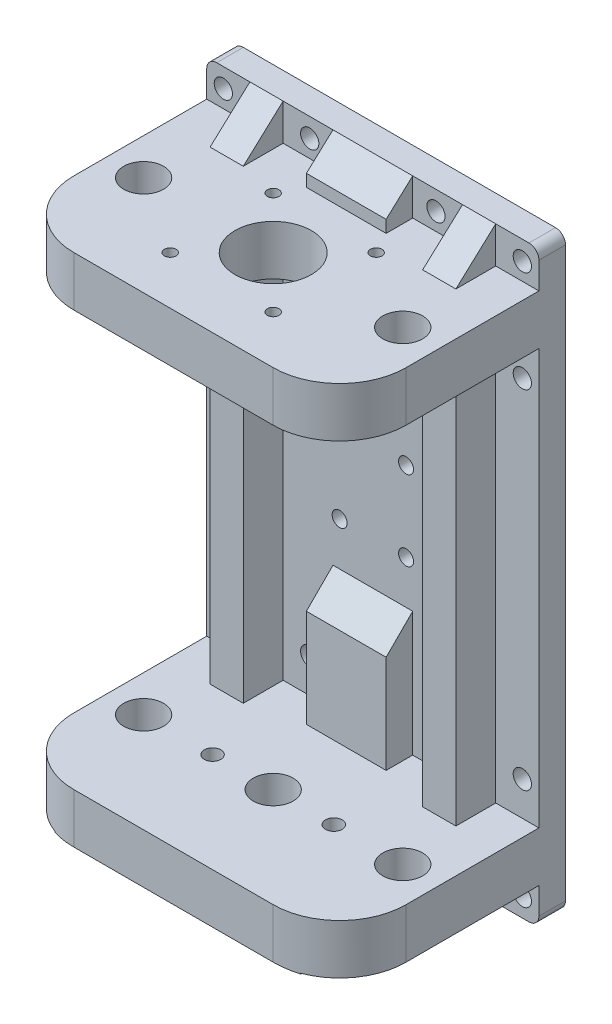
ISO-10303-21;
HEADER;
FILE_DESCRIPTION(('STEP AP214'),'2;1');
FILE_NAME('part.step','',(''),(''),'','','');
FILE_SCHEMA(('AUTOMOTIVE_DESIGN { 1 0 10303 214 1 1 1 1 }'));
ENDSEC;
DATA;
#1=APPLICATION_CONTEXT('core data for automotive mechanical design processes');
#2=APPLICATION_PROTOCOL_DEFINITION('international standard','automotive_design',2000,#1);
#3=PRODUCT_CONTEXT('',#1,'mechanical');
#4=PRODUCT('Part','Part','',(#3));
#5=PRODUCT_RELATED_PRODUCT_CATEGORY('part','',(#4));
#6=PRODUCT_DEFINITION_FORMATION('','',#4);
#7=PRODUCT_DEFINITION_CONTEXT('part definition',#1,'design');
#8=PRODUCT_DEFINITION('design','',#6,#7);
#9=PRODUCT_DEFINITION_SHAPE('','',#8);
#10=(LENGTH_UNIT() NAMED_UNIT(*) SI_UNIT(.MILLI.,.METRE.));
#11=(NAMED_UNIT(*) PLANE_ANGLE_UNIT() SI_UNIT($,.RADIAN.));
#12=(NAMED_UNIT(*) SI_UNIT($,.STERADIAN.) SOLID_ANGLE_UNIT());
#13=UNCERTAINTY_MEASURE_WITH_UNIT(LENGTH_MEASURE(1.E-05),#10,'distance_accuracy_value','');
#14=(GEOMETRIC_REPRESENTATION_CONTEXT(3) GLOBAL_UNCERTAINTY_ASSIGNED_CONTEXT((#13)) GLOBAL_UNIT_ASSIGNED_CONTEXT((#10,
#11,#12)) REPRESENTATION_CONTEXT('',''));
#15=CARTESIAN_POINT('',(0.,0.,0.));
#16=DIRECTION('',(0.,0.,1.));
#17=DIRECTION('',(1.,0.,0.));
#18=AXIS2_PLACEMENT_3D('',#15,#16,#17);
#19=CARTESIAN_POINT('',(-577.553130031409,317.749005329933,53.4999999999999));
#20=DIRECTION('',(0.,1.,0.));
#21=DIRECTION('',(0.,0.,1.));
#22=AXIS2_PLACEMENT_3D('',#19,#20,#21);
#23=CYLINDRICAL_SURFACE('',#22,1.74999999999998);
#24=CARTESIAN_POINT('',(-577.553130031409,332.749005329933,53.4999999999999));
#25=DIRECTION('',(0.,1.,0.));
#26=DIRECTION('',(0.,0.,1.));
#27=AXIS2_PLACEMENT_3D('',#24,#25,#26);
#28=CIRCLE('',#27,1.74999999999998);
#29=CARTESIAN_POINT('',(-577.553130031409,332.749005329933,55.2499999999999));
#30=VERTEX_POINT('',#29);
#31=EDGE_CURVE('E770',#30,#30,#28,.T.);
#32=ORIENTED_EDGE('',*,*,#31,.T.);
#33=EDGE_LOOP('',(#32));
#34=FACE_BOUND('',#33,.T.);
#35=CARTESIAN_POINT('',(-577.553130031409,327.749005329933,53.4999999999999));
#36=DIRECTION('',(0.,-1.,0.));
#37=DIRECTION('',(0.,0.,-1.));
#38=AXIS2_PLACEMENT_3D('',#35,#36,#37);
#39=CIRCLE('',#38,1.74999999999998);
#40=CARTESIAN_POINT('',(-577.553130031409,327.749005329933,51.75));
#41=VERTEX_POINT('',#40);
#42=EDGE_CURVE('E51',#41,#41,#39,.F.);
#43=ORIENTED_EDGE('',*,*,#42,.F.);
#44=EDGE_LOOP('',(#43));
#45=FACE_BOUND('',#44,.T.);
#46=ADVANCED_FACE('F47',(#34,#45),#23,.F.);
#47=CARTESIAN_POINT('',(-608.553130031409,317.749005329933,53.5000000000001));
#48=DIRECTION('',(0.,1.,0.));
#49=DIRECTION('',(0.,0.,1.));
#50=AXIS2_PLACEMENT_3D('',#47,#48,#49);
#51=CYLINDRICAL_SURFACE('',#50,1.74999999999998);
#52=CARTESIAN_POINT('',(-608.553130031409,332.749005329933,53.5000000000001));
#53=DIRECTION('',(0.,1.,0.));
#54=DIRECTION('',(0.,0.,1.));
#55=AXIS2_PLACEMENT_3D('',#52,#53,#54);
#56=CIRCLE('',#55,1.74999999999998);
#57=CARTESIAN_POINT('',(-608.553130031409,332.749005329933,55.25));
#58=VERTEX_POINT('',#57);
#59=EDGE_CURVE('E771',#58,#58,#56,.T.);
#60=ORIENTED_EDGE('',*,*,#59,.T.);
#61=EDGE_LOOP('',(#60));
#62=FACE_BOUND('',#61,.T.);
#63=CARTESIAN_POINT('',(-608.553130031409,327.749005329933,53.5000000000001));
#64=DIRECTION('',(0.,-1.,0.));
#65=DIRECTION('',(0.,0.,-1.));
#66=AXIS2_PLACEMENT_3D('',#63,#64,#65);
#67=CIRCLE('',#66,1.74999999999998);
#68=CARTESIAN_POINT('',(-608.553130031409,327.749005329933,51.7500000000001));
#69=VERTEX_POINT('',#68);
#70=EDGE_CURVE('E742',#69,#69,#67,.F.);
#71=ORIENTED_EDGE('',*,*,#70,.F.);
#72=EDGE_LOOP('',(#71));
#73=FACE_BOUND('',#72,.T.);
#74=ADVANCED_FACE('F1484',(#62,#73),#51,.F.);
#75=CARTESIAN_POINT('',(-577.553130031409,317.749005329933,22.4999999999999));
#76=DIRECTION('',(0.,1.,0.));
#77=DIRECTION('',(0.,0.,1.));
#78=AXIS2_PLACEMENT_3D('',#75,#76,#77);
#79=CYLINDRICAL_SURFACE('',#78,1.74999999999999);
#80=CARTESIAN_POINT('',(-577.553130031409,332.749005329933,22.4999999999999));
#81=DIRECTION('',(0.,1.,0.));
#82=DIRECTION('',(0.,0.,1.));
#83=AXIS2_PLACEMENT_3D('',#80,#81,#82);
#84=CIRCLE('',#83,1.74999999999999);
#85=CARTESIAN_POINT('',(-577.553130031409,332.749005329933,24.2499999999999));
#86=VERTEX_POINT('',#85);
#87=EDGE_CURVE('E766',#86,#86,#84,.T.);
#88=ORIENTED_EDGE('',*,*,#87,.T.);
#89=EDGE_LOOP('',(#88));
#90=FACE_BOUND('',#89,.T.);
#91=CARTESIAN_POINT('',(-577.553130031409,327.749005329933,22.4999999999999));
#92=DIRECTION('',(0.,-1.,0.));
#93=DIRECTION('',(0.,0.,-1.));
#94=AXIS2_PLACEMENT_3D('',#91,#92,#93);
#95=CIRCLE('',#94,1.74999999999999);
#96=CARTESIAN_POINT('',(-577.553130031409,327.749005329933,20.75));
#97=VERTEX_POINT('',#96);
#98=EDGE_CURVE('E739',#97,#97,#95,.F.);
#99=ORIENTED_EDGE('',*,*,#98,.F.);
#100=EDGE_LOOP('',(#99));
#101=FACE_BOUND('',#100,.T.);
#102=ADVANCED_FACE('F1490',(#90,#101),#79,.F.);
#103=CARTESIAN_POINT('',(-608.553130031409,317.749005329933,22.5000000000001));
#104=DIRECTION('',(0.,1.,0.));
#105=DIRECTION('',(0.,0.,1.));
#106=AXIS2_PLACEMENT_3D('',#103,#104,#105);
#107=CYLINDRICAL_SURFACE('',#106,1.74999999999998);
#108=CARTESIAN_POINT('',(-608.553130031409,332.749005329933,22.5000000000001));
#109=DIRECTION('',(0.,1.,0.));
#110=DIRECTION('',(0.,0.,1.));
#111=AXIS2_PLACEMENT_3D('',#108,#109,#110);
#112=CIRCLE('',#111,1.74999999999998);
#113=CARTESIAN_POINT('',(-608.553130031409,332.749005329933,24.2500000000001));
#114=VERTEX_POINT('',#113);
#115=EDGE_CURVE('E737',#114,#114,#112,.T.);
#116=ORIENTED_EDGE('',*,*,#115,.T.);
#117=EDGE_LOOP('',(#116));
#118=FACE_BOUND('',#117,.T.);
#119=CARTESIAN_POINT('',(-608.553130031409,327.749005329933,22.5000000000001));
#120=DIRECTION('',(0.,-1.,0.));
#121=DIRECTION('',(0.,0.,-1.));
#122=AXIS2_PLACEMENT_3D('',#119,#120,#121);
#123=CIRCLE('',#122,1.74999999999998);
#124=CARTESIAN_POINT('',(-608.553130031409,327.749005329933,20.7500000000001));
#125=VERTEX_POINT('',#124);
#126=EDGE_CURVE('E733',#125,#125,#123,.F.);
#127=ORIENTED_EDGE('',*,*,#126,.F.);
#128=EDGE_LOOP('',(#127));
#129=FACE_BOUND('',#128,.T.);
#130=ADVANCED_FACE('F1496',(#118,#129),#107,.F.);
#131=CARTESIAN_POINT('',(-643.053130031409,177.749005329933,68.));
#132=DIRECTION('',(0.,1.,0.));
#133=DIRECTION('',(0.,0.,1.));
#134=AXIS2_PLACEMENT_3D('',#131,#132,#133);
#135=PLANE('',#134);
#136=DIRECTION('',(0.5,0.,-0.866025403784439));
#137=VECTOR('',#136,1.);
#138=CARTESIAN_POINT('',(-580.8653078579,177.749005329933,37.9999999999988));
#139=LINE('',#138,#137);
#140=CARTESIAN_POINT('',(-580.8653078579,177.749005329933,37.9999999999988));
#141=VERTEX_POINT('',#140);
#142=CARTESIAN_POINT('',(-577.834218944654,177.749005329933,32.7499999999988));
#143=VERTEX_POINT('',#142);
#144=EDGE_CURVE('E1042',#141,#143,#139,.T.);
#145=ORIENTED_EDGE('',*,*,#144,.F.);
#146=DIRECTION('',(-0.49999999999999,0.,-0.866025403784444));
#147=VECTOR('',#146,1.);
#148=CARTESIAN_POINT('',(-577.834218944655,177.749005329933,43.2499999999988));
#149=LINE('',#148,#147);
#150=CARTESIAN_POINT('',(-577.834218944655,177.749005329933,43.2499999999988));
#151=VERTEX_POINT('',#150);
#152=EDGE_CURVE('E1013',#151,#141,#149,.T.);
#153=ORIENTED_EDGE('',*,*,#152,.F.);
#154=DIRECTION('',(-1.,0.,0.));
#155=VECTOR('',#154,1.);
#156=CARTESIAN_POINT('',(-571.772041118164,177.749005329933,43.2499999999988));
#157=LINE('',#156,#155);
#158=CARTESIAN_POINT('',(-571.772041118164,177.749005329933,43.2499999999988));
#159=VERTEX_POINT('',#158);
#160=EDGE_CURVE('E1019',#159,#151,#157,.T.);
#161=ORIENTED_EDGE('',*,*,#160,.F.);
#162=DIRECTION('',(-0.499999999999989,0.,0.866025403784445));
#163=VECTOR('',#162,1.);
#164=CARTESIAN_POINT('',(-568.740952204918,177.749005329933,37.9999999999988));
#165=LINE('',#164,#163);
#166=CARTESIAN_POINT('',(-568.740952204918,177.749005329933,37.9999999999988));
#167=VERTEX_POINT('',#166);
#168=EDGE_CURVE('E1054',#167,#159,#165,.T.);
#169=ORIENTED_EDGE('',*,*,#168,.F.);
#170=DIRECTION('',(0.500000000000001,0.,0.866025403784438));
#171=VECTOR('',#170,1.);
#172=CARTESIAN_POINT('',(-571.772041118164,177.749005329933,32.7499999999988));
#173=LINE('',#172,#171);
#174=CARTESIAN_POINT('',(-571.772041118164,177.749005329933,32.7499999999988));
#175=VERTEX_POINT('',#174);
#176=EDGE_CURVE('E1050',#175,#167,#173,.T.);
#177=ORIENTED_EDGE('',*,*,#176,.F.);
#178=DIRECTION('',(1.,0.,0.));
#179=VECTOR('',#178,1.);
#180=CARTESIAN_POINT('',(-577.834218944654,177.749005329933,32.7499999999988));
#181=LINE('',#180,#179);
#182=EDGE_CURVE('E1046',#143,#175,#181,.T.);
#183=ORIENTED_EDGE('',*,*,#182,.F.);
#184=EDGE_LOOP('',(#145,#153,#161,#169,#177,#183));
#185=FACE_BOUND('',#184,.T.);
#186=DIRECTION('',(0.499999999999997,0.,-0.86602540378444));
#187=VECTOR('',#186,1.);
#188=CARTESIAN_POINT('',(-617.3653078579,177.749005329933,37.9999999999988));
#189=LINE('',#188,#187);
#190=CARTESIAN_POINT('',(-617.3653078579,177.749005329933,37.9999999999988));
#191=VERTEX_POINT('',#190);
#192=CARTESIAN_POINT('',(-614.334218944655,177.749005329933,32.7499999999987));
#193=VERTEX_POINT('',#192);
#194=EDGE_CURVE('E1108',#191,#193,#189,.T.);
#195=ORIENTED_EDGE('',*,*,#194,.F.);
#196=DIRECTION('',(-0.499999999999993,0.,-0.866025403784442));
#197=VECTOR('',#196,1.);
#198=CARTESIAN_POINT('',(-614.334218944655,177.749005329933,43.2499999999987));
#199=LINE('',#198,#197);
#200=CARTESIAN_POINT('',(-614.334218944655,177.749005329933,43.2499999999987));
#201=VERTEX_POINT('',#200);
#202=EDGE_CURVE('E1105',#201,#191,#199,.T.);
#203=ORIENTED_EDGE('',*,*,#202,.F.);
#204=DIRECTION('',(-1.,0.,0.));
#205=VECTOR('',#204,1.);
#206=CARTESIAN_POINT('',(-608.272041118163,177.749005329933,43.2499999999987));
#207=LINE('',#206,#205);
#208=CARTESIAN_POINT('',(-608.272041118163,177.749005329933,43.2499999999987));
#209=VERTEX_POINT('',#208);
#210=EDGE_CURVE('E1084',#209,#201,#207,.T.);
#211=ORIENTED_EDGE('',*,*,#210,.F.);
#212=DIRECTION('',(-0.499999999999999,0.,0.866025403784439));
#213=VECTOR('',#212,1.);
#214=CARTESIAN_POINT('',(-605.240952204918,177.749005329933,37.9999999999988));
#215=LINE('',#214,#213);
#216=CARTESIAN_POINT('',(-605.240952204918,177.749005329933,37.9999999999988));
#217=VERTEX_POINT('',#216);
#218=EDGE_CURVE('E1120',#217,#209,#215,.T.);
#219=ORIENTED_EDGE('',*,*,#218,.F.);
#220=DIRECTION('',(0.500000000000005,0.,0.866025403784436));
#221=VECTOR('',#220,1.);
#222=CARTESIAN_POINT('',(-608.272041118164,177.749005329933,32.7499999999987));
#223=LINE('',#222,#221);
#224=CARTESIAN_POINT('',(-608.272041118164,177.749005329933,32.7499999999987));
#225=VERTEX_POINT('',#224);
#226=EDGE_CURVE('E1116',#225,#217,#223,.T.);
#227=ORIENTED_EDGE('',*,*,#226,.F.);
#228=DIRECTION('',(1.,0.,0.));
#229=VECTOR('',#228,1.);
#230=CARTESIAN_POINT('',(-614.334218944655,177.749005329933,32.7499999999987));
#231=LINE('',#230,#229);
#232=EDGE_CURVE('E1112',#193,#225,#231,.T.);
#233=ORIENTED_EDGE('',*,*,#232,.F.);
#234=EDGE_LOOP('',(#195,#203,#211,#219,#227,#233));
#235=FACE_BOUND('',#234,.T.);
#236=CARTESIAN_POINT('',(-593.053130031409,177.749005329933,37.9999999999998));
#237=DIRECTION('',(0.,1.,0.));
#238=DIRECTION('',(0.,0.,1.));
#239=AXIS2_PLACEMENT_3D('',#236,#237,#238);
#240=CIRCLE('',#239,5.99999999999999);
#241=CARTESIAN_POINT('',(-593.053130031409,177.749005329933,43.9999999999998));
#242=VERTEX_POINT('',#241);
#243=EDGE_CURVE('E1150',#242,#242,#240,.T.);
#244=ORIENTED_EDGE('',*,*,#243,.T.);
#245=EDGE_LOOP('',(#244));
#246=FACE_BOUND('',#245,.T.);
#247=DIRECTION('',(1.,0.,0.));
#248=VECTOR('',#247,1.);
#249=CARTESIAN_POINT('',(-643.053130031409,177.749005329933,68.));
#250=LINE('',#249,#248);
#251=CARTESIAN_POINT('',(-620.053130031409,177.749005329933,68.));
#252=VERTEX_POINT('',#251);
#253=CARTESIAN_POINT('',(-566.053130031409,177.749005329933,68.));
#254=VERTEX_POINT('',#253);
#255=EDGE_CURVE('E1203',#252,#254,#250,.T.);
#256=ORIENTED_EDGE('',*,*,#255,.F.);
#257=DIRECTION('',(0.,0.,-1.));
#258=VECTOR('',#257,1.);
#259=CARTESIAN_POINT('',(-620.053130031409,177.749005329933,68.));
#260=LINE('',#259,#258);
#261=CARTESIAN_POINT('',(-620.053130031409,177.749005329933,8.));
#262=VERTEX_POINT('',#261);
#263=EDGE_CURVE('E941',#252,#262,#260,.T.);
#264=ORIENTED_EDGE('',*,*,#263,.T.);
#265=DIRECTION('',(1.,0.,0.));
#266=VECTOR('',#265,1.);
#267=CARTESIAN_POINT('',(-643.053130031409,177.749005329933,8.));
#268=LINE('',#267,#266);
#269=CARTESIAN_POINT('',(-605.053130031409,177.749005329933,8.00000000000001));
#270=VERTEX_POINT('',#269);
#271=EDGE_CURVE('E1216',#262,#270,#268,.T.);
#272=ORIENTED_EDGE('',*,*,#271,.T.);
#273=DIRECTION('',(0.,0.,1.));
#274=VECTOR('',#273,1.);
#275=CARTESIAN_POINT('',(-605.05313003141,177.749005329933,68.0000000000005));
#276=LINE('',#275,#274);
#277=CARTESIAN_POINT('',(-605.053130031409,177.749005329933,16.));
#278=VERTEX_POINT('',#277);
#279=EDGE_CURVE('E957',#270,#278,#276,.T.);
#280=ORIENTED_EDGE('',*,*,#279,.T.);
#281=DIRECTION('',(1.,0.,0.));
#282=VECTOR('',#281,1.);
#283=CARTESIAN_POINT('',(-643.053130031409,177.749005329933,16.));
#284=LINE('',#283,#282);
#285=CARTESIAN_POINT('',(-581.053130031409,177.749005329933,16.));
#286=VERTEX_POINT('',#285);
#287=EDGE_CURVE('E989',#278,#286,#284,.T.);
#288=ORIENTED_EDGE('',*,*,#287,.T.);
#289=DIRECTION('',(0.,0.,-1.));
#290=VECTOR('',#289,1.);
#291=CARTESIAN_POINT('',(-581.053130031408,177.749005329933,67.9999999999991));
#292=LINE('',#291,#290);
#293=CARTESIAN_POINT('',(-581.053130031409,177.749005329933,8.));
#294=VERTEX_POINT('',#293);
#295=EDGE_CURVE('E1001',#286,#294,#292,.T.);
#296=ORIENTED_EDGE('',*,*,#295,.T.);
#297=CARTESIAN_POINT('',(-566.053130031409,177.749005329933,8.));
#298=VERTEX_POINT('',#297);
#299=EDGE_CURVE('E1217',#294,#298,#268,.T.);
#300=ORIENTED_EDGE('',*,*,#299,.T.);
#301=DIRECTION('',(0.,0.,1.));
#302=VECTOR('',#301,1.);
#303=CARTESIAN_POINT('',(-566.053130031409,177.749005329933,68.));
#304=LINE('',#303,#302);
#305=EDGE_CURVE('E513',#298,#254,#304,.T.);
#306=ORIENTED_EDGE('',*,*,#305,.T.);
#307=EDGE_LOOP('',(#256,#264,#272,#280,#288,#296,#300,#306));
#308=FACE_BOUND('',#307,.T.);
#309=ADVANCED_FACE('F1630',(#185,#235,#246,#308),#135,.F.);
#310=DIRECTION('',(0.,0.,1.));
#311=VECTOR('',#310,1.);
#312=CARTESIAN_POINT('',(-630.053130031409,177.749005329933,68.));
#313=LINE('',#312,#311);
#314=CARTESIAN_POINT('',(-630.053130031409,177.749005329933,8.));
#315=VERTEX_POINT('',#314);
#316=CARTESIAN_POINT('',(-630.053130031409,177.749005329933,66.7349939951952));
#317=VERTEX_POINT('',#316);
#318=EDGE_CURVE('E908',#315,#317,#313,.T.);
#319=ORIENTED_EDGE('',*,*,#318,.T.);
#320=CARTESIAN_POINT('',(-623.053130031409,177.749005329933,48.));
#321=DIRECTION('',(0.,1.,0.));
#322=DIRECTION('',(0.,0.,1.));
#323=AXIS2_PLACEMENT_3D('',#320,#321,#322);
#324=CIRCLE('',#323,20.);
#325=CARTESIAN_POINT('',(-643.053130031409,177.749005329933,48.));
#326=VERTEX_POINT('',#325);
#327=EDGE_CURVE('E603',#317,#326,#324,.F.);
#328=ORIENTED_EDGE('',*,*,#327,.T.);
#329=DIRECTION('',(0.,0.,-1.));
#330=VECTOR('',#329,1.);
#331=CARTESIAN_POINT('',(-643.053130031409,177.749005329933,68.));
#332=LINE('',#331,#330);
#333=CARTESIAN_POINT('',(-643.053130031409,177.749005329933,8.));
#334=VERTEX_POINT('',#333);
#335=EDGE_CURVE('E1233',#326,#334,#332,.T.);
#336=ORIENTED_EDGE('',*,*,#335,.T.);
#337=EDGE_CURVE('E1211',#334,#315,#268,.T.);
#338=ORIENTED_EDGE('',*,*,#337,.T.);
#339=EDGE_LOOP('',(#319,#328,#336,#338));
#340=FACE_BOUND('',#339,.T.);
#341=ADVANCED_FACE('F1639',(#340),#135,.F.);
#342=CARTESIAN_POINT('',(-563.053130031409,177.749005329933,48.));
#343=DIRECTION('',(0.,1.,0.));
#344=DIRECTION('',(0.,0.,1.));
#345=AXIS2_PLACEMENT_3D('',#342,#343,#344);
#346=CIRCLE('',#345,20.);
#347=CARTESIAN_POINT('',(-543.053130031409,177.749005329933,48.));
#348=VERTEX_POINT('',#347);
#349=CARTESIAN_POINT('',(-556.053130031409,177.749005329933,66.7349939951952));
#350=VERTEX_POINT('',#349);
#351=EDGE_CURVE('E594',#348,#350,#346,.F.);
#352=ORIENTED_EDGE('',*,*,#351,.T.);
#353=DIRECTION('',(0.,0.,-1.));
#354=VECTOR('',#353,1.);
#355=CARTESIAN_POINT('',(-556.053130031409,177.749005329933,68.));
#356=LINE('',#355,#354);
#357=CARTESIAN_POINT('',(-556.053130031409,177.749005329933,8.));
#358=VERTEX_POINT('',#357);
#359=EDGE_CURVE('E891',#350,#358,#356,.T.);
#360=ORIENTED_EDGE('',*,*,#359,.T.);
#361=CARTESIAN_POINT('',(-543.053130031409,177.749005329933,8.));
#362=VERTEX_POINT('',#361);
#363=EDGE_CURVE('E1202',#358,#362,#268,.T.);
#364=ORIENTED_EDGE('',*,*,#363,.T.);
#365=DIRECTION('',(0.,0.,-1.));
#366=VECTOR('',#365,1.);
#367=CARTESIAN_POINT('',(-543.053130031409,177.749005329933,68.));
#368=LINE('',#367,#366);
#369=EDGE_CURVE('E1229',#348,#362,#368,.T.);
#370=ORIENTED_EDGE('',*,*,#369,.F.);
#371=EDGE_LOOP('',(#352,#360,#364,#370));
#372=FACE_BOUND('',#371,.T.);
#373=ADVANCED_FACE('F1642',(#372),#135,.F.);
#374=CARTESIAN_POINT('',(-605.053130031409,141.450784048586,8.00000000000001));
#375=DIRECTION('',(-1.,0.,0.));
#376=DIRECTION('',(0.,0.,1.));
#377=AXIS2_PLACEMENT_3D('',#374,#375,#376);
#378=PLANE('',#377);
#379=DIRECTION('',(0.,-0.707106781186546,-0.707106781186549));
#380=VECTOR('',#379,1.);
#381=CARTESIAN_POINT('',(-605.053130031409,292.249005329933,20.0000000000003));
#382=LINE('',#381,#380);
#383=CARTESIAN_POINT('',(-605.053130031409,288.249005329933,15.9999999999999));
#384=VERTEX_POINT('',#383);
#385=CARTESIAN_POINT('',(-605.053130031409,280.249005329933,8.00000000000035));
#386=VERTEX_POINT('',#385);
#387=EDGE_CURVE('E811',#384,#386,#382,.T.);
#388=ORIENTED_EDGE('',*,*,#387,.F.);
#389=DIRECTION('',(0.,1.,0.));
#390=VECTOR('',#389,1.);
#391=CARTESIAN_POINT('',(-605.053130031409,141.450784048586,16.));
#392=LINE('',#391,#390);
#393=CARTESIAN_POINT('',(-605.053130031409,317.749005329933,16.));
#394=VERTEX_POINT('',#393);
#395=EDGE_CURVE('E965',#384,#394,#392,.T.);
#396=ORIENTED_EDGE('',*,*,#395,.T.);
#397=DIRECTION('',(0.,0.,1.));
#398=VECTOR('',#397,1.);
#399=CARTESIAN_POINT('',(-605.05313003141,317.749005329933,68.0000000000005));
#400=LINE('',#399,#398);
#401=CARTESIAN_POINT('',(-605.053130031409,317.749005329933,8.00000000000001));
#402=VERTEX_POINT('',#401);
#403=EDGE_CURVE('E985',#402,#394,#400,.T.);
#404=ORIENTED_EDGE('',*,*,#403,.F.);
#405=DIRECTION('',(0.,1.,0.));
#406=VECTOR('',#405,1.);
#407=CARTESIAN_POINT('',(-605.053130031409,141.450784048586,8.00000000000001));
#408=LINE('',#407,#406);
#409=EDGE_CURVE('E972',#386,#402,#408,.T.);
#410=ORIENTED_EDGE('',*,*,#409,.F.);
#411=EDGE_LOOP('',(#388,#396,#404,#410));
#412=FACE_BOUND('',#411,.T.);
#413=ADVANCED_FACE('F1559',(#412),#378,.T.);
#414=CARTESIAN_POINT('',(-581.053130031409,141.450784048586,16.));
#415=DIRECTION('',(0.,0.,1.));
#416=DIRECTION('',(1.,0.,0.));
#417=AXIS2_PLACEMENT_3D('',#414,#415,#416);
#418=PLANE('',#417);
#419=DIRECTION('',(-1.,0.,0.));
#420=VECTOR('',#419,1.);
#421=CARTESIAN_POINT('',(-581.053130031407,288.249005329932,16.));
#422=LINE('',#421,#420);
#423=CARTESIAN_POINT('',(-581.053130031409,288.249005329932,16.));
#424=VERTEX_POINT('',#423);
#425=EDGE_CURVE('E835',#424,#384,#422,.T.);
#426=ORIENTED_EDGE('',*,*,#425,.F.);
#427=DIRECTION('',(0.,1.,0.));
#428=VECTOR('',#427,1.);
#429=CARTESIAN_POINT('',(-581.053130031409,141.450784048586,16.));
#430=LINE('',#429,#428);
#431=CARTESIAN_POINT('',(-581.053130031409,317.749005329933,16.));
#432=VERTEX_POINT('',#431);
#433=EDGE_CURVE('E959',#424,#432,#430,.T.);
#434=ORIENTED_EDGE('',*,*,#433,.T.);
#435=DIRECTION('',(1.,0.,0.));
#436=VECTOR('',#435,1.);
#437=CARTESIAN_POINT('',(-643.053130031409,317.749005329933,16.));
#438=LINE('',#437,#436);
#439=EDGE_CURVE('E997',#394,#432,#438,.T.);
#440=ORIENTED_EDGE('',*,*,#439,.F.);
#441=ORIENTED_EDGE('',*,*,#395,.F.);
#442=EDGE_LOOP('',(#426,#434,#440,#441));
#443=FACE_BOUND('',#442,.T.);
#444=ADVANCED_FACE('F1553',(#443),#418,.T.);
#445=CARTESIAN_POINT('',(-581.053130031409,141.450784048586,8.));
#446=DIRECTION('',(1.,0.,0.));
#447=DIRECTION('',(0.,0.,-1.));
#448=AXIS2_PLACEMENT_3D('',#445,#446,#447);
#449=PLANE('',#448);
#450=DIRECTION('',(0.,-0.707106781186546,-0.707106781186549));
#451=VECTOR('',#450,1.);
#452=CARTESIAN_POINT('',(-581.053130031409,292.249005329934,20.0000000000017));
#453=LINE('',#452,#451);
#454=CARTESIAN_POINT('',(-581.053130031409,280.249005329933,8.00000000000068));
#455=VERTEX_POINT('',#454);
#456=EDGE_CURVE('E815',#424,#455,#453,.T.);
#457=ORIENTED_EDGE('',*,*,#456,.T.);
#458=DIRECTION('',(0.,1.,0.));
#459=VECTOR('',#458,1.);
#460=CARTESIAN_POINT('',(-581.053130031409,141.450784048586,8.));
#461=LINE('',#460,#459);
#462=CARTESIAN_POINT('',(-581.053130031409,317.749005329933,8.));
#463=VERTEX_POINT('',#462);
#464=EDGE_CURVE('E977',#455,#463,#461,.T.);
#465=ORIENTED_EDGE('',*,*,#464,.T.);
#466=DIRECTION('',(0.,0.,-1.));
#467=VECTOR('',#466,1.);
#468=CARTESIAN_POINT('',(-581.053130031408,317.749005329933,67.9999999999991));
#469=LINE('',#468,#467);
#470=EDGE_CURVE('E1009',#432,#463,#469,.T.);
#471=ORIENTED_EDGE('',*,*,#470,.F.);
#472=ORIENTED_EDGE('',*,*,#433,.F.);
#473=EDGE_LOOP('',(#457,#465,#471,#472));
#474=FACE_BOUND('',#473,.T.);
#475=ADVANCED_FACE('F1564',(#474),#449,.T.);
#476=CARTESIAN_POINT('',(0.,0.,8.));
#477=DIRECTION('',(0.,0.,1.));
#478=DIRECTION('',(1.,0.,0.));
#479=AXIS2_PLACEMENT_3D('',#476,#477,#478);
#480=PLANE('',#479);
#481=DIRECTION('',(1.,0.,0.));
#482=VECTOR('',#481,1.);
#483=CARTESIAN_POINT('',(-643.053130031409,166.749005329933,8.));
#484=LINE('',#483,#482);
#485=CARTESIAN_POINT('',(-556.053130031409,166.749005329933,8.));
#486=VERTEX_POINT('',#485);
#487=CARTESIAN_POINT('',(-546.053130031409,166.749005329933,8.));
#488=VERTEX_POINT('',#487);
#489=EDGE_CURVE('E504',#486,#488,#484,.T.);
#490=ORIENTED_EDGE('',*,*,#489,.T.);
#491=CARTESIAN_POINT('',(-546.053130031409,169.749005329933,8.));
#492=DIRECTION('',(0.,0.,1.));
#493=DIRECTION('',(1.,0.,0.));
#494=AXIS2_PLACEMENT_3D('',#491,#492,#493);
#495=CIRCLE('',#494,3.);
#496=CARTESIAN_POINT('',(-543.053130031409,169.749005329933,8.));
#497=VERTEX_POINT('',#496);
#498=EDGE_CURVE('E712',#488,#497,#495,.T.);
#499=ORIENTED_EDGE('',*,*,#498,.T.);
#500=DIRECTION('',(0.,1.,0.));
#501=VECTOR('',#500,1.);
#502=CARTESIAN_POINT('',(-543.053130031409,343.749005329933,8.));
#503=LINE('',#502,#501);
#504=EDGE_CURVE('E546',#497,#362,#503,.T.);
#505=ORIENTED_EDGE('',*,*,#504,.T.);
#506=ORIENTED_EDGE('',*,*,#363,.F.);
#507=DIRECTION('',(0.,1.,0.));
#508=VECTOR('',#507,1.);
#509=CARTESIAN_POINT('',(-556.053130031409,141.450784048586,8.));
#510=LINE('',#509,#508);
#511=EDGE_CURVE('E869',#486,#358,#510,.T.);
#512=ORIENTED_EDGE('',*,*,#511,.F.);
#513=EDGE_LOOP('',(#490,#499,#505,#506,#512));
#514=FACE_BOUND('',#513,.T.);
#515=CARTESIAN_POINT('',(-548.053130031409,172.499005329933,8.));
#516=DIRECTION('',(0.,0.,1.));
#517=DIRECTION('',(1.,0.,0.));
#518=AXIS2_PLACEMENT_3D('',#515,#516,#517);
#519=CIRCLE('',#518,2.75000000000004);
#520=CARTESIAN_POINT('',(-545.303130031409,172.499005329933,8.));
#521=VERTEX_POINT('',#520);
#522=EDGE_CURVE('E1273',#521,#521,#519,.T.);
#523=ORIENTED_EDGE('',*,*,#522,.F.);
#524=EDGE_LOOP('',(#523));
#525=FACE_BOUND('',#524,.T.);
#526=ADVANCED_FACE('F1476',(#514,#525),#480,.T.);
#527=CARTESIAN_POINT('',(-556.053130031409,192.749005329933,8.));
#528=VERTEX_POINT('',#527);
#529=CARTESIAN_POINT('',(-556.053130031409,317.749005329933,8.));
#530=VERTEX_POINT('',#529);
#531=EDGE_CURVE('E872',#528,#530,#510,.T.);
#532=ORIENTED_EDGE('',*,*,#531,.F.);
#533=DIRECTION('',(-1.,0.,0.));
#534=VECTOR('',#533,1.);
#535=CARTESIAN_POINT('',(-643.053130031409,192.749005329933,8.));
#536=LINE('',#535,#534);
#537=CARTESIAN_POINT('',(-543.053130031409,192.749005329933,8.));
#538=VERTEX_POINT('',#537);
#539=EDGE_CURVE('E1207',#538,#528,#536,.T.);
#540=ORIENTED_EDGE('',*,*,#539,.F.);
#541=CARTESIAN_POINT('',(-543.053130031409,317.749005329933,8.));
#542=VERTEX_POINT('',#541);
#543=EDGE_CURVE('E545',#538,#542,#503,.T.);
#544=ORIENTED_EDGE('',*,*,#543,.T.);
#545=DIRECTION('',(1.,0.,0.));
#546=VECTOR('',#545,1.);
#547=CARTESIAN_POINT('',(-643.053130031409,317.749005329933,8.));
#548=LINE('',#547,#546);
#549=EDGE_CURVE('E1236',#530,#542,#548,.T.);
#550=ORIENTED_EDGE('',*,*,#549,.F.);
#551=EDGE_LOOP('',(#532,#540,#544,#550));
#552=FACE_BOUND('',#551,.T.);
#553=CARTESIAN_POINT('',(-548.053130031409,202.999005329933,8.));
#554=DIRECTION('',(0.,0.,1.));
#555=DIRECTION('',(1.,0.,0.));
#556=AXIS2_PLACEMENT_3D('',#553,#554,#555);
#557=CIRCLE('',#556,2.75000000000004);
#558=CARTESIAN_POINT('',(-545.303130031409,202.999005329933,8.));
#559=VERTEX_POINT('',#558);
#560=EDGE_CURVE('E1305',#559,#559,#557,.T.);
#561=ORIENTED_EDGE('',*,*,#560,.F.);
#562=EDGE_LOOP('',(#561));
#563=FACE_BOUND('',#562,.T.);
#564=CARTESIAN_POINT('',(-548.053130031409,307.499005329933,8.));
#565=DIRECTION('',(0.,0.,1.));
#566=DIRECTION('',(1.,0.,0.));
#567=AXIS2_PLACEMENT_3D('',#564,#565,#566);
#568=CIRCLE('',#567,2.75000000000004);
#569=CARTESIAN_POINT('',(-545.303130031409,307.499005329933,8.));
#570=VERTEX_POINT('',#569);
#571=EDGE_CURVE('E1377',#570,#570,#568,.T.);
#572=ORIENTED_EDGE('',*,*,#571,.F.);
#573=EDGE_LOOP('',(#572));
#574=FACE_BOUND('',#573,.T.);
#575=ADVANCED_FACE('F2327',(#552,#563,#574),#480,.T.);
#576=CARTESIAN_POINT('',(-543.053130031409,332.749005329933,8.));
#577=VERTEX_POINT('',#576);
#578=CARTESIAN_POINT('',(-543.053130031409,340.749005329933,8.));
#579=VERTEX_POINT('',#578);
#580=EDGE_CURVE('E538',#577,#579,#503,.T.);
#581=ORIENTED_EDGE('',*,*,#580,.T.);
#582=CARTESIAN_POINT('',(-546.053130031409,340.749005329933,8.));
#583=DIRECTION('',(0.,0.,1.));
#584=DIRECTION('',(1.,0.,0.));
#585=AXIS2_PLACEMENT_3D('',#582,#583,#584);
#586=CIRCLE('',#585,3.);
#587=CARTESIAN_POINT('',(-546.053130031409,343.749005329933,8.));
#588=VERTEX_POINT('',#587);
#589=EDGE_CURVE('E57',#579,#588,#586,.T.);
#590=ORIENTED_EDGE('',*,*,#589,.T.);
#591=DIRECTION('',(-1.,0.,0.));
#592=VECTOR('',#591,1.);
#593=CARTESIAN_POINT('',(-643.053130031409,343.749005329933,8.));
#594=LINE('',#593,#592);
#595=CARTESIAN_POINT('',(-556.053130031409,343.749005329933,8.));
#596=VERTEX_POINT('',#595);
#597=EDGE_CURVE('E569',#588,#596,#594,.T.);
#598=ORIENTED_EDGE('',*,*,#597,.T.);
#599=CARTESIAN_POINT('',(-556.053130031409,332.749005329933,8.));
#600=VERTEX_POINT('',#599);
#601=EDGE_CURVE('E861',#600,#596,#510,.T.);
#602=ORIENTED_EDGE('',*,*,#601,.F.);
#603=DIRECTION('',(-1.,0.,0.));
#604=VECTOR('',#603,1.);
#605=CARTESIAN_POINT('',(-643.053130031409,332.749005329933,8.));
#606=LINE('',#605,#604);
#607=EDGE_CURVE('E1242',#577,#600,#606,.T.);
#608=ORIENTED_EDGE('',*,*,#607,.F.);
#609=EDGE_LOOP('',(#581,#590,#598,#602,#608));
#610=FACE_BOUND('',#609,.T.);
#611=CARTESIAN_POINT('',(-548.053130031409,337.999005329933,8.));
#612=DIRECTION('',(0.,0.,1.));
#613=DIRECTION('',(1.,0.,0.));
#614=AXIS2_PLACEMENT_3D('',#611,#612,#613);
#615=CIRCLE('',#614,2.75000000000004);
#616=CARTESIAN_POINT('',(-545.303130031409,337.999005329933,8.));
#617=VERTEX_POINT('',#616);
#618=EDGE_CURVE('E1385',#617,#617,#615,.T.);
#619=ORIENTED_EDGE('',*,*,#618,.F.);
#620=EDGE_LOOP('',(#619));
#621=FACE_BOUND('',#620,.T.);
#622=ADVANCED_FACE('F2335',(#610,#621),#480,.T.);
#623=DIRECTION('',(0.,1.,0.));
#624=VECTOR('',#623,1.);
#625=CARTESIAN_POINT('',(-620.053130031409,141.450784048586,8.));
#626=LINE('',#625,#624);
#627=CARTESIAN_POINT('',(-620.053130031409,166.749005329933,8.));
#628=VERTEX_POINT('',#627);
#629=EDGE_CURVE('E918',#628,#262,#626,.T.);
#630=ORIENTED_EDGE('',*,*,#629,.F.);
#631=CARTESIAN_POINT('',(-605.053130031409,166.749005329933,8.));
#632=VERTEX_POINT('',#631);
#633=EDGE_CURVE('E527',#628,#632,#484,.T.);
#634=ORIENTED_EDGE('',*,*,#633,.T.);
#635=EDGE_CURVE('E966',#632,#270,#408,.T.);
#636=ORIENTED_EDGE('',*,*,#635,.T.);
#637=ORIENTED_EDGE('',*,*,#271,.F.);
#638=EDGE_LOOP('',(#630,#634,#636,#637));
#639=FACE_BOUND('',#638,.T.);
#640=CARTESIAN_POINT('',(-612.053130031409,172.499005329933,8.));
#641=DIRECTION('',(0.,0.,1.));
#642=DIRECTION('',(1.,0.,0.));
#643=AXIS2_PLACEMENT_3D('',#640,#641,#642);
#644=CIRCLE('',#643,2.75000000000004);
#645=CARTESIAN_POINT('',(-609.303130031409,172.499005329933,8.));
#646=VERTEX_POINT('',#645);
#647=EDGE_CURVE('E1289',#646,#646,#644,.T.);
#648=ORIENTED_EDGE('',*,*,#647,.F.);
#649=EDGE_LOOP('',(#648));
#650=FACE_BOUND('',#649,.T.);
#651=ADVANCED_FACE('F1658',(#639,#650),#480,.T.);
#652=CARTESIAN_POINT('',(-620.053130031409,332.749005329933,8.));
#653=VERTEX_POINT('',#652);
#654=CARTESIAN_POINT('',(-620.053130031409,343.749005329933,8.));
#655=VERTEX_POINT('',#654);
#656=EDGE_CURVE('E903',#653,#655,#626,.T.);
#657=ORIENTED_EDGE('',*,*,#656,.F.);
#658=CARTESIAN_POINT('',(-605.053130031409,332.749005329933,8.));
#659=VERTEX_POINT('',#658);
#660=EDGE_CURVE('E1258',#659,#653,#606,.T.);
#661=ORIENTED_EDGE('',*,*,#660,.F.);
#662=CARTESIAN_POINT('',(-605.053130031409,343.749005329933,8.00000000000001));
#663=VERTEX_POINT('',#662);
#664=EDGE_CURVE('E975',#659,#663,#408,.T.);
#665=ORIENTED_EDGE('',*,*,#664,.T.);
#666=EDGE_CURVE('E561',#663,#655,#594,.T.);
#667=ORIENTED_EDGE('',*,*,#666,.T.);
#668=EDGE_LOOP('',(#657,#661,#665,#667));
#669=FACE_BOUND('',#668,.T.);
#670=CARTESIAN_POINT('',(-612.053130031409,337.999005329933,8.));
#671=DIRECTION('',(0.,0.,1.));
#672=DIRECTION('',(1.,0.,0.));
#673=AXIS2_PLACEMENT_3D('',#670,#671,#672);
#674=CIRCLE('',#673,2.75000000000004);
#675=CARTESIAN_POINT('',(-609.303130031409,337.999005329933,8.));
#676=VERTEX_POINT('',#675);
#677=EDGE_CURVE('E1417',#676,#676,#674,.T.);
#678=ORIENTED_EDGE('',*,*,#677,.F.);
#679=EDGE_LOOP('',(#678));
#680=FACE_BOUND('',#679,.T.);
#681=ADVANCED_FACE('F2660',(#669,#680),#480,.T.);
#682=DIRECTION('',(0.,1.,0.));
#683=VECTOR('',#682,1.);
#684=CARTESIAN_POINT('',(-566.053130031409,141.450784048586,8.));
#685=LINE('',#684,#683);
#686=CARTESIAN_POINT('',(-566.053130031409,166.749005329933,8.));
#687=VERTEX_POINT('',#686);
#688=EDGE_CURVE('E510',#687,#298,#685,.T.);
#689=ORIENTED_EDGE('',*,*,#688,.T.);
#690=ORIENTED_EDGE('',*,*,#299,.F.);
#691=CARTESIAN_POINT('',(-581.053130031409,166.749005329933,8.));
#692=VERTEX_POINT('',#691);
#693=EDGE_CURVE('E525',#692,#294,#461,.T.);
#694=ORIENTED_EDGE('',*,*,#693,.F.);
#695=EDGE_CURVE('E502',#692,#687,#484,.T.);
#696=ORIENTED_EDGE('',*,*,#695,.T.);
#697=EDGE_LOOP('',(#689,#690,#694,#696));
#698=FACE_BOUND('',#697,.T.);
#699=CARTESIAN_POINT('',(-574.053130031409,172.499005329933,8.));
#700=DIRECTION('',(0.,0.,1.));
#701=DIRECTION('',(1.,0.,0.));
#702=AXIS2_PLACEMENT_3D('',#699,#700,#701);
#703=CIRCLE('',#702,2.75000000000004);
#704=CARTESIAN_POINT('',(-571.303130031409,172.499005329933,8.));
#705=VERTEX_POINT('',#704);
#706=EDGE_CURVE('E1281',#705,#705,#703,.T.);
#707=ORIENTED_EDGE('',*,*,#706,.F.);
#708=EDGE_LOOP('',(#707));
#709=FACE_BOUND('',#708,.T.);
#710=ADVANCED_FACE('F523',(#698,#709),#480,.T.);
#711=DIRECTION('',(-1.,0.,0.));
#712=VECTOR('',#711,1.);
#713=CARTESIAN_POINT('',(-506.086470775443,280.249005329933,8.00000000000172));
#714=LINE('',#713,#712);
#715=EDGE_CURVE('E821',#455,#386,#714,.T.);
#716=ORIENTED_EDGE('',*,*,#715,.T.);
#717=ORIENTED_EDGE('',*,*,#409,.T.);
#718=CARTESIAN_POINT('',(-620.053130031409,317.749005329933,8.));
#719=VERTEX_POINT('',#718);
#720=EDGE_CURVE('E1252',#719,#402,#548,.T.);
#721=ORIENTED_EDGE('',*,*,#720,.F.);
#722=CARTESIAN_POINT('',(-620.053130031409,192.749005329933,8.));
#723=VERTEX_POINT('',#722);
#724=EDGE_CURVE('E921',#723,#719,#626,.T.);
#725=ORIENTED_EDGE('',*,*,#724,.F.);
#726=CARTESIAN_POINT('',(-605.053130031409,192.749005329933,8.));
#727=VERTEX_POINT('',#726);
#728=EDGE_CURVE('E1222',#727,#723,#536,.T.);
#729=ORIENTED_EDGE('',*,*,#728,.F.);
#730=CARTESIAN_POINT('',(-605.053130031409,230.249005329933,8.00000000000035));
#731=VERTEX_POINT('',#730);
#732=EDGE_CURVE('E971',#727,#731,#408,.T.);
#733=ORIENTED_EDGE('',*,*,#732,.T.);
#734=DIRECTION('',(-1.,0.,0.));
#735=VECTOR('',#734,1.);
#736=CARTESIAN_POINT('',(-506.086470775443,230.249005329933,8.00000000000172));
#737=LINE('',#736,#735);
#738=CARTESIAN_POINT('',(-581.053130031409,230.249005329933,8.00000000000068));
#739=VERTEX_POINT('',#738);
#740=EDGE_CURVE('E827',#739,#731,#737,.T.);
#741=ORIENTED_EDGE('',*,*,#740,.F.);
#742=CARTESIAN_POINT('',(-581.053130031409,192.749005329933,8.));
#743=VERTEX_POINT('',#742);
#744=EDGE_CURVE('E976',#743,#739,#461,.T.);
#745=ORIENTED_EDGE('',*,*,#744,.F.);
#746=CARTESIAN_POINT('',(-566.053130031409,192.749005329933,8.));
#747=VERTEX_POINT('',#746);
#748=EDGE_CURVE('E1221',#747,#743,#536,.T.);
#749=ORIENTED_EDGE('',*,*,#748,.F.);
#750=CARTESIAN_POINT('',(-566.053130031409,317.749005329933,8.));
#751=VERTEX_POINT('',#750);
#752=EDGE_CURVE('E519',#747,#751,#685,.T.);
#753=ORIENTED_EDGE('',*,*,#752,.T.);
#754=EDGE_CURVE('E1253',#463,#751,#548,.T.);
#755=ORIENTED_EDGE('',*,*,#754,.F.);
#756=ORIENTED_EDGE('',*,*,#464,.F.);
#757=EDGE_LOOP('',(#716,#717,#721,#725,#729,#733,#741,#745,#749,#753,#755,#756));
#758=FACE_BOUND('',#757,.T.);
#759=CARTESIAN_POINT('',(-603.053130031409,267.299887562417,8.));
#760=DIRECTION('',(0.,0.,1.));
#761=DIRECTION('',(1.,0.,0.));
#762=AXIS2_PLACEMENT_3D('',#759,#760,#761);
#763=CIRCLE('',#762,2.25000000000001);
#764=CARTESIAN_POINT('',(-600.803130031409,267.299887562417,8.));
#765=VERTEX_POINT('',#764);
#766=EDGE_CURVE('E1361',#765,#765,#763,.T.);
#767=ORIENTED_EDGE('',*,*,#766,.F.);
#768=EDGE_LOOP('',(#767));
#769=FACE_BOUND('',#768,.T.);
#770=CARTESIAN_POINT('',(-603.053130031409,243.299887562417,8.));
#771=DIRECTION('',(0.,0.,1.));
#772=DIRECTION('',(1.,0.,0.));
#773=AXIS2_PLACEMENT_3D('',#770,#771,#772);
#774=CIRCLE('',#773,2.25000000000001);
#775=CARTESIAN_POINT('',(-600.803130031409,243.299887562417,8.));
#776=VERTEX_POINT('',#775);
#777=EDGE_CURVE('E1345',#776,#776,#774,.T.);
#778=ORIENTED_EDGE('',*,*,#777,.F.);
#779=EDGE_LOOP('',(#778));
#780=FACE_BOUND('',#779,.T.);
#781=CARTESIAN_POINT('',(-583.053130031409,267.299887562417,8.));
#782=DIRECTION('',(0.,0.,1.));
#783=DIRECTION('',(1.,0.,0.));
#784=AXIS2_PLACEMENT_3D('',#781,#782,#783);
#785=CIRCLE('',#784,2.25000000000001);
#786=CARTESIAN_POINT('',(-580.803130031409,267.299887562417,8.));
#787=VERTEX_POINT('',#786);
#788=EDGE_CURVE('E1353',#787,#787,#785,.T.);
#789=ORIENTED_EDGE('',*,*,#788,.F.);
#790=EDGE_LOOP('',(#789));
#791=FACE_BOUND('',#790,.T.);
#792=CARTESIAN_POINT('',(-583.053130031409,243.299887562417,8.));
#793=DIRECTION('',(0.,0.,1.));
#794=DIRECTION('',(1.,0.,0.));
#795=AXIS2_PLACEMENT_3D('',#792,#793,#794);
#796=CIRCLE('',#795,2.25000000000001);
#797=CARTESIAN_POINT('',(-580.803130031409,243.299887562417,8.));
#798=VERTEX_POINT('',#797);
#799=EDGE_CURVE('E1337',#798,#798,#796,.T.);
#800=ORIENTED_EDGE('',*,*,#799,.F.);
#801=EDGE_LOOP('',(#800));
#802=FACE_BOUND('',#801,.T.);
#803=CARTESIAN_POINT('',(-574.053130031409,202.999005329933,8.));
#804=DIRECTION('',(0.,0.,1.));
#805=DIRECTION('',(1.,0.,0.));
#806=AXIS2_PLACEMENT_3D('',#803,#804,#805);
#807=CIRCLE('',#806,2.75000000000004);
#808=CARTESIAN_POINT('',(-571.303130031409,202.999005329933,8.));
#809=VERTEX_POINT('',#808);
#810=EDGE_CURVE('E1313',#809,#809,#807,.T.);
#811=ORIENTED_EDGE('',*,*,#810,.F.);
#812=EDGE_LOOP('',(#811));
#813=FACE_BOUND('',#812,.T.);
#814=CARTESIAN_POINT('',(-574.053130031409,307.499005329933,8.));
#815=DIRECTION('',(0.,0.,1.));
#816=DIRECTION('',(1.,0.,0.));
#817=AXIS2_PLACEMENT_3D('',#814,#815,#816);
#818=CIRCLE('',#817,2.75000000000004);
#819=CARTESIAN_POINT('',(-571.303130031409,307.499005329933,8.));
#820=VERTEX_POINT('',#819);
#821=EDGE_CURVE('E1369',#820,#820,#818,.T.);
#822=ORIENTED_EDGE('',*,*,#821,.F.);
#823=EDGE_LOOP('',(#822));
#824=FACE_BOUND('',#823,.T.);
#825=CARTESIAN_POINT('',(-612.053130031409,307.499005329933,8.));
#826=DIRECTION('',(0.,0.,1.));
#827=DIRECTION('',(1.,0.,0.));
#828=AXIS2_PLACEMENT_3D('',#825,#826,#827);
#829=CIRCLE('',#828,2.75000000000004);
#830=CARTESIAN_POINT('',(-609.303130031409,307.499005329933,8.));
#831=VERTEX_POINT('',#830);
#832=EDGE_CURVE('E1401',#831,#831,#829,.T.);
#833=ORIENTED_EDGE('',*,*,#832,.F.);
#834=EDGE_LOOP('',(#833));
#835=FACE_BOUND('',#834,.T.);
#836=CARTESIAN_POINT('',(-612.053130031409,202.999005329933,8.));
#837=DIRECTION('',(0.,0.,1.));
#838=DIRECTION('',(1.,0.,0.));
#839=AXIS2_PLACEMENT_3D('',#836,#837,#838);
#840=CIRCLE('',#839,2.75000000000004);
#841=CARTESIAN_POINT('',(-609.303130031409,202.999005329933,8.));
#842=VERTEX_POINT('',#841);
#843=EDGE_CURVE('E1321',#842,#842,#840,.T.);
#844=ORIENTED_EDGE('',*,*,#843,.F.);
#845=EDGE_LOOP('',(#844));
#846=FACE_BOUND('',#845,.T.);
#847=ADVANCED_FACE('F1918',(#758,#769,#780,#791,#802,#813,#824,#835,#846),#480,.T.);
#848=CARTESIAN_POINT('',(-566.053130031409,332.749005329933,8.));
#849=VERTEX_POINT('',#848);
#850=CARTESIAN_POINT('',(-566.053130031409,343.749005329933,8.));
#851=VERTEX_POINT('',#850);
#852=EDGE_CURVE('E521',#849,#851,#685,.T.);
#853=ORIENTED_EDGE('',*,*,#852,.T.);
#854=CARTESIAN_POINT('',(-581.053130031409,343.749005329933,8.));
#855=VERTEX_POINT('',#854);
#856=EDGE_CURVE('E562',#851,#855,#594,.T.);
#857=ORIENTED_EDGE('',*,*,#856,.T.);
#858=CARTESIAN_POINT('',(-581.053130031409,332.749005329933,8.));
#859=VERTEX_POINT('',#858);
#860=EDGE_CURVE('E953',#859,#855,#461,.T.);
#861=ORIENTED_EDGE('',*,*,#860,.F.);
#862=EDGE_CURVE('E1257',#849,#859,#606,.T.);
#863=ORIENTED_EDGE('',*,*,#862,.F.);
#864=EDGE_LOOP('',(#853,#857,#861,#863));
#865=FACE_BOUND('',#864,.T.);
#866=CARTESIAN_POINT('',(-574.053130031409,337.999005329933,8.));
#867=DIRECTION('',(0.,0.,1.));
#868=DIRECTION('',(1.,0.,0.));
#869=AXIS2_PLACEMENT_3D('',#866,#867,#868);
#870=CIRCLE('',#869,2.75000000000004);
#871=CARTESIAN_POINT('',(-571.303130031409,337.999005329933,8.));
#872=VERTEX_POINT('',#871);
#873=EDGE_CURVE('E1393',#872,#872,#870,.T.);
#874=ORIENTED_EDGE('',*,*,#873,.F.);
#875=EDGE_LOOP('',(#874));
#876=FACE_BOUND('',#875,.T.);
#877=ADVANCED_FACE('F1478',(#865,#876),#480,.T.);
#878=CARTESIAN_POINT('',(-574.803130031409,172.749005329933,37.9999999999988));
#879=DIRECTION('',(0.,1.,0.));
#880=DIRECTION('',(0.,0.,1.));
#881=AXIS2_PLACEMENT_3D('',#878,#879,#880);
#882=CYLINDRICAL_SURFACE('',#881,2.50000000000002);
#883=CARTESIAN_POINT('',(-574.803130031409,192.749005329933,37.9999999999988));
#884=DIRECTION('',(0.,1.,0.));
#885=DIRECTION('',(0.,0.,1.));
#886=AXIS2_PLACEMENT_3D('',#883,#884,#885);
#887=CIRCLE('',#886,2.50000000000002);
#888=CARTESIAN_POINT('',(-574.803130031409,192.749005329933,40.4999999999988));
#889=VERTEX_POINT('',#888);
#890=EDGE_CURVE('E1158',#889,#889,#887,.T.);
#891=ORIENTED_EDGE('',*,*,#890,.T.);
#892=EDGE_LOOP('',(#891));
#893=FACE_BOUND('',#892,.T.);
#894=CARTESIAN_POINT('',(-574.803130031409,183.749005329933,37.9999999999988));
#895=DIRECTION('',(0.,-1.,0.));
#896=DIRECTION('',(0.,0.,-1.));
#897=AXIS2_PLACEMENT_3D('',#894,#895,#896);
#898=CIRCLE('',#897,2.50000000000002);
#899=CARTESIAN_POINT('',(-574.803130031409,183.749005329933,35.4999999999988));
#900=VERTEX_POINT('',#899);
#901=EDGE_CURVE('E597',#900,#900,#898,.F.);
#902=ORIENTED_EDGE('',*,*,#901,.F.);
#903=EDGE_LOOP('',(#902));
#904=FACE_BOUND('',#903,.T.);
#905=ADVANCED_FACE('F1467',(#893,#904),#882,.F.);
#906=CARTESIAN_POINT('',(-611.303130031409,172.749005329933,37.9999999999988));
#907=DIRECTION('',(0.,1.,0.));
#908=DIRECTION('',(0.,0.,1.));
#909=AXIS2_PLACEMENT_3D('',#906,#907,#908);
#910=CYLINDRICAL_SURFACE('',#909,2.49999999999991);
#911=CARTESIAN_POINT('',(-611.303130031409,192.749005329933,37.9999999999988));
#912=DIRECTION('',(0.,1.,0.));
#913=DIRECTION('',(0.,0.,1.));
#914=AXIS2_PLACEMENT_3D('',#911,#912,#913);
#915=CIRCLE('',#914,2.49999999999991);
#916=CARTESIAN_POINT('',(-611.303130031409,192.749005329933,40.4999999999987));
#917=VERTEX_POINT('',#916);
#918=EDGE_CURVE('E1146',#917,#917,#915,.T.);
#919=ORIENTED_EDGE('',*,*,#918,.T.);
#920=EDGE_LOOP('',(#919));
#921=FACE_BOUND('',#920,.T.);
#922=CARTESIAN_POINT('',(-611.303130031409,183.749005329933,37.9999999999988));
#923=DIRECTION('',(0.,-1.,0.));
#924=DIRECTION('',(0.,0.,-1.));
#925=AXIS2_PLACEMENT_3D('',#922,#923,#924);
#926=CIRCLE('',#925,2.49999999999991);
#927=CARTESIAN_POINT('',(-611.303130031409,183.749005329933,35.4999999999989));
#928=VERTEX_POINT('',#927);
#929=EDGE_CURVE('E1130',#928,#928,#926,.F.);
#930=ORIENTED_EDGE('',*,*,#929,.F.);
#931=EDGE_LOOP('',(#930));
#932=FACE_BOUND('',#931,.T.);
#933=ADVANCED_FACE('F1464',(#921,#932),#910,.F.);
#934=DIRECTION('',(0.,-1.,0.));
#935=VECTOR('',#934,1.);
#936=CARTESIAN_POINT('',(-643.053130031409,343.749005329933,8.));
#937=LINE('',#936,#935);
#938=CARTESIAN_POINT('',(-643.053130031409,169.749005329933,8.));
#939=VERTEX_POINT('',#938);
#940=EDGE_CURVE('E1434',#334,#939,#937,.T.);
#941=ORIENTED_EDGE('',*,*,#940,.T.);
#942=CARTESIAN_POINT('',(-640.053130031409,169.749005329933,8.));
#943=DIRECTION('',(0.,0.,1.));
#944=DIRECTION('',(1.,0.,0.));
#945=AXIS2_PLACEMENT_3D('',#942,#943,#944);
#946=CIRCLE('',#945,3.);
#947=CARTESIAN_POINT('',(-640.053130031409,166.749005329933,8.));
#948=VERTEX_POINT('',#947);
#949=EDGE_CURVE('E722',#939,#948,#946,.T.);
#950=ORIENTED_EDGE('',*,*,#949,.T.);
#951=CARTESIAN_POINT('',(-630.053130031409,166.749005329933,8.));
#952=VERTEX_POINT('',#951);
#953=EDGE_CURVE('E529',#948,#952,#484,.T.);
#954=ORIENTED_EDGE('',*,*,#953,.T.);
#955=DIRECTION('',(0.,1.,0.));
#956=VECTOR('',#955,1.);
#957=CARTESIAN_POINT('',(-630.053130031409,141.450784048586,8.));
#958=LINE('',#957,#956);
#959=EDGE_CURVE('E913',#952,#315,#958,.T.);
#960=ORIENTED_EDGE('',*,*,#959,.T.);
#961=ORIENTED_EDGE('',*,*,#337,.F.);
#962=EDGE_LOOP('',(#941,#950,#954,#960,#961));
#963=FACE_BOUND('',#962,.T.);
#964=CARTESIAN_POINT('',(-638.053130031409,172.499005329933,8.));
#965=DIRECTION('',(0.,0.,1.));
#966=DIRECTION('',(1.,0.,0.));
#967=AXIS2_PLACEMENT_3D('',#964,#965,#966);
#968=CIRCLE('',#967,2.75000000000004);
#969=CARTESIAN_POINT('',(-635.303130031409,172.499005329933,8.));
#970=VERTEX_POINT('',#969);
#971=EDGE_CURVE('E1297',#970,#970,#968,.T.);
#972=ORIENTED_EDGE('',*,*,#971,.F.);
#973=EDGE_LOOP('',(#972));
#974=FACE_BOUND('',#973,.T.);
#975=ADVANCED_FACE('F1466',(#963,#974),#480,.T.);
#976=CARTESIAN_POINT('',(-630.053130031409,192.749005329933,8.));
#977=VERTEX_POINT('',#976);
#978=CARTESIAN_POINT('',(-630.053130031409,317.749005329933,8.));
#979=VERTEX_POINT('',#978);
#980=EDGE_CURVE('E916',#977,#979,#958,.T.);
#981=ORIENTED_EDGE('',*,*,#980,.T.);
#982=CARTESIAN_POINT('',(-643.053130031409,317.749005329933,8.));
#983=VERTEX_POINT('',#982);
#984=EDGE_CURVE('E1247',#983,#979,#548,.T.);
#985=ORIENTED_EDGE('',*,*,#984,.F.);
#986=CARTESIAN_POINT('',(-643.053130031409,192.749005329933,8.));
#987=VERTEX_POINT('',#986);
#988=EDGE_CURVE('E1433',#983,#987,#937,.T.);
#989=ORIENTED_EDGE('',*,*,#988,.T.);
#990=EDGE_CURVE('E1215',#977,#987,#536,.T.);
#991=ORIENTED_EDGE('',*,*,#990,.F.);
#992=EDGE_LOOP('',(#981,#985,#989,#991));
#993=FACE_BOUND('',#992,.T.);
#994=CARTESIAN_POINT('',(-638.053130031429,307.499005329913,8.));
#995=DIRECTION('',(0.,0.,1.));
#996=DIRECTION('',(1.,0.,0.));
#997=AXIS2_PLACEMENT_3D('',#994,#995,#996);
#998=CIRCLE('',#997,2.75000000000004);
#999=CARTESIAN_POINT('',(-635.303130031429,307.499005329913,8.));
#1000=VERTEX_POINT('',#999);
#1001=EDGE_CURVE('E1409',#1000,#1000,#998,.T.);
#1002=ORIENTED_EDGE('',*,*,#1001,.F.);
#1003=EDGE_LOOP('',(#1002));
#1004=FACE_BOUND('',#1003,.T.);
#1005=CARTESIAN_POINT('',(-638.053130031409,202.999005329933,8.));
#1006=DIRECTION('',(0.,0.,1.));
#1007=DIRECTION('',(1.,0.,0.));
#1008=AXIS2_PLACEMENT_3D('',#1005,#1006,#1007);
#1009=CIRCLE('',#1008,2.75000000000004);
#1010=CARTESIAN_POINT('',(-635.303130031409,202.999005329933,8.));
#1011=VERTEX_POINT('',#1010);
#1012=EDGE_CURVE('E1329',#1011,#1011,#1009,.T.);
#1013=ORIENTED_EDGE('',*,*,#1012,.F.);
#1014=EDGE_LOOP('',(#1013));
#1015=FACE_BOUND('',#1014,.T.);
#1016=ADVANCED_FACE('F1474',(#993,#1004,#1015),#480,.T.);
#1017=CARTESIAN_POINT('',(-630.053130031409,343.749005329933,8.));
#1018=VERTEX_POINT('',#1017);
#1019=CARTESIAN_POINT('',(-640.053130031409,343.749005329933,8.));
#1020=VERTEX_POINT('',#1019);
#1021=EDGE_CURVE('E554',#1018,#1020,#594,.T.);
#1022=ORIENTED_EDGE('',*,*,#1021,.T.);
#1023=CARTESIAN_POINT('',(-640.053130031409,340.749005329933,8.));
#1024=DIRECTION('',(0.,0.,1.));
#1025=DIRECTION('',(1.,0.,0.));
#1026=AXIS2_PLACEMENT_3D('',#1023,#1024,#1025);
#1027=CIRCLE('',#1026,3.);
#1028=CARTESIAN_POINT('',(-643.053130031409,340.749005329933,8.));
#1029=VERTEX_POINT('',#1028);
#1030=EDGE_CURVE('E11',#1020,#1029,#1027,.T.);
#1031=ORIENTED_EDGE('',*,*,#1030,.T.);
#1032=CARTESIAN_POINT('',(-643.053130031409,332.749005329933,8.));
#1033=VERTEX_POINT('',#1032);
#1034=EDGE_CURVE('E534',#1029,#1033,#937,.T.);
#1035=ORIENTED_EDGE('',*,*,#1034,.T.);
#1036=CARTESIAN_POINT('',(-630.053130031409,332.749005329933,8.));
#1037=VERTEX_POINT('',#1036);
#1038=EDGE_CURVE('E1251',#1037,#1033,#606,.T.);
#1039=ORIENTED_EDGE('',*,*,#1038,.F.);
#1040=EDGE_CURVE('E917',#1037,#1018,#958,.T.);
#1041=ORIENTED_EDGE('',*,*,#1040,.T.);
#1042=EDGE_LOOP('',(#1022,#1031,#1035,#1039,#1041));
#1043=FACE_BOUND('',#1042,.T.);
#1044=CARTESIAN_POINT('',(-638.053130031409,337.999005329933,8.));
#1045=DIRECTION('',(0.,0.,1.));
#1046=DIRECTION('',(1.,0.,0.));
#1047=AXIS2_PLACEMENT_3D('',#1044,#1045,#1046);
#1048=CIRCLE('',#1047,2.75000000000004);
#1049=CARTESIAN_POINT('',(-635.303130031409,337.999005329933,8.));
#1050=VERTEX_POINT('',#1049);
#1051=EDGE_CURVE('E1425',#1050,#1050,#1048,.T.);
#1052=ORIENTED_EDGE('',*,*,#1051,.F.);
#1053=EDGE_LOOP('',(#1052));
#1054=FACE_BOUND('',#1053,.T.);
#1055=ADVANCED_FACE('F1477',(#1043,#1054),#480,.T.);
#1056=CARTESIAN_POINT('',(0.,0.,0.));
#1057=DIRECTION('',(0.,0.,1.));
#1058=DIRECTION('',(1.,0.,0.));
#1059=AXIS2_PLACEMENT_3D('',#1056,#1057,#1058);
#1060=PLANE('',#1059);
#1061=DIRECTION('',(0.,1.,0.));
#1062=VECTOR('',#1061,1.);
#1063=CARTESIAN_POINT('',(-543.053130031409,343.749005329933,0.));
#1064=LINE('',#1063,#1062);
#1065=CARTESIAN_POINT('',(-543.053130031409,169.749005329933,0.));
#1066=VERTEX_POINT('',#1065);
#1067=CARTESIAN_POINT('',(-543.053130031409,340.749005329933,0.));
#1068=VERTEX_POINT('',#1067);
#1069=EDGE_CURVE('E1448',#1066,#1068,#1064,.T.);
#1070=ORIENTED_EDGE('',*,*,#1069,.F.);
#1071=CARTESIAN_POINT('',(-546.053130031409,169.749005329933,0.));
#1072=DIRECTION('',(0.,0.,1.));
#1073=DIRECTION('',(1.,0.,0.));
#1074=AXIS2_PLACEMENT_3D('',#1071,#1072,#1073);
#1075=CIRCLE('',#1074,3.);
#1076=CARTESIAN_POINT('',(-546.053130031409,166.749005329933,0.));
#1077=VERTEX_POINT('',#1076);
#1078=EDGE_CURVE('E702',#1066,#1077,#1075,.F.);
#1079=ORIENTED_EDGE('',*,*,#1078,.T.);
#1080=DIRECTION('',(1.,0.,0.));
#1081=VECTOR('',#1080,1.);
#1082=CARTESIAN_POINT('',(-643.053130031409,166.749005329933,0.));
#1083=LINE('',#1082,#1081);
#1084=CARTESIAN_POINT('',(-640.053130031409,166.749005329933,0.));
#1085=VERTEX_POINT('',#1084);
#1086=EDGE_CURVE('E1454',#1085,#1077,#1083,.T.);
#1087=ORIENTED_EDGE('',*,*,#1086,.F.);
#1088=CARTESIAN_POINT('',(-640.053130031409,169.749005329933,0.));
#1089=DIRECTION('',(0.,0.,1.));
#1090=DIRECTION('',(1.,0.,0.));
#1091=AXIS2_PLACEMENT_3D('',#1088,#1089,#1090);
#1092=CIRCLE('',#1091,3.);
#1093=CARTESIAN_POINT('',(-643.053130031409,169.749005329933,0.));
#1094=VERTEX_POINT('',#1093);
#1095=EDGE_CURVE('E699',#1085,#1094,#1092,.F.);
#1096=ORIENTED_EDGE('',*,*,#1095,.T.);
#1097=DIRECTION('',(0.,-1.,0.));
#1098=VECTOR('',#1097,1.);
#1099=CARTESIAN_POINT('',(-643.053130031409,343.749005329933,0.));
#1100=LINE('',#1099,#1098);
#1101=CARTESIAN_POINT('',(-643.053130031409,340.749005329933,0.));
#1102=VERTEX_POINT('',#1101);
#1103=EDGE_CURVE('E1429',#1102,#1094,#1100,.T.);
#1104=ORIENTED_EDGE('',*,*,#1103,.F.);
#1105=CARTESIAN_POINT('',(-640.053130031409,340.749005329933,0.));
#1106=DIRECTION('',(0.,0.,1.));
#1107=DIRECTION('',(1.,0.,0.));
#1108=AXIS2_PLACEMENT_3D('',#1105,#1106,#1107);
#1109=CIRCLE('',#1108,3.);
#1110=CARTESIAN_POINT('',(-640.053130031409,343.749005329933,0.));
#1111=VERTEX_POINT('',#1110);
#1112=EDGE_CURVE('E693',#1102,#1111,#1109,.F.);
#1113=ORIENTED_EDGE('',*,*,#1112,.T.);
#1114=DIRECTION('',(-1.,0.,0.));
#1115=VECTOR('',#1114,1.);
#1116=CARTESIAN_POINT('',(-643.053130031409,343.749005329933,0.));
#1117=LINE('',#1116,#1115);
#1118=CARTESIAN_POINT('',(-546.053130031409,343.749005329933,0.));
#1119=VERTEX_POINT('',#1118);
#1120=EDGE_CURVE('E1442',#1119,#1111,#1117,.T.);
#1121=ORIENTED_EDGE('',*,*,#1120,.F.);
#1122=CARTESIAN_POINT('',(-546.053130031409,340.749005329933,0.));
#1123=DIRECTION('',(0.,0.,1.));
#1124=DIRECTION('',(1.,0.,0.));
#1125=AXIS2_PLACEMENT_3D('',#1122,#1123,#1124);
#1126=CIRCLE('',#1125,3.);
#1127=EDGE_CURVE('E696',#1119,#1068,#1126,.F.);
#1128=ORIENTED_EDGE('',*,*,#1127,.T.);
#1129=EDGE_LOOP('',(#1070,#1079,#1087,#1096,#1104,#1113,#1121,#1128));
#1130=FACE_BOUND('',#1129,.T.);
#1131=CARTESIAN_POINT('',(-638.053130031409,337.999005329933,0.));
#1132=DIRECTION('',(0.,0.,1.));
#1133=DIRECTION('',(1.,0.,0.));
#1134=AXIS2_PLACEMENT_3D('',#1131,#1132,#1133);
#1135=CIRCLE('',#1134,2.75000000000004);
#1136=CARTESIAN_POINT('',(-635.303130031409,337.999005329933,0.));
#1137=VERTEX_POINT('',#1136);
#1138=EDGE_CURVE('E1421',#1137,#1137,#1135,.T.);
#1139=ORIENTED_EDGE('',*,*,#1138,.T.);
#1140=EDGE_LOOP('',(#1139));
#1141=FACE_BOUND('',#1140,.T.);
#1142=CARTESIAN_POINT('',(-612.053130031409,337.999005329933,0.));
#1143=DIRECTION('',(0.,0.,1.));
#1144=DIRECTION('',(1.,0.,0.));
#1145=AXIS2_PLACEMENT_3D('',#1142,#1143,#1144);
#1146=CIRCLE('',#1145,2.75000000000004);
#1147=CARTESIAN_POINT('',(-609.303130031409,337.999005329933,0.));
#1148=VERTEX_POINT('',#1147);
#1149=EDGE_CURVE('E1413',#1148,#1148,#1146,.T.);
#1150=ORIENTED_EDGE('',*,*,#1149,.T.);
#1151=EDGE_LOOP('',(#1150));
#1152=FACE_BOUND('',#1151,.T.);
#1153=CARTESIAN_POINT('',(-638.053130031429,307.499005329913,0.));
#1154=DIRECTION('',(0.,0.,1.));
#1155=DIRECTION('',(1.,0.,0.));
#1156=AXIS2_PLACEMENT_3D('',#1153,#1154,#1155);
#1157=CIRCLE('',#1156,2.75000000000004);
#1158=CARTESIAN_POINT('',(-635.303130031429,307.499005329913,0.));
#1159=VERTEX_POINT('',#1158);
#1160=EDGE_CURVE('E1405',#1159,#1159,#1157,.T.);
#1161=ORIENTED_EDGE('',*,*,#1160,.T.);
#1162=EDGE_LOOP('',(#1161));
#1163=FACE_BOUND('',#1162,.T.);
#1164=CARTESIAN_POINT('',(-612.053130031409,307.499005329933,0.));
#1165=DIRECTION('',(0.,0.,1.));
#1166=DIRECTION('',(1.,0.,0.));
#1167=AXIS2_PLACEMENT_3D('',#1164,#1165,#1166);
#1168=CIRCLE('',#1167,2.75000000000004);
#1169=CARTESIAN_POINT('',(-609.303130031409,307.499005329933,0.));
#1170=VERTEX_POINT('',#1169);
#1171=EDGE_CURVE('E1397',#1170,#1170,#1168,.T.);
#1172=ORIENTED_EDGE('',*,*,#1171,.T.);
#1173=EDGE_LOOP('',(#1172));
#1174=FACE_BOUND('',#1173,.T.);
#1175=CARTESIAN_POINT('',(-574.053130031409,337.999005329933,0.));
#1176=DIRECTION('',(0.,0.,1.));
#1177=DIRECTION('',(1.,0.,0.));
#1178=AXIS2_PLACEMENT_3D('',#1175,#1176,#1177);
#1179=CIRCLE('',#1178,2.75000000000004);
#1180=CARTESIAN_POINT('',(-571.303130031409,337.999005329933,0.));
#1181=VERTEX_POINT('',#1180);
#1182=EDGE_CURVE('E1389',#1181,#1181,#1179,.T.);
#1183=ORIENTED_EDGE('',*,*,#1182,.T.);
#1184=EDGE_LOOP('',(#1183));
#1185=FACE_BOUND('',#1184,.T.);
#1186=CARTESIAN_POINT('',(-548.053130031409,337.999005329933,0.));
#1187=DIRECTION('',(0.,0.,1.));
#1188=DIRECTION('',(1.,0.,0.));
#1189=AXIS2_PLACEMENT_3D('',#1186,#1187,#1188);
#1190=CIRCLE('',#1189,2.75000000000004);
#1191=CARTESIAN_POINT('',(-545.303130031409,337.999005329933,0.));
#1192=VERTEX_POINT('',#1191);
#1193=EDGE_CURVE('E1381',#1192,#1192,#1190,.T.);
#1194=ORIENTED_EDGE('',*,*,#1193,.T.);
#1195=EDGE_LOOP('',(#1194));
#1196=FACE_BOUND('',#1195,.T.);
#1197=CARTESIAN_POINT('',(-548.053130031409,307.499005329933,0.));
#1198=DIRECTION('',(0.,0.,1.));
#1199=DIRECTION('',(1.,0.,0.));
#1200=AXIS2_PLACEMENT_3D('',#1197,#1198,#1199);
#1201=CIRCLE('',#1200,2.75000000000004);
#1202=CARTESIAN_POINT('',(-545.303130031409,307.499005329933,0.));
#1203=VERTEX_POINT('',#1202);
#1204=EDGE_CURVE('E1373',#1203,#1203,#1201,.T.);
#1205=ORIENTED_EDGE('',*,*,#1204,.T.);
#1206=EDGE_LOOP('',(#1205));
#1207=FACE_BOUND('',#1206,.T.);
#1208=CARTESIAN_POINT('',(-574.053130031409,307.499005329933,0.));
#1209=DIRECTION('',(0.,0.,1.));
#1210=DIRECTION('',(1.,0.,0.));
#1211=AXIS2_PLACEMENT_3D('',#1208,#1209,#1210);
#1212=CIRCLE('',#1211,2.75000000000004);
#1213=CARTESIAN_POINT('',(-571.303130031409,307.499005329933,0.));
#1214=VERTEX_POINT('',#1213);
#1215=EDGE_CURVE('E1365',#1214,#1214,#1212,.T.);
#1216=ORIENTED_EDGE('',*,*,#1215,.T.);
#1217=EDGE_LOOP('',(#1216));
#1218=FACE_BOUND('',#1217,.T.);
#1219=CARTESIAN_POINT('',(-603.053130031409,267.299887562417,0.));
#1220=DIRECTION('',(0.,0.,1.));
#1221=DIRECTION('',(1.,0.,0.));
#1222=AXIS2_PLACEMENT_3D('',#1219,#1220,#1221);
#1223=CIRCLE('',#1222,2.25000000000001);
#1224=CARTESIAN_POINT('',(-600.803130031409,267.299887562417,0.));
#1225=VERTEX_POINT('',#1224);
#1226=EDGE_CURVE('E1357',#1225,#1225,#1223,.T.);
#1227=ORIENTED_EDGE('',*,*,#1226,.T.);
#1228=EDGE_LOOP('',(#1227));
#1229=FACE_BOUND('',#1228,.T.);
#1230=CARTESIAN_POINT('',(-583.053130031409,267.299887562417,0.));
#1231=DIRECTION('',(0.,0.,1.));
#1232=DIRECTION('',(1.,0.,0.));
#1233=AXIS2_PLACEMENT_3D('',#1230,#1231,#1232);
#1234=CIRCLE('',#1233,2.25000000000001);
#1235=CARTESIAN_POINT('',(-580.803130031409,267.299887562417,0.));
#1236=VERTEX_POINT('',#1235);
#1237=EDGE_CURVE('E1349',#1236,#1236,#1234,.T.);
#1238=ORIENTED_EDGE('',*,*,#1237,.T.);
#1239=EDGE_LOOP('',(#1238));
#1240=FACE_BOUND('',#1239,.T.);
#1241=CARTESIAN_POINT('',(-603.053130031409,243.299887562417,0.));
#1242=DIRECTION('',(0.,0.,1.));
#1243=DIRECTION('',(1.,0.,0.));
#1244=AXIS2_PLACEMENT_3D('',#1241,#1242,#1243);
#1245=CIRCLE('',#1244,2.25000000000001);
#1246=CARTESIAN_POINT('',(-600.803130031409,243.299887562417,0.));
#1247=VERTEX_POINT('',#1246);
#1248=EDGE_CURVE('E1341',#1247,#1247,#1245,.T.);
#1249=ORIENTED_EDGE('',*,*,#1248,.T.);
#1250=EDGE_LOOP('',(#1249));
#1251=FACE_BOUND('',#1250,.T.);
#1252=CARTESIAN_POINT('',(-583.053130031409,243.299887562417,0.));
#1253=DIRECTION('',(0.,0.,1.));
#1254=DIRECTION('',(1.,0.,0.));
#1255=AXIS2_PLACEMENT_3D('',#1252,#1253,#1254);
#1256=CIRCLE('',#1255,2.25000000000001);
#1257=CARTESIAN_POINT('',(-580.803130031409,243.299887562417,0.));
#1258=VERTEX_POINT('',#1257);
#1259=EDGE_CURVE('E1333',#1258,#1258,#1256,.T.);
#1260=ORIENTED_EDGE('',*,*,#1259,.T.);
#1261=EDGE_LOOP('',(#1260));
#1262=FACE_BOUND('',#1261,.T.);
#1263=CARTESIAN_POINT('',(-638.053130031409,202.999005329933,0.));
#1264=DIRECTION('',(0.,0.,1.));
#1265=DIRECTION('',(1.,0.,0.));
#1266=AXIS2_PLACEMENT_3D('',#1263,#1264,#1265);
#1267=CIRCLE('',#1266,2.75000000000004);
#1268=CARTESIAN_POINT('',(-635.303130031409,202.999005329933,0.));
#1269=VERTEX_POINT('',#1268);
#1270=EDGE_CURVE('E1325',#1269,#1269,#1267,.T.);
#1271=ORIENTED_EDGE('',*,*,#1270,.T.);
#1272=EDGE_LOOP('',(#1271));
#1273=FACE_BOUND('',#1272,.T.);
#1274=CARTESIAN_POINT('',(-612.053130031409,202.999005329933,0.));
#1275=DIRECTION('',(0.,0.,1.));
#1276=DIRECTION('',(1.,0.,0.));
#1277=AXIS2_PLACEMENT_3D('',#1274,#1275,#1276);
#1278=CIRCLE('',#1277,2.75000000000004);
#1279=CARTESIAN_POINT('',(-609.303130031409,202.999005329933,0.));
#1280=VERTEX_POINT('',#1279);
#1281=EDGE_CURVE('E1317',#1280,#1280,#1278,.T.);
#1282=ORIENTED_EDGE('',*,*,#1281,.T.);
#1283=EDGE_LOOP('',(#1282));
#1284=FACE_BOUND('',#1283,.T.);
#1285=CARTESIAN_POINT('',(-574.053130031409,202.999005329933,0.));
#1286=DIRECTION('',(0.,0.,1.));
#1287=DIRECTION('',(1.,0.,0.));
#1288=AXIS2_PLACEMENT_3D('',#1285,#1286,#1287);
#1289=CIRCLE('',#1288,2.75000000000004);
#1290=CARTESIAN_POINT('',(-571.303130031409,202.999005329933,0.));
#1291=VERTEX_POINT('',#1290);
#1292=EDGE_CURVE('E1309',#1291,#1291,#1289,.T.);
#1293=ORIENTED_EDGE('',*,*,#1292,.T.);
#1294=EDGE_LOOP('',(#1293));
#1295=FACE_BOUND('',#1294,.T.);
#1296=CARTESIAN_POINT('',(-548.053130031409,202.999005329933,0.));
#1297=DIRECTION('',(0.,0.,1.));
#1298=DIRECTION('',(1.,0.,0.));
#1299=AXIS2_PLACEMENT_3D('',#1296,#1297,#1298);
#1300=CIRCLE('',#1299,2.75000000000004);
#1301=CARTESIAN_POINT('',(-545.303130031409,202.999005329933,0.));
#1302=VERTEX_POINT('',#1301);
#1303=EDGE_CURVE('E1301',#1302,#1302,#1300,.T.);
#1304=ORIENTED_EDGE('',*,*,#1303,.T.);
#1305=EDGE_LOOP('',(#1304));
#1306=FACE_BOUND('',#1305,.T.);
#1307=CARTESIAN_POINT('',(-638.053130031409,172.499005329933,0.));
#1308=DIRECTION('',(0.,0.,1.));
#1309=DIRECTION('',(1.,0.,0.));
#1310=AXIS2_PLACEMENT_3D('',#1307,#1308,#1309);
#1311=CIRCLE('',#1310,2.75000000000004);
#1312=CARTESIAN_POINT('',(-635.303130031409,172.499005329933,0.));
#1313=VERTEX_POINT('',#1312);
#1314=EDGE_CURVE('E1293',#1313,#1313,#1311,.T.);
#1315=ORIENTED_EDGE('',*,*,#1314,.T.);
#1316=EDGE_LOOP('',(#1315));
#1317=FACE_BOUND('',#1316,.T.);
#1318=CARTESIAN_POINT('',(-612.053130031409,172.499005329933,0.));
#1319=DIRECTION('',(0.,0.,1.));
#1320=DIRECTION('',(1.,0.,0.));
#1321=AXIS2_PLACEMENT_3D('',#1318,#1319,#1320);
#1322=CIRCLE('',#1321,2.75000000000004);
#1323=CARTESIAN_POINT('',(-609.303130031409,172.499005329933,0.));
#1324=VERTEX_POINT('',#1323);
#1325=EDGE_CURVE('E1285',#1324,#1324,#1322,.T.);
#1326=ORIENTED_EDGE('',*,*,#1325,.T.);
#1327=EDGE_LOOP('',(#1326));
#1328=FACE_BOUND('',#1327,.T.);
#1329=CARTESIAN_POINT('',(-574.053130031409,172.499005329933,0.));
#1330=DIRECTION('',(0.,0.,1.));
#1331=DIRECTION('',(1.,0.,0.));
#1332=AXIS2_PLACEMENT_3D('',#1329,#1330,#1331);
#1333=CIRCLE('',#1332,2.75000000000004);
#1334=CARTESIAN_POINT('',(-571.303130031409,172.499005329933,0.));
#1335=VERTEX_POINT('',#1334);
#1336=EDGE_CURVE('E1277',#1335,#1335,#1333,.T.);
#1337=ORIENTED_EDGE('',*,*,#1336,.T.);
#1338=EDGE_LOOP('',(#1337));
#1339=FACE_BOUND('',#1338,.T.);
#1340=CARTESIAN_POINT('',(-548.053130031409,172.499005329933,0.));
#1341=DIRECTION('',(0.,0.,1.));
#1342=DIRECTION('',(1.,0.,0.));
#1343=AXIS2_PLACEMENT_3D('',#1340,#1341,#1342);
#1344=CIRCLE('',#1343,2.75000000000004);
#1345=CARTESIAN_POINT('',(-545.303130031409,172.499005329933,0.));
#1346=VERTEX_POINT('',#1345);
#1347=EDGE_CURVE('E1272',#1346,#1346,#1344,.T.);
#1348=ORIENTED_EDGE('',*,*,#1347,.T.);
#1349=EDGE_LOOP('',(#1348));
#1350=FACE_BOUND('',#1349,.T.);
#1351=ADVANCED_FACE('F1896',(#1130,#1141,#1152,#1163,#1174,#1185,#1196,#1207,#1218,#1229,#1240,
#1251,#1262,#1273,#1284,#1295,#1306,#1317,#1328,#1339,#1350),#1060,.F.);
#1352=CARTESIAN_POINT('',(-643.053130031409,343.749005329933,8.));
#1353=DIRECTION('',(1.,0.,0.));
#1354=DIRECTION('',(0.,0.,-1.));
#1355=AXIS2_PLACEMENT_3D('',#1352,#1353,#1354);
#1356=PLANE('',#1355);
#1357=ORIENTED_EDGE('',*,*,#1103,.T.);
#1358=DIRECTION('',(0.,0.,-1.));
#1359=VECTOR('',#1358,1.);
#1360=CARTESIAN_POINT('',(-643.053130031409,169.749005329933,8.));
#1361=LINE('',#1360,#1359);
#1362=EDGE_CURVE('E719',#1094,#939,#1361,.F.);
#1363=ORIENTED_EDGE('',*,*,#1362,.T.);
#1364=ORIENTED_EDGE('',*,*,#940,.F.);
#1365=ORIENTED_EDGE('',*,*,#335,.F.);
#1366=DIRECTION('',(0.,-1.,0.));
#1367=VECTOR('',#1366,1.);
#1368=CARTESIAN_POINT('',(-643.053130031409,192.749005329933,48.));
#1369=LINE('',#1368,#1367);
#1370=CARTESIAN_POINT('',(-643.053130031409,192.749005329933,48.));
#1371=VERTEX_POINT('',#1370);
#1372=EDGE_CURVE('E609',#326,#1371,#1369,.F.);
#1373=ORIENTED_EDGE('',*,*,#1372,.T.);
#1374=DIRECTION('',(0.,0.,-1.));
#1375=VECTOR('',#1374,1.);
#1376=CARTESIAN_POINT('',(-643.053130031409,192.749005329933,68.));
#1377=LINE('',#1376,#1375);
#1378=EDGE_CURVE('E1210',#1371,#987,#1377,.T.);
#1379=ORIENTED_EDGE('',*,*,#1378,.T.);
#1380=ORIENTED_EDGE('',*,*,#988,.F.);
#1381=DIRECTION('',(0.,0.,-1.));
#1382=VECTOR('',#1381,1.);
#1383=CARTESIAN_POINT('',(-643.053130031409,317.749005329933,68.));
#1384=LINE('',#1383,#1382);
#1385=CARTESIAN_POINT('',(-643.053130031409,317.749005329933,48.));
#1386=VERTEX_POINT('',#1385);
#1387=EDGE_CURVE('E1269',#1386,#983,#1384,.T.);
#1388=ORIENTED_EDGE('',*,*,#1387,.F.);
#1389=DIRECTION('',(0.,-1.,0.));
#1390=VECTOR('',#1389,1.);
#1391=CARTESIAN_POINT('',(-643.053130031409,332.749005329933,48.));
#1392=LINE('',#1391,#1390);
#1393=CARTESIAN_POINT('',(-643.053130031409,332.749005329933,48.));
#1394=VERTEX_POINT('',#1393);
#1395=EDGE_CURVE('E606',#1386,#1394,#1392,.F.);
#1396=ORIENTED_EDGE('',*,*,#1395,.T.);
#1397=DIRECTION('',(0.,0.,-1.));
#1398=VECTOR('',#1397,1.);
#1399=CARTESIAN_POINT('',(-643.053130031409,332.749005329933,68.));
#1400=LINE('',#1399,#1398);
#1401=EDGE_CURVE('E1246',#1394,#1033,#1400,.T.);
#1402=ORIENTED_EDGE('',*,*,#1401,.T.);
#1403=ORIENTED_EDGE('',*,*,#1034,.F.);
#1404=DIRECTION('',(0.,0.,-1.));
#1405=VECTOR('',#1404,1.);
#1406=CARTESIAN_POINT('',(-643.053130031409,340.749005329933,8.));
#1407=LINE('',#1406,#1405);
#1408=EDGE_CURVE('E715',#1029,#1102,#1407,.T.);
#1409=ORIENTED_EDGE('',*,*,#1408,.T.);
#1410=EDGE_LOOP('',(#1357,#1363,#1364,#1365,#1373,#1379,#1380,#1388,#1396,#1402,#1403,#1409));
#1411=FACE_BOUND('',#1410,.T.);
#1412=ADVANCED_FACE('F1858',(#1411),#1356,.F.);
#1413=CARTESIAN_POINT('',(-643.053130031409,166.749005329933,8.));
#1414=DIRECTION('',(0.,1.,0.));
#1415=DIRECTION('',(0.,0.,1.));
#1416=AXIS2_PLACEMENT_3D('',#1413,#1414,#1415);
#1417=PLANE('',#1416);
#1418=ORIENTED_EDGE('',*,*,#1086,.T.);
#1419=DIRECTION('',(0.,0.,-1.));
#1420=VECTOR('',#1419,1.);
#1421=CARTESIAN_POINT('',(-546.053130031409,166.749005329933,8.));
#1422=LINE('',#1421,#1420);
#1423=EDGE_CURVE('E709',#1077,#488,#1422,.F.);
#1424=ORIENTED_EDGE('',*,*,#1423,.T.);
#1425=ORIENTED_EDGE('',*,*,#489,.F.);
#1426=DIRECTION('',(-1.,0.,0.));
#1427=VECTOR('',#1426,1.);
#1428=CARTESIAN_POINT('',(-543.053130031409,166.749005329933,8.));
#1429=LINE('',#1428,#1427);
#1430=EDGE_CURVE('E484',#486,#687,#1429,.T.);
#1431=ORIENTED_EDGE('',*,*,#1430,.T.);
#1432=ORIENTED_EDGE('',*,*,#695,.F.);
#1433=EDGE_CURVE('E506',#692,#632,#1429,.T.);
#1434=ORIENTED_EDGE('',*,*,#1433,.T.);
#1435=ORIENTED_EDGE('',*,*,#633,.F.);
#1436=EDGE_CURVE('E508',#628,#952,#1429,.T.);
#1437=ORIENTED_EDGE('',*,*,#1436,.T.);
#1438=ORIENTED_EDGE('',*,*,#953,.F.);
#1439=DIRECTION('',(0.,0.,-1.));
#1440=VECTOR('',#1439,1.);
#1441=CARTESIAN_POINT('',(-640.053130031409,166.749005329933,8.));
#1442=LINE('',#1441,#1440);
#1443=EDGE_CURVE('E705',#948,#1085,#1442,.T.);
#1444=ORIENTED_EDGE('',*,*,#1443,.T.);
#1445=EDGE_LOOP('',(#1418,#1424,#1425,#1431,#1432,#1434,#1435,#1437,#1438,#1444));
#1446=FACE_BOUND('',#1445,.T.);
#1447=ADVANCED_FACE('F499',(#1446),#1417,.F.);
#1448=CARTESIAN_POINT('',(-543.053130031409,343.749005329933,8.));
#1449=DIRECTION('',(-1.,0.,0.));
#1450=DIRECTION('',(0.,0.,1.));
#1451=AXIS2_PLACEMENT_3D('',#1448,#1449,#1450);
#1452=PLANE('',#1451);
#1453=ORIENTED_EDGE('',*,*,#504,.F.);
#1454=DIRECTION('',(0.,0.,-1.));
#1455=VECTOR('',#1454,1.);
#1456=CARTESIAN_POINT('',(-543.053130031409,169.749005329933,8.));
#1457=LINE('',#1456,#1455);
#1458=EDGE_CURVE('E689',#497,#1066,#1457,.T.);
#1459=ORIENTED_EDGE('',*,*,#1458,.T.);
#1460=ORIENTED_EDGE('',*,*,#1069,.T.);
#1461=DIRECTION('',(0.,0.,-1.));
#1462=VECTOR('',#1461,1.);
#1463=CARTESIAN_POINT('',(-543.053130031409,340.749005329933,8.));
#1464=LINE('',#1463,#1462);
#1465=EDGE_CURVE('E686',#1068,#579,#1464,.F.);
#1466=ORIENTED_EDGE('',*,*,#1465,.T.);
#1467=ORIENTED_EDGE('',*,*,#580,.F.);
#1468=DIRECTION('',(0.,0.,-1.));
#1469=VECTOR('',#1468,1.);
#1470=CARTESIAN_POINT('',(-543.053130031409,332.749005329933,68.));
#1471=LINE('',#1470,#1469);
#1472=CARTESIAN_POINT('',(-543.053130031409,332.749005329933,48.));
#1473=VERTEX_POINT('',#1472);
#1474=EDGE_CURVE('E1262',#1473,#577,#1471,.T.);
#1475=ORIENTED_EDGE('',*,*,#1474,.F.);
#1476=DIRECTION('',(0.,1.,0.));
#1477=VECTOR('',#1476,1.);
#1478=CARTESIAN_POINT('',(-543.053130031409,317.749005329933,48.));
#1479=LINE('',#1478,#1477);
#1480=CARTESIAN_POINT('',(-543.053130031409,317.749005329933,48.));
#1481=VERTEX_POINT('',#1480);
#1482=EDGE_CURVE('E618',#1473,#1481,#1479,.F.);
#1483=ORIENTED_EDGE('',*,*,#1482,.T.);
#1484=DIRECTION('',(0.,0.,-1.));
#1485=VECTOR('',#1484,1.);
#1486=CARTESIAN_POINT('',(-543.053130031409,317.749005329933,68.));
#1487=LINE('',#1486,#1485);
#1488=EDGE_CURVE('E1265',#1481,#542,#1487,.T.);
#1489=ORIENTED_EDGE('',*,*,#1488,.T.);
#1490=ORIENTED_EDGE('',*,*,#543,.F.);
#1491=DIRECTION('',(0.,0.,-1.));
#1492=VECTOR('',#1491,1.);
#1493=CARTESIAN_POINT('',(-543.053130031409,192.749005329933,68.));
#1494=LINE('',#1493,#1492);
#1495=CARTESIAN_POINT('',(-543.053130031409,192.749005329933,48.));
#1496=VERTEX_POINT('',#1495);
#1497=EDGE_CURVE('E1226',#1496,#538,#1494,.T.);
#1498=ORIENTED_EDGE('',*,*,#1497,.F.);
#1499=DIRECTION('',(0.,1.,0.));
#1500=VECTOR('',#1499,1.);
#1501=CARTESIAN_POINT('',(-543.053130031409,177.749005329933,48.));
#1502=LINE('',#1501,#1500);
#1503=EDGE_CURVE('E621',#1496,#348,#1502,.F.);
#1504=ORIENTED_EDGE('',*,*,#1503,.T.);
#1505=ORIENTED_EDGE('',*,*,#369,.T.);
#1506=EDGE_LOOP('',(#1453,#1459,#1460,#1466,#1467,#1475,#1483,#1489,#1490,#1498,#1504,#1505));
#1507=FACE_BOUND('',#1506,.T.);
#1508=ADVANCED_FACE('F1886',(#1507),#1452,.F.);
#1509=CARTESIAN_POINT('',(-643.053130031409,343.749005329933,8.));
#1510=DIRECTION('',(0.,-1.,0.));
#1511=DIRECTION('',(0.,0.,-1.));
#1512=AXIS2_PLACEMENT_3D('',#1509,#1510,#1511);
#1513=PLANE('',#1512);
#1514=ORIENTED_EDGE('',*,*,#597,.F.);
#1515=DIRECTION('',(0.,0.,-1.));
#1516=VECTOR('',#1515,1.);
#1517=CARTESIAN_POINT('',(-546.053130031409,343.749005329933,8.));
#1518=LINE('',#1517,#1516);
#1519=EDGE_CURVE('E727',#588,#1119,#1518,.T.);
#1520=ORIENTED_EDGE('',*,*,#1519,.T.);
#1521=ORIENTED_EDGE('',*,*,#1120,.T.);
#1522=DIRECTION('',(0.,0.,-1.));
#1523=VECTOR('',#1522,1.);
#1524=CARTESIAN_POINT('',(-640.053130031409,343.749005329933,8.));
#1525=LINE('',#1524,#1523);
#1526=EDGE_CURVE('E72',#1111,#1020,#1525,.F.);
#1527=ORIENTED_EDGE('',*,*,#1526,.T.);
#1528=ORIENTED_EDGE('',*,*,#1021,.F.);
#1529=DIRECTION('',(-1.,0.,0.));
#1530=VECTOR('',#1529,1.);
#1531=CARTESIAN_POINT('',(-543.053130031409,343.749005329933,8.));
#1532=LINE('',#1531,#1530);
#1533=EDGE_CURVE('E838',#655,#1018,#1532,.T.);
#1534=ORIENTED_EDGE('',*,*,#1533,.F.);
#1535=ORIENTED_EDGE('',*,*,#666,.F.);
#1536=EDGE_CURVE('E841',#855,#663,#1532,.T.);
#1537=ORIENTED_EDGE('',*,*,#1536,.F.);
#1538=ORIENTED_EDGE('',*,*,#856,.F.);
#1539=EDGE_CURVE('E842',#596,#851,#1532,.T.);
#1540=ORIENTED_EDGE('',*,*,#1539,.F.);
#1541=EDGE_LOOP('',(#1514,#1520,#1521,#1527,#1528,#1534,#1535,#1537,#1538,#1540));
#1542=FACE_BOUND('',#1541,.T.);
#1543=ADVANCED_FACE('F1893',(#1542),#1513,.F.);
#1544=CARTESIAN_POINT('',(-638.053130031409,337.999005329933,8.));
#1545=DIRECTION('',(0.,0.,-1.));
#1546=DIRECTION('',(-1.,0.,0.));
#1547=AXIS2_PLACEMENT_3D('',#1544,#1545,#1546);
#1548=CYLINDRICAL_SURFACE('',#1547,2.75000000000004);
#1549=ORIENTED_EDGE('',*,*,#1051,.T.);
#1550=EDGE_LOOP('',(#1549));
#1551=FACE_BOUND('',#1550,.T.);
#1552=ORIENTED_EDGE('',*,*,#1138,.F.);
#1553=EDGE_LOOP('',(#1552));
#1554=FACE_BOUND('',#1553,.T.);
#1555=ADVANCED_FACE('F2038',(#1551,#1554),#1548,.F.);
#1556=CARTESIAN_POINT('',(-612.053130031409,337.999005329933,8.));
#1557=DIRECTION('',(0.,0.,-1.));
#1558=DIRECTION('',(-1.,0.,0.));
#1559=AXIS2_PLACEMENT_3D('',#1556,#1557,#1558);
#1560=CYLINDRICAL_SURFACE('',#1559,2.75000000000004);
#1561=ORIENTED_EDGE('',*,*,#677,.T.);
#1562=EDGE_LOOP('',(#1561));
#1563=FACE_BOUND('',#1562,.T.);
#1564=ORIENTED_EDGE('',*,*,#1149,.F.);
#1565=EDGE_LOOP('',(#1564));
#1566=FACE_BOUND('',#1565,.T.);
#1567=ADVANCED_FACE('F2034',(#1563,#1566),#1560,.F.);
#1568=CARTESIAN_POINT('',(-638.053130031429,307.499005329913,8.));
#1569=DIRECTION('',(0.,0.,-1.));
#1570=DIRECTION('',(-1.,0.,0.));
#1571=AXIS2_PLACEMENT_3D('',#1568,#1569,#1570);
#1572=CYLINDRICAL_SURFACE('',#1571,2.75000000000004);
#1573=ORIENTED_EDGE('',*,*,#1001,.T.);
#1574=EDGE_LOOP('',(#1573));
#1575=FACE_BOUND('',#1574,.T.);
#1576=ORIENTED_EDGE('',*,*,#1160,.F.);
#1577=EDGE_LOOP('',(#1576));
#1578=FACE_BOUND('',#1577,.T.);
#1579=ADVANCED_FACE('F2030',(#1575,#1578),#1572,.F.);
#1580=CARTESIAN_POINT('',(-612.053130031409,307.499005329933,8.));
#1581=DIRECTION('',(0.,0.,-1.));
#1582=DIRECTION('',(-1.,0.,0.));
#1583=AXIS2_PLACEMENT_3D('',#1580,#1581,#1582);
#1584=CYLINDRICAL_SURFACE('',#1583,2.75000000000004);
#1585=ORIENTED_EDGE('',*,*,#832,.T.);
#1586=EDGE_LOOP('',(#1585));
#1587=FACE_BOUND('',#1586,.T.);
#1588=ORIENTED_EDGE('',*,*,#1171,.F.);
#1589=EDGE_LOOP('',(#1588));
#1590=FACE_BOUND('',#1589,.T.);
#1591=ADVANCED_FACE('F1925',(#1587,#1590),#1584,.F.);
#1592=CARTESIAN_POINT('',(-574.053130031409,337.999005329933,8.));
#1593=DIRECTION('',(0.,0.,-1.));
#1594=DIRECTION('',(-1.,0.,0.));
#1595=AXIS2_PLACEMENT_3D('',#1592,#1593,#1594);
#1596=CYLINDRICAL_SURFACE('',#1595,2.75000000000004);
#1597=ORIENTED_EDGE('',*,*,#873,.T.);
#1598=EDGE_LOOP('',(#1597));
#1599=FACE_BOUND('',#1598,.T.);
#1600=ORIENTED_EDGE('',*,*,#1182,.F.);
#1601=EDGE_LOOP('',(#1600));
#1602=FACE_BOUND('',#1601,.T.);
#1603=ADVANCED_FACE('F1921',(#1599,#1602),#1596,.F.);
#1604=CARTESIAN_POINT('',(-548.053130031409,337.999005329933,8.));
#1605=DIRECTION('',(0.,0.,-1.));
#1606=DIRECTION('',(-1.,0.,0.));
#1607=AXIS2_PLACEMENT_3D('',#1604,#1605,#1606);
#1608=CYLINDRICAL_SURFACE('',#1607,2.75000000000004);
#1609=ORIENTED_EDGE('',*,*,#618,.T.);
#1610=EDGE_LOOP('',(#1609));
#1611=FACE_BOUND('',#1610,.T.);
#1612=ORIENTED_EDGE('',*,*,#1193,.F.);
#1613=EDGE_LOOP('',(#1612));
#1614=FACE_BOUND('',#1613,.T.);
#1615=ADVANCED_FACE('F1924',(#1611,#1614),#1608,.F.);
#1616=CARTESIAN_POINT('',(-548.053130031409,307.499005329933,8.));
#1617=DIRECTION('',(0.,0.,-1.));
#1618=DIRECTION('',(-1.,0.,0.));
#1619=AXIS2_PLACEMENT_3D('',#1616,#1617,#1618);
#1620=CYLINDRICAL_SURFACE('',#1619,2.75000000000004);
#1621=ORIENTED_EDGE('',*,*,#571,.T.);
#1622=EDGE_LOOP('',(#1621));
#1623=FACE_BOUND('',#1622,.T.);
#1624=ORIENTED_EDGE('',*,*,#1204,.F.);
#1625=EDGE_LOOP('',(#1624));
#1626=FACE_BOUND('',#1625,.T.);
#1627=ADVANCED_FACE('F2020',(#1623,#1626),#1620,.F.);
#1628=CARTESIAN_POINT('',(-574.053130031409,307.499005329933,8.));
#1629=DIRECTION('',(0.,0.,-1.));
#1630=DIRECTION('',(-1.,0.,0.));
#1631=AXIS2_PLACEMENT_3D('',#1628,#1629,#1630);
#1632=CYLINDRICAL_SURFACE('',#1631,2.75000000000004);
#1633=ORIENTED_EDGE('',*,*,#821,.T.);
#1634=EDGE_LOOP('',(#1633));
#1635=FACE_BOUND('',#1634,.T.);
#1636=ORIENTED_EDGE('',*,*,#1215,.F.);
#1637=EDGE_LOOP('',(#1636));
#1638=FACE_BOUND('',#1637,.T.);
#1639=ADVANCED_FACE('F2016',(#1635,#1638),#1632,.F.);
#1640=CARTESIAN_POINT('',(-603.053130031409,267.299887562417,8.));
#1641=DIRECTION('',(0.,0.,-1.));
#1642=DIRECTION('',(-1.,0.,0.));
#1643=AXIS2_PLACEMENT_3D('',#1640,#1641,#1642);
#1644=CYLINDRICAL_SURFACE('',#1643,2.25000000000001);
#1645=ORIENTED_EDGE('',*,*,#766,.T.);
#1646=EDGE_LOOP('',(#1645));
#1647=FACE_BOUND('',#1646,.T.);
#1648=ORIENTED_EDGE('',*,*,#1226,.F.);
#1649=EDGE_LOOP('',(#1648));
#1650=FACE_BOUND('',#1649,.T.);
#1651=ADVANCED_FACE('F2012',(#1647,#1650),#1644,.F.);
#1652=CARTESIAN_POINT('',(-583.053130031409,267.299887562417,8.));
#1653=DIRECTION('',(0.,0.,-1.));
#1654=DIRECTION('',(-1.,0.,0.));
#1655=AXIS2_PLACEMENT_3D('',#1652,#1653,#1654);
#1656=CYLINDRICAL_SURFACE('',#1655,2.25000000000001);
#1657=ORIENTED_EDGE('',*,*,#788,.T.);
#1658=EDGE_LOOP('',(#1657));
#1659=FACE_BOUND('',#1658,.T.);
#1660=ORIENTED_EDGE('',*,*,#1237,.F.);
#1661=EDGE_LOOP('',(#1660));
#1662=FACE_BOUND('',#1661,.T.);
#1663=ADVANCED_FACE('F2008',(#1659,#1662),#1656,.F.);
#1664=CARTESIAN_POINT('',(-603.053130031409,243.299887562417,8.));
#1665=DIRECTION('',(0.,0.,-1.));
#1666=DIRECTION('',(-1.,0.,0.));
#1667=AXIS2_PLACEMENT_3D('',#1664,#1665,#1666);
#1668=CYLINDRICAL_SURFACE('',#1667,2.25000000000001);
#1669=ORIENTED_EDGE('',*,*,#777,.T.);
#1670=EDGE_LOOP('',(#1669));
#1671=FACE_BOUND('',#1670,.T.);
#1672=ORIENTED_EDGE('',*,*,#1248,.F.);
#1673=EDGE_LOOP('',(#1672));
#1674=FACE_BOUND('',#1673,.T.);
#1675=ADVANCED_FACE('F2004',(#1671,#1674),#1668,.F.);
#1676=CARTESIAN_POINT('',(-583.053130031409,243.299887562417,8.));
#1677=DIRECTION('',(0.,0.,-1.));
#1678=DIRECTION('',(-1.,0.,0.));
#1679=AXIS2_PLACEMENT_3D('',#1676,#1677,#1678);
#1680=CYLINDRICAL_SURFACE('',#1679,2.25000000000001);
#1681=ORIENTED_EDGE('',*,*,#799,.T.);
#1682=EDGE_LOOP('',(#1681));
#1683=FACE_BOUND('',#1682,.T.);
#1684=ORIENTED_EDGE('',*,*,#1259,.F.);
#1685=EDGE_LOOP('',(#1684));
#1686=FACE_BOUND('',#1685,.T.);
#1687=ADVANCED_FACE('F2000',(#1683,#1686),#1680,.F.);
#1688=CARTESIAN_POINT('',(-638.053130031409,202.999005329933,8.));
#1689=DIRECTION('',(0.,0.,-1.));
#1690=DIRECTION('',(-1.,0.,0.));
#1691=AXIS2_PLACEMENT_3D('',#1688,#1689,#1690);
#1692=CYLINDRICAL_SURFACE('',#1691,2.75000000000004);
#1693=ORIENTED_EDGE('',*,*,#1012,.T.);
#1694=EDGE_LOOP('',(#1693));
#1695=FACE_BOUND('',#1694,.T.);
#1696=ORIENTED_EDGE('',*,*,#1270,.F.);
#1697=EDGE_LOOP('',(#1696));
#1698=FACE_BOUND('',#1697,.T.);
#1699=ADVANCED_FACE('F1996',(#1695,#1698),#1692,.F.);
#1700=CARTESIAN_POINT('',(-612.053130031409,202.999005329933,8.));
#1701=DIRECTION('',(0.,0.,-1.));
#1702=DIRECTION('',(-1.,0.,0.));
#1703=AXIS2_PLACEMENT_3D('',#1700,#1701,#1702);
#1704=CYLINDRICAL_SURFACE('',#1703,2.75000000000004);
#1705=ORIENTED_EDGE('',*,*,#843,.T.);
#1706=EDGE_LOOP('',(#1705));
#1707=FACE_BOUND('',#1706,.T.);
#1708=ORIENTED_EDGE('',*,*,#1281,.F.);
#1709=EDGE_LOOP('',(#1708));
#1710=FACE_BOUND('',#1709,.T.);
#1711=ADVANCED_FACE('F1992',(#1707,#1710),#1704,.F.);
#1712=CARTESIAN_POINT('',(-574.053130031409,202.999005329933,8.));
#1713=DIRECTION('',(0.,0.,-1.));
#1714=DIRECTION('',(-1.,0.,0.));
#1715=AXIS2_PLACEMENT_3D('',#1712,#1713,#1714);
#1716=CYLINDRICAL_SURFACE('',#1715,2.75000000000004);
#1717=ORIENTED_EDGE('',*,*,#810,.T.);
#1718=EDGE_LOOP('',(#1717));
#1719=FACE_BOUND('',#1718,.T.);
#1720=ORIENTED_EDGE('',*,*,#1292,.F.);
#1721=EDGE_LOOP('',(#1720));
#1722=FACE_BOUND('',#1721,.T.);
#1723=ADVANCED_FACE('F1988',(#1719,#1722),#1716,.F.);
#1724=CARTESIAN_POINT('',(-548.053130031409,202.999005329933,8.));
#1725=DIRECTION('',(0.,0.,-1.));
#1726=DIRECTION('',(-1.,0.,0.));
#1727=AXIS2_PLACEMENT_3D('',#1724,#1725,#1726);
#1728=CYLINDRICAL_SURFACE('',#1727,2.75000000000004);
#1729=ORIENTED_EDGE('',*,*,#560,.T.);
#1730=EDGE_LOOP('',(#1729));
#1731=FACE_BOUND('',#1730,.T.);
#1732=ORIENTED_EDGE('',*,*,#1303,.F.);
#1733=EDGE_LOOP('',(#1732));
#1734=FACE_BOUND('',#1733,.T.);
#1735=ADVANCED_FACE('F1984',(#1731,#1734),#1728,.F.);
#1736=CARTESIAN_POINT('',(-638.053130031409,172.499005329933,8.));
#1737=DIRECTION('',(0.,0.,-1.));
#1738=DIRECTION('',(-1.,0.,0.));
#1739=AXIS2_PLACEMENT_3D('',#1736,#1737,#1738);
#1740=CYLINDRICAL_SURFACE('',#1739,2.75000000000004);
#1741=ORIENTED_EDGE('',*,*,#971,.T.);
#1742=EDGE_LOOP('',(#1741));
#1743=FACE_BOUND('',#1742,.T.);
#1744=ORIENTED_EDGE('',*,*,#1314,.F.);
#1745=EDGE_LOOP('',(#1744));
#1746=FACE_BOUND('',#1745,.T.);
#1747=ADVANCED_FACE('F1980',(#1743,#1746),#1740,.F.);
#1748=CARTESIAN_POINT('',(-612.053130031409,172.499005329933,8.));
#1749=DIRECTION('',(0.,0.,-1.));
#1750=DIRECTION('',(-1.,0.,0.));
#1751=AXIS2_PLACEMENT_3D('',#1748,#1749,#1750);
#1752=CYLINDRICAL_SURFACE('',#1751,2.75000000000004);
#1753=ORIENTED_EDGE('',*,*,#647,.T.);
#1754=EDGE_LOOP('',(#1753));
#1755=FACE_BOUND('',#1754,.T.);
#1756=ORIENTED_EDGE('',*,*,#1325,.F.);
#1757=EDGE_LOOP('',(#1756));
#1758=FACE_BOUND('',#1757,.T.);
#1759=ADVANCED_FACE('F1973',(#1755,#1758),#1752,.F.);
#1760=CARTESIAN_POINT('',(-574.053130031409,172.499005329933,8.));
#1761=DIRECTION('',(0.,0.,-1.));
#1762=DIRECTION('',(-1.,0.,0.));
#1763=AXIS2_PLACEMENT_3D('',#1760,#1761,#1762);
#1764=CYLINDRICAL_SURFACE('',#1763,2.75000000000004);
#1765=ORIENTED_EDGE('',*,*,#706,.T.);
#1766=EDGE_LOOP('',(#1765));
#1767=FACE_BOUND('',#1766,.T.);
#1768=ORIENTED_EDGE('',*,*,#1336,.F.);
#1769=EDGE_LOOP('',(#1768));
#1770=FACE_BOUND('',#1769,.T.);
#1771=ADVANCED_FACE('F1964',(#1767,#1770),#1764,.F.);
#1772=CARTESIAN_POINT('',(-548.053130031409,172.499005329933,8.));
#1773=DIRECTION('',(0.,0.,-1.));
#1774=DIRECTION('',(-1.,0.,0.));
#1775=AXIS2_PLACEMENT_3D('',#1772,#1773,#1774);
#1776=CYLINDRICAL_SURFACE('',#1775,2.75000000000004);
#1777=ORIENTED_EDGE('',*,*,#522,.T.);
#1778=EDGE_LOOP('',(#1777));
#1779=FACE_BOUND('',#1778,.T.);
#1780=ORIENTED_EDGE('',*,*,#1347,.F.);
#1781=EDGE_LOOP('',(#1780));
#1782=FACE_BOUND('',#1781,.T.);
#1783=ADVANCED_FACE('F1962',(#1779,#1782),#1776,.F.);
#1784=CARTESIAN_POINT('',(-643.053130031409,317.749005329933,68.));
#1785=DIRECTION('',(0.,1.,0.));
#1786=DIRECTION('',(0.,0.,1.));
#1787=AXIS2_PLACEMENT_3D('',#1784,#1785,#1786);
#1788=PLANE('',#1787);
#1789=CARTESIAN_POINT('',(-608.553130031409,317.749005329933,53.5000000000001));
#1790=DIRECTION('',(0.,-1.,0.));
#1791=DIRECTION('',(0.,0.,-1.));
#1792=AXIS2_PLACEMENT_3D('',#1789,#1790,#1791);
#1793=CIRCLE('',#1792,3.49999999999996);
#1794=CARTESIAN_POINT('',(-608.553130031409,317.749005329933,50.0000000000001));
#1795=VERTEX_POINT('',#1794);
#1796=EDGE_CURVE('E2129',#1795,#1795,#1793,.T.);
#1797=ORIENTED_EDGE('',*,*,#1796,.F.);
#1798=EDGE_LOOP('',(#1797));
#1799=FACE_BOUND('',#1798,.T.);
#1800=CARTESIAN_POINT('',(-577.553130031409,317.749005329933,53.4999999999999));
#1801=DIRECTION('',(0.,-1.,0.));
#1802=DIRECTION('',(0.,0.,-1.));
#1803=AXIS2_PLACEMENT_3D('',#1800,#1801,#1802);
#1804=CIRCLE('',#1803,3.49999999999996);
#1805=CARTESIAN_POINT('',(-577.553130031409,317.749005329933,50.));
#1806=VERTEX_POINT('',#1805);
#1807=EDGE_CURVE('E2140',#1806,#1806,#1804,.T.);
#1808=ORIENTED_EDGE('',*,*,#1807,.F.);
#1809=EDGE_LOOP('',(#1808));
#1810=FACE_BOUND('',#1809,.T.);
#1811=CARTESIAN_POINT('',(-577.553130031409,317.749005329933,22.4999999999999));
#1812=DIRECTION('',(0.,-1.,0.));
#1813=DIRECTION('',(0.,0.,-1.));
#1814=AXIS2_PLACEMENT_3D('',#1811,#1812,#1813);
#1815=CIRCLE('',#1814,3.49999999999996);
#1816=CARTESIAN_POINT('',(-577.553130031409,317.749005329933,19.));
#1817=VERTEX_POINT('',#1816);
#1818=EDGE_CURVE('E2146',#1817,#1817,#1815,.T.);
#1819=ORIENTED_EDGE('',*,*,#1818,.F.);
#1820=EDGE_LOOP('',(#1819));
#1821=FACE_BOUND('',#1820,.T.);
#1822=CARTESIAN_POINT('',(-608.553130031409,317.749005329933,22.5000000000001));
#1823=DIRECTION('',(0.,-1.,0.));
#1824=DIRECTION('',(0.,0.,-1.));
#1825=AXIS2_PLACEMENT_3D('',#1822,#1823,#1824);
#1826=CIRCLE('',#1825,3.49999999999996);
#1827=CARTESIAN_POINT('',(-608.553130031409,317.749005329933,19.0000000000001));
#1828=VERTEX_POINT('',#1827);
#1829=EDGE_CURVE('E751',#1828,#1828,#1826,.T.);
#1830=ORIENTED_EDGE('',*,*,#1829,.F.);
#1831=EDGE_LOOP('',(#1830));
#1832=FACE_BOUND('',#1831,.T.);
#1833=CARTESIAN_POINT('',(-554.053130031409,317.749005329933,38.));
#1834=DIRECTION('',(0.,1.,0.));
#1835=DIRECTION('',(0.,0.,1.));
#1836=AXIS2_PLACEMENT_3D('',#1833,#1834,#1835);
#1837=CIRCLE('',#1836,5.99999999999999);
#1838=CARTESIAN_POINT('',(-554.053130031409,317.749005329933,44.));
#1839=VERTEX_POINT('',#1838);
#1840=EDGE_CURVE('E1190',#1839,#1839,#1837,.T.);
#1841=ORIENTED_EDGE('',*,*,#1840,.T.);
#1842=EDGE_LOOP('',(#1841));
#1843=FACE_BOUND('',#1842,.T.);
#1844=CARTESIAN_POINT('',(-632.053130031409,317.749005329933,38.));
#1845=DIRECTION('',(0.,1.,0.));
#1846=DIRECTION('',(0.,0.,1.));
#1847=AXIS2_PLACEMENT_3D('',#1844,#1845,#1846);
#1848=CIRCLE('',#1847,5.99999999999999);
#1849=CARTESIAN_POINT('',(-632.053130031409,317.749005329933,44.));
#1850=VERTEX_POINT('',#1849);
#1851=EDGE_CURVE('E1183',#1850,#1850,#1848,.T.);
#1852=ORIENTED_EDGE('',*,*,#1851,.T.);
#1853=EDGE_LOOP('',(#1852));
#1854=FACE_BOUND('',#1853,.T.);
#1855=CARTESIAN_POINT('',(-593.053130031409,317.749005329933,38.));
#1856=DIRECTION('',(0.,1.,0.));
#1857=DIRECTION('',(0.,0.,1.));
#1858=AXIS2_PLACEMENT_3D('',#1855,#1856,#1857);
#1859=CIRCLE('',#1858,11.5);
#1860=CARTESIAN_POINT('',(-593.053130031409,317.749005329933,49.5));
#1861=VERTEX_POINT('',#1860);
#1862=EDGE_CURVE('E1198',#1861,#1861,#1859,.T.);
#1863=ORIENTED_EDGE('',*,*,#1862,.T.);
#1864=EDGE_LOOP('',(#1863));
#1865=FACE_BOUND('',#1864,.T.);
#1866=DIRECTION('',(1.,0.,0.));
#1867=VECTOR('',#1866,1.);
#1868=CARTESIAN_POINT('',(-643.053130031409,317.749005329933,20.));
#1869=LINE('',#1868,#1867);
#1870=CARTESIAN_POINT('',(-566.053130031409,317.749005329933,20.));
#1871=VERTEX_POINT('',#1870);
#1872=CARTESIAN_POINT('',(-556.053130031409,317.749005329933,20.));
#1873=VERTEX_POINT('',#1872);
#1874=EDGE_CURVE('E887',#1871,#1873,#1869,.T.);
#1875=ORIENTED_EDGE('',*,*,#1874,.T.);
#1876=DIRECTION('',(0.,0.,-1.));
#1877=VECTOR('',#1876,1.);
#1878=CARTESIAN_POINT('',(-556.053130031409,317.749005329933,68.));
#1879=LINE('',#1878,#1877);
#1880=EDGE_CURVE('E899',#1873,#530,#1879,.T.);
#1881=ORIENTED_EDGE('',*,*,#1880,.T.);
#1882=ORIENTED_EDGE('',*,*,#549,.T.);
#1883=ORIENTED_EDGE('',*,*,#1488,.F.);
#1884=CARTESIAN_POINT('',(-563.053130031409,317.749005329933,48.));
#1885=DIRECTION('',(0.,1.,0.));
#1886=DIRECTION('',(0.,0.,1.));
#1887=AXIS2_PLACEMENT_3D('',#1884,#1885,#1886);
#1888=CIRCLE('',#1887,20.);
#1889=CARTESIAN_POINT('',(-563.053130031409,317.749005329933,68.));
#1890=VERTEX_POINT('',#1889);
#1891=EDGE_CURVE('E641',#1481,#1890,#1888,.F.);
#1892=ORIENTED_EDGE('',*,*,#1891,.T.);
#1893=DIRECTION('',(1.,0.,0.));
#1894=VECTOR('',#1893,1.);
#1895=CARTESIAN_POINT('',(-643.053130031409,317.749005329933,68.));
#1896=LINE('',#1895,#1894);
#1897=CARTESIAN_POINT('',(-623.053130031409,317.749005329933,68.));
#1898=VERTEX_POINT('',#1897);
#1899=EDGE_CURVE('E1237',#1898,#1890,#1896,.T.);
#1900=ORIENTED_EDGE('',*,*,#1899,.F.);
#1901=CARTESIAN_POINT('',(-623.053130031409,317.749005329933,48.));
#1902=DIRECTION('',(0.,1.,0.));
#1903=DIRECTION('',(0.,0.,1.));
#1904=AXIS2_PLACEMENT_3D('',#1901,#1902,#1903);
#1905=CIRCLE('',#1904,20.);
#1906=EDGE_CURVE('E638',#1898,#1386,#1905,.F.);
#1907=ORIENTED_EDGE('',*,*,#1906,.T.);
#1908=ORIENTED_EDGE('',*,*,#1387,.T.);
#1909=ORIENTED_EDGE('',*,*,#984,.T.);
#1910=DIRECTION('',(0.,0.,1.));
#1911=VECTOR('',#1910,1.);
#1912=CARTESIAN_POINT('',(-630.053130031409,317.749005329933,68.));
#1913=LINE('',#1912,#1911);
#1914=CARTESIAN_POINT('',(-630.053130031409,317.749005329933,20.));
#1915=VERTEX_POINT('',#1914);
#1916=EDGE_CURVE('E929',#979,#1915,#1913,.T.);
#1917=ORIENTED_EDGE('',*,*,#1916,.T.);
#1918=DIRECTION('',(1.,0.,0.));
#1919=VECTOR('',#1918,1.);
#1920=CARTESIAN_POINT('',(-643.053130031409,317.749005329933,20.));
#1921=LINE('',#1920,#1919);
#1922=CARTESIAN_POINT('',(-620.053130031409,317.749005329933,20.));
#1923=VERTEX_POINT('',#1922);
#1924=EDGE_CURVE('E937',#1915,#1923,#1921,.T.);
#1925=ORIENTED_EDGE('',*,*,#1924,.T.);
#1926=DIRECTION('',(0.,0.,-1.));
#1927=VECTOR('',#1926,1.);
#1928=CARTESIAN_POINT('',(-620.053130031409,317.749005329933,68.));
#1929=LINE('',#1928,#1927);
#1930=EDGE_CURVE('E949',#1923,#719,#1929,.T.);
#1931=ORIENTED_EDGE('',*,*,#1930,.T.);
#1932=ORIENTED_EDGE('',*,*,#720,.T.);
#1933=ORIENTED_EDGE('',*,*,#403,.T.);
#1934=ORIENTED_EDGE('',*,*,#439,.T.);
#1935=ORIENTED_EDGE('',*,*,#470,.T.);
#1936=ORIENTED_EDGE('',*,*,#754,.T.);
#1937=DIRECTION('',(0.,0.,1.));
#1938=VECTOR('',#1937,1.);
#1939=CARTESIAN_POINT('',(-566.053130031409,317.749005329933,68.));
#1940=LINE('',#1939,#1938);
#1941=EDGE_CURVE('E879',#751,#1871,#1940,.T.);
#1942=ORIENTED_EDGE('',*,*,#1941,.T.);
#1943=EDGE_LOOP('',(#1875,#1881,#1882,#1883,#1892,#1900,#1907,#1908,#1909,#1917,#1925,#1931,
#1932,#1933,#1934,#1935,#1936,#1942));
#1944=FACE_BOUND('',#1943,.T.);
#1945=ADVANCED_FACE('F1865',(#1799,#1810,#1821,#1832,#1843,#1854,#1865,#1944),#1788,.F.);
#1946=CARTESIAN_POINT('',(-643.053130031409,332.749005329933,68.));
#1947=DIRECTION('',(0.,-1.,0.));
#1948=DIRECTION('',(0.,0.,-1.));
#1949=AXIS2_PLACEMENT_3D('',#1946,#1947,#1948);
#1950=PLANE('',#1949);
#1951=ORIENTED_EDGE('',*,*,#87,.F.);
#1952=EDGE_LOOP('',(#1951));
#1953=FACE_BOUND('',#1952,.T.);
#1954=ORIENTED_EDGE('',*,*,#59,.F.);
#1955=EDGE_LOOP('',(#1954));
#1956=FACE_BOUND('',#1955,.T.);
#1957=ORIENTED_EDGE('',*,*,#115,.F.);
#1958=EDGE_LOOP('',(#1957));
#1959=FACE_BOUND('',#1958,.T.);
#1960=ORIENTED_EDGE('',*,*,#31,.F.);
#1961=EDGE_LOOP('',(#1960));
#1962=FACE_BOUND('',#1961,.T.);
#1963=DIRECTION('',(0.,0.,1.));
#1964=VECTOR('',#1963,1.);
#1965=CARTESIAN_POINT('',(-556.053130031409,332.749005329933,68.));
#1966=LINE('',#1965,#1964);
#1967=CARTESIAN_POINT('',(-556.053130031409,332.749005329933,20.));
#1968=VERTEX_POINT('',#1967);
#1969=EDGE_CURVE('E895',#600,#1968,#1966,.T.);
#1970=ORIENTED_EDGE('',*,*,#1969,.T.);
#1971=DIRECTION('',(-1.,0.,0.));
#1972=VECTOR('',#1971,1.);
#1973=CARTESIAN_POINT('',(-643.053130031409,332.749005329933,20.));
#1974=LINE('',#1973,#1972);
#1975=CARTESIAN_POINT('',(-566.053130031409,332.749005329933,20.));
#1976=VERTEX_POINT('',#1975);
#1977=EDGE_CURVE('E883',#1968,#1976,#1974,.T.);
#1978=ORIENTED_EDGE('',*,*,#1977,.T.);
#1979=DIRECTION('',(0.,0.,-1.));
#1980=VECTOR('',#1979,1.);
#1981=CARTESIAN_POINT('',(-566.053130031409,332.749005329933,68.));
#1982=LINE('',#1981,#1980);
#1983=EDGE_CURVE('E875',#1976,#849,#1982,.T.);
#1984=ORIENTED_EDGE('',*,*,#1983,.T.);
#1985=ORIENTED_EDGE('',*,*,#862,.T.);
#1986=DIRECTION('',(0.,0.,1.));
#1987=VECTOR('',#1986,1.);
#1988=CARTESIAN_POINT('',(-581.053130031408,332.749005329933,67.9999999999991));
#1989=LINE('',#1988,#1987);
#1990=CARTESIAN_POINT('',(-581.053130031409,332.749005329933,16.));
#1991=VERTEX_POINT('',#1990);
#1992=EDGE_CURVE('E1005',#859,#1991,#1989,.T.);
#1993=ORIENTED_EDGE('',*,*,#1992,.T.);
#1994=DIRECTION('',(-1.,0.,0.));
#1995=VECTOR('',#1994,1.);
#1996=CARTESIAN_POINT('',(-643.053130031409,332.749005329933,16.));
#1997=LINE('',#1996,#1995);
#1998=CARTESIAN_POINT('',(-605.053130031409,332.749005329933,16.));
#1999=VERTEX_POINT('',#1998);
#2000=EDGE_CURVE('E993',#1991,#1999,#1997,.T.);
#2001=ORIENTED_EDGE('',*,*,#2000,.T.);
#2002=DIRECTION('',(0.,0.,-1.));
#2003=VECTOR('',#2002,1.);
#2004=CARTESIAN_POINT('',(-605.05313003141,332.749005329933,68.0000000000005));
#2005=LINE('',#2004,#2003);
#2006=EDGE_CURVE('E981',#1999,#659,#2005,.T.);
#2007=ORIENTED_EDGE('',*,*,#2006,.T.);
#2008=ORIENTED_EDGE('',*,*,#660,.T.);
#2009=DIRECTION('',(0.,0.,1.));
#2010=VECTOR('',#2009,1.);
#2011=CARTESIAN_POINT('',(-620.053130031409,332.749005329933,68.));
#2012=LINE('',#2011,#2010);
#2013=CARTESIAN_POINT('',(-620.053130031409,332.749005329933,20.));
#2014=VERTEX_POINT('',#2013);
#2015=EDGE_CURVE('E945',#653,#2014,#2012,.T.);
#2016=ORIENTED_EDGE('',*,*,#2015,.T.);
#2017=DIRECTION('',(-1.,0.,0.));
#2018=VECTOR('',#2017,1.);
#2019=CARTESIAN_POINT('',(-643.053130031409,332.749005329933,20.));
#2020=LINE('',#2019,#2018);
#2021=CARTESIAN_POINT('',(-630.053130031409,332.749005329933,20.));
#2022=VERTEX_POINT('',#2021);
#2023=EDGE_CURVE('E933',#2014,#2022,#2020,.T.);
#2024=ORIENTED_EDGE('',*,*,#2023,.T.);
#2025=DIRECTION('',(0.,0.,-1.));
#2026=VECTOR('',#2025,1.);
#2027=CARTESIAN_POINT('',(-630.053130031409,332.749005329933,68.));
#2028=LINE('',#2027,#2026);
#2029=EDGE_CURVE('E925',#2022,#1037,#2028,.T.);
#2030=ORIENTED_EDGE('',*,*,#2029,.T.);
#2031=ORIENTED_EDGE('',*,*,#1038,.T.);
#2032=ORIENTED_EDGE('',*,*,#1401,.F.);
#2033=CARTESIAN_POINT('',(-623.053130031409,332.749005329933,48.));
#2034=DIRECTION('',(0.,-1.,0.));
#2035=DIRECTION('',(0.,0.,-1.));
#2036=AXIS2_PLACEMENT_3D('',#2033,#2034,#2035);
#2037=CIRCLE('',#2036,20.);
#2038=CARTESIAN_POINT('',(-623.053130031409,332.749005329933,68.));
#2039=VERTEX_POINT('',#2038);
#2040=EDGE_CURVE('E632',#1394,#2039,#2037,.F.);
#2041=ORIENTED_EDGE('',*,*,#2040,.T.);
#2042=DIRECTION('',(-1.,0.,0.));
#2043=VECTOR('',#2042,1.);
#2044=CARTESIAN_POINT('',(-643.053130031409,332.749005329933,68.));
#2045=LINE('',#2044,#2043);
#2046=CARTESIAN_POINT('',(-563.053130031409,332.749005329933,68.));
#2047=VERTEX_POINT('',#2046);
#2048=EDGE_CURVE('E1241',#2047,#2039,#2045,.T.);
#2049=ORIENTED_EDGE('',*,*,#2048,.F.);
#2050=CARTESIAN_POINT('',(-563.053130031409,332.749005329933,48.));
#2051=DIRECTION('',(0.,-1.,0.));
#2052=DIRECTION('',(0.,0.,-1.));
#2053=AXIS2_PLACEMENT_3D('',#2050,#2051,#2052);
#2054=CIRCLE('',#2053,20.);
#2055=EDGE_CURVE('E635',#2047,#1473,#2054,.F.);
#2056=ORIENTED_EDGE('',*,*,#2055,.T.);
#2057=ORIENTED_EDGE('',*,*,#1474,.T.);
#2058=ORIENTED_EDGE('',*,*,#607,.T.);
#2059=EDGE_LOOP('',(#1970,#1978,#1984,#1985,#1993,#2001,#2007,#2008,#2016,#2024,#2030,#2031,
#2032,#2041,#2049,#2056,#2057,#2058));
#2060=FACE_BOUND('',#2059,.T.);
#2061=CARTESIAN_POINT('',(-593.053130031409,332.749005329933,38.));
#2062=DIRECTION('',(0.,1.,0.));
#2063=DIRECTION('',(0.,0.,1.));
#2064=AXIS2_PLACEMENT_3D('',#2061,#2062,#2063);
#2065=CIRCLE('',#2064,11.5);
#2066=CARTESIAN_POINT('',(-593.053130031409,332.749005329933,49.5));
#2067=VERTEX_POINT('',#2066);
#2068=EDGE_CURVE('E1194',#2067,#2067,#2065,.T.);
#2069=ORIENTED_EDGE('',*,*,#2068,.F.);
#2070=EDGE_LOOP('',(#2069));
#2071=FACE_BOUND('',#2070,.T.);
#2072=CARTESIAN_POINT('',(-632.053130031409,332.749005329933,38.));
#2073=DIRECTION('',(0.,1.,0.));
#2074=DIRECTION('',(0.,0.,1.));
#2075=AXIS2_PLACEMENT_3D('',#2072,#2073,#2074);
#2076=CIRCLE('',#2075,5.99999999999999);
#2077=CARTESIAN_POINT('',(-632.053130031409,332.749005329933,44.));
#2078=VERTEX_POINT('',#2077);
#2079=EDGE_CURVE('E1175',#2078,#2078,#2076,.T.);
#2080=ORIENTED_EDGE('',*,*,#2079,.F.);
#2081=EDGE_LOOP('',(#2080));
#2082=FACE_BOUND('',#2081,.T.);
#2083=CARTESIAN_POINT('',(-554.053130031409,332.749005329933,38.));
#2084=DIRECTION('',(0.,1.,0.));
#2085=DIRECTION('',(0.,0.,1.));
#2086=AXIS2_PLACEMENT_3D('',#2083,#2084,#2085);
#2087=CIRCLE('',#2086,5.99999999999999);
#2088=CARTESIAN_POINT('',(-554.053130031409,332.749005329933,44.));
#2089=VERTEX_POINT('',#2088);
#2090=EDGE_CURVE('E1179',#2089,#2089,#2087,.T.);
#2091=ORIENTED_EDGE('',*,*,#2090,.F.);
#2092=EDGE_LOOP('',(#2091));
#2093=FACE_BOUND('',#2092,.T.);
#2094=ADVANCED_FACE('F1874',(#1953,#1956,#1959,#1962,#2060,#2071,#2082,#2093),#1950,.F.);
#2095=CARTESIAN_POINT('',(0.,0.,68.));
#2096=DIRECTION('',(0.,0.,1.));
#2097=DIRECTION('',(1.,0.,0.));
#2098=AXIS2_PLACEMENT_3D('',#2095,#2096,#2097);
#2099=PLANE('',#2098);
#2100=ORIENTED_EDGE('',*,*,#1899,.T.);
#2101=DIRECTION('',(0.,1.,0.));
#2102=VECTOR('',#2101,1.);
#2103=CARTESIAN_POINT('',(-563.053130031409,332.749005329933,68.));
#2104=LINE('',#2103,#2102);
#2105=EDGE_CURVE('E628',#1890,#2047,#2104,.T.);
#2106=ORIENTED_EDGE('',*,*,#2105,.T.);
#2107=ORIENTED_EDGE('',*,*,#2048,.T.);
#2108=DIRECTION('',(0.,-1.,0.));
#2109=VECTOR('',#2108,1.);
#2110=CARTESIAN_POINT('',(-623.053130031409,317.749005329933,68.));
#2111=LINE('',#2110,#2109);
#2112=EDGE_CURVE('E624',#2039,#1898,#2111,.T.);
#2113=ORIENTED_EDGE('',*,*,#2112,.T.);
#2114=EDGE_LOOP('',(#2100,#2106,#2107,#2113));
#2115=FACE_BOUND('',#2114,.T.);
#2116=ADVANCED_FACE('F1878',(#2115),#2099,.T.);
#2117=CARTESIAN_POINT('',(-643.053130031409,192.749005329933,68.));
#2118=DIRECTION('',(0.,-1.,0.));
#2119=DIRECTION('',(0.,0.,-1.));
#2120=AXIS2_PLACEMENT_3D('',#2117,#2118,#2119);
#2121=PLANE('',#2120);
#2122=ORIENTED_EDGE('',*,*,#918,.F.);
#2123=EDGE_LOOP('',(#2122));
#2124=FACE_BOUND('',#2123,.T.);
#2125=CARTESIAN_POINT('',(-593.053130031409,192.749005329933,37.9999999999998));
#2126=DIRECTION('',(0.,1.,0.));
#2127=DIRECTION('',(0.,0.,1.));
#2128=AXIS2_PLACEMENT_3D('',#2125,#2126,#2127);
#2129=CIRCLE('',#2128,5.99999999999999);
#2130=CARTESIAN_POINT('',(-593.053130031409,192.749005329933,43.9999999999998));
#2131=VERTEX_POINT('',#2130);
#2132=EDGE_CURVE('E1151',#2131,#2131,#2129,.T.);
#2133=ORIENTED_EDGE('',*,*,#2132,.F.);
#2134=EDGE_LOOP('',(#2133));
#2135=FACE_BOUND('',#2134,.T.);
#2136=ORIENTED_EDGE('',*,*,#890,.F.);
#2137=EDGE_LOOP('',(#2136));
#2138=FACE_BOUND('',#2137,.T.);
#2139=CARTESIAN_POINT('',(-632.053130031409,192.749005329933,38.));
#2140=DIRECTION('',(0.,1.,0.));
#2141=DIRECTION('',(0.,0.,1.));
#2142=AXIS2_PLACEMENT_3D('',#2139,#2140,#2141);
#2143=CIRCLE('',#2142,5.99999999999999);
#2144=CARTESIAN_POINT('',(-632.053130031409,192.749005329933,44.));
#2145=VERTEX_POINT('',#2144);
#2146=EDGE_CURVE('E1162',#2145,#2145,#2143,.T.);
#2147=ORIENTED_EDGE('',*,*,#2146,.F.);
#2148=EDGE_LOOP('',(#2147));
#2149=FACE_BOUND('',#2148,.T.);
#2150=CARTESIAN_POINT('',(-554.053130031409,192.749005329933,38.));
#2151=DIRECTION('',(0.,1.,0.));
#2152=DIRECTION('',(0.,0.,1.));
#2153=AXIS2_PLACEMENT_3D('',#2150,#2151,#2152);
#2154=CIRCLE('',#2153,5.99999999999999);
#2155=CARTESIAN_POINT('',(-554.053130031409,192.749005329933,44.));
#2156=VERTEX_POINT('',#2155);
#2157=EDGE_CURVE('E1167',#2156,#2156,#2154,.T.);
#2158=ORIENTED_EDGE('',*,*,#2157,.F.);
#2159=EDGE_LOOP('',(#2158));
#2160=FACE_BOUND('',#2159,.T.);
#2161=ORIENTED_EDGE('',*,*,#539,.T.);
#2162=DIRECTION('',(0.,0.,1.));
#2163=VECTOR('',#2162,1.);
#2164=CARTESIAN_POINT('',(-556.053130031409,192.749005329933,68.));
#2165=LINE('',#2164,#2163);
#2166=CARTESIAN_POINT('',(-556.053130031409,192.749005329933,20.));
#2167=VERTEX_POINT('',#2166);
#2168=EDGE_CURVE('E676',#528,#2167,#2165,.T.);
#2169=ORIENTED_EDGE('',*,*,#2168,.T.);
#2170=DIRECTION('',(-1.,0.,0.));
#2171=VECTOR('',#2170,1.);
#2172=CARTESIAN_POINT('',(-643.053130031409,192.749005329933,20.));
#2173=LINE('',#2172,#2171);
#2174=CARTESIAN_POINT('',(-566.053130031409,192.749005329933,20.));
#2175=VERTEX_POINT('',#2174);
#2176=EDGE_CURVE('E672',#2167,#2175,#2173,.T.);
#2177=ORIENTED_EDGE('',*,*,#2176,.T.);
#2178=DIRECTION('',(0.,0.,-1.));
#2179=VECTOR('',#2178,1.);
#2180=CARTESIAN_POINT('',(-566.053130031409,192.749005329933,68.));
#2181=LINE('',#2180,#2179);
#2182=EDGE_CURVE('E668',#2175,#747,#2181,.T.);
#2183=ORIENTED_EDGE('',*,*,#2182,.T.);
#2184=ORIENTED_EDGE('',*,*,#748,.T.);
#2185=DIRECTION('',(0.,0.,1.));
#2186=VECTOR('',#2185,1.);
#2187=CARTESIAN_POINT('',(-581.053130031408,192.749005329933,67.9999999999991));
#2188=LINE('',#2187,#2186);
#2189=CARTESIAN_POINT('',(-581.053130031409,192.749005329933,16.));
#2190=VERTEX_POINT('',#2189);
#2191=EDGE_CURVE('E652',#743,#2190,#2188,.T.);
#2192=ORIENTED_EDGE('',*,*,#2191,.T.);
#2193=DIRECTION('',(-1.,0.,0.));
#2194=VECTOR('',#2193,1.);
#2195=CARTESIAN_POINT('',(-643.053130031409,192.749005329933,16.));
#2196=LINE('',#2195,#2194);
#2197=CARTESIAN_POINT('',(-605.053130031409,192.749005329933,16.));
#2198=VERTEX_POINT('',#2197);
#2199=EDGE_CURVE('E648',#2190,#2198,#2196,.T.);
#2200=ORIENTED_EDGE('',*,*,#2199,.T.);
#2201=DIRECTION('',(0.,0.,-1.));
#2202=VECTOR('',#2201,1.);
#2203=CARTESIAN_POINT('',(-605.05313003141,192.749005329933,68.0000000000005));
#2204=LINE('',#2203,#2202);
#2205=EDGE_CURVE('E644',#2198,#727,#2204,.T.);
#2206=ORIENTED_EDGE('',*,*,#2205,.T.);
#2207=ORIENTED_EDGE('',*,*,#728,.T.);
#2208=DIRECTION('',(0.,0.,1.));
#2209=VECTOR('',#2208,1.);
#2210=CARTESIAN_POINT('',(-620.053130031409,192.749005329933,68.));
#2211=LINE('',#2210,#2209);
#2212=CARTESIAN_POINT('',(-620.053130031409,192.749005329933,20.));
#2213=VERTEX_POINT('',#2212);
#2214=EDGE_CURVE('E664',#723,#2213,#2211,.T.);
#2215=ORIENTED_EDGE('',*,*,#2214,.T.);
#2216=DIRECTION('',(-1.,0.,0.));
#2217=VECTOR('',#2216,1.);
#2218=CARTESIAN_POINT('',(-643.053130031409,192.749005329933,20.));
#2219=LINE('',#2218,#2217);
#2220=CARTESIAN_POINT('',(-630.053130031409,192.749005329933,20.));
#2221=VERTEX_POINT('',#2220);
#2222=EDGE_CURVE('E660',#2213,#2221,#2219,.T.);
#2223=ORIENTED_EDGE('',*,*,#2222,.T.);
#2224=DIRECTION('',(0.,0.,-1.));
#2225=VECTOR('',#2224,1.);
#2226=CARTESIAN_POINT('',(-630.053130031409,192.749005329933,68.));
#2227=LINE('',#2226,#2225);
#2228=EDGE_CURVE('E656',#2221,#977,#2227,.T.);
#2229=ORIENTED_EDGE('',*,*,#2228,.T.);
#2230=ORIENTED_EDGE('',*,*,#990,.T.);
#2231=ORIENTED_EDGE('',*,*,#1378,.F.);
#2232=CARTESIAN_POINT('',(-623.053130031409,192.749005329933,48.));
#2233=DIRECTION('',(0.,-1.,0.));
#2234=DIRECTION('',(0.,0.,-1.));
#2235=AXIS2_PLACEMENT_3D('',#2232,#2233,#2234);
#2236=CIRCLE('',#2235,20.);
#2237=CARTESIAN_POINT('',(-623.053130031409,192.749005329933,68.));
#2238=VERTEX_POINT('',#2237);
#2239=EDGE_CURVE('E615',#1371,#2238,#2236,.F.);
#2240=ORIENTED_EDGE('',*,*,#2239,.T.);
#2241=DIRECTION('',(-1.,0.,0.));
#2242=VECTOR('',#2241,1.);
#2243=CARTESIAN_POINT('',(-643.053130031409,192.749005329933,68.));
#2244=LINE('',#2243,#2242);
#2245=CARTESIAN_POINT('',(-563.053130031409,192.749005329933,68.));
#2246=VERTEX_POINT('',#2245);
#2247=EDGE_CURVE('E1206',#2246,#2238,#2244,.T.);
#2248=ORIENTED_EDGE('',*,*,#2247,.F.);
#2249=CARTESIAN_POINT('',(-563.053130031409,192.749005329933,48.));
#2250=DIRECTION('',(0.,-1.,0.));
#2251=DIRECTION('',(0.,0.,-1.));
#2252=AXIS2_PLACEMENT_3D('',#2249,#2250,#2251);
#2253=CIRCLE('',#2252,20.);
#2254=EDGE_CURVE('E612',#2246,#1496,#2253,.F.);
#2255=ORIENTED_EDGE('',*,*,#2254,.T.);
#2256=ORIENTED_EDGE('',*,*,#1497,.T.);
#2257=EDGE_LOOP('',(#2161,#2169,#2177,#2183,#2184,#2192,#2200,#2206,#2207,#2215,#2223,#2229,
#2230,#2231,#2240,#2248,#2255,#2256));
#2258=FACE_BOUND('',#2257,.T.);
#2259=ADVANCED_FACE('F1842',(#2124,#2135,#2138,#2149,#2160,#2258),#2121,.F.);
#2260=CARTESIAN_POINT('',(0.,0.,68.));
#2261=DIRECTION('',(0.,0.,1.));
#2262=DIRECTION('',(1.,0.,0.));
#2263=AXIS2_PLACEMENT_3D('',#2260,#2261,#2262);
#2264=PLANE('',#2263);
#2265=DIRECTION('',(-1.,0.,0.));
#2266=VECTOR('',#2265,1.);
#2267=CARTESIAN_POINT('',(-543.053130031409,177.749005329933,68.));
#2268=LINE('',#2267,#2266);
#2269=CARTESIAN_POINT('',(-563.053130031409,177.749005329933,68.));
#2270=VERTEX_POINT('',#2269);
#2271=EDGE_CURVE('E487',#2270,#254,#2268,.T.);
#2272=ORIENTED_EDGE('',*,*,#2271,.F.);
#2273=DIRECTION('',(0.,1.,0.));
#2274=VECTOR('',#2273,1.);
#2275=CARTESIAN_POINT('',(-563.053130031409,192.749005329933,68.));
#2276=LINE('',#2275,#2274);
#2277=EDGE_CURVE('E580',#2270,#2246,#2276,.T.);
#2278=ORIENTED_EDGE('',*,*,#2277,.T.);
#2279=ORIENTED_EDGE('',*,*,#2247,.T.);
#2280=DIRECTION('',(0.,-1.,0.));
#2281=VECTOR('',#2280,1.);
#2282=CARTESIAN_POINT('',(-623.053130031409,177.749005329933,68.));
#2283=LINE('',#2282,#2281);
#2284=CARTESIAN_POINT('',(-623.053130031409,177.749005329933,68.));
#2285=VERTEX_POINT('',#2284);
#2286=EDGE_CURVE('E585',#2238,#2285,#2283,.T.);
#2287=ORIENTED_EDGE('',*,*,#2286,.T.);
#2288=EDGE_CURVE('E780',#252,#2285,#2268,.T.);
#2289=ORIENTED_EDGE('',*,*,#2288,.F.);
#2290=ORIENTED_EDGE('',*,*,#255,.T.);
#2291=EDGE_LOOP('',(#2272,#2278,#2279,#2287,#2289,#2290));
#2292=FACE_BOUND('',#2291,.T.);
#2293=ADVANCED_FACE('F1649',(#2292),#2264,.T.);
#2294=CARTESIAN_POINT('',(-593.053130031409,312.749005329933,38.));
#2295=DIRECTION('',(0.,1.,0.));
#2296=DIRECTION('',(0.,0.,1.));
#2297=AXIS2_PLACEMENT_3D('',#2294,#2295,#2296);
#2298=CYLINDRICAL_SURFACE('',#2297,11.5);
#2299=ORIENTED_EDGE('',*,*,#2068,.T.);
#2300=EDGE_LOOP('',(#2299));
#2301=FACE_BOUND('',#2300,.T.);
#2302=ORIENTED_EDGE('',*,*,#1862,.F.);
#2303=EDGE_LOOP('',(#2302));
#2304=FACE_BOUND('',#2303,.T.);
#2305=ADVANCED_FACE('F2161',(#2301,#2304),#2298,.F.);
#2306=CARTESIAN_POINT('',(-632.053130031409,312.749005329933,38.));
#2307=DIRECTION('',(0.,1.,0.));
#2308=DIRECTION('',(0.,0.,1.));
#2309=AXIS2_PLACEMENT_3D('',#2306,#2307,#2308);
#2310=CYLINDRICAL_SURFACE('',#2309,5.99999999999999);
#2311=ORIENTED_EDGE('',*,*,#2079,.T.);
#2312=EDGE_LOOP('',(#2311));
#2313=FACE_BOUND('',#2312,.T.);
#2314=ORIENTED_EDGE('',*,*,#1851,.F.);
#2315=EDGE_LOOP('',(#2314));
#2316=FACE_BOUND('',#2315,.T.);
#2317=ADVANCED_FACE('F2163',(#2313,#2316),#2310,.F.);
#2318=CARTESIAN_POINT('',(-554.053130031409,312.749005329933,38.));
#2319=DIRECTION('',(0.,1.,0.));
#2320=DIRECTION('',(0.,0.,1.));
#2321=AXIS2_PLACEMENT_3D('',#2318,#2319,#2320);
#2322=CYLINDRICAL_SURFACE('',#2321,5.99999999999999);
#2323=ORIENTED_EDGE('',*,*,#2090,.T.);
#2324=EDGE_LOOP('',(#2323));
#2325=FACE_BOUND('',#2324,.T.);
#2326=ORIENTED_EDGE('',*,*,#1840,.F.);
#2327=EDGE_LOOP('',(#2326));
#2328=FACE_BOUND('',#2327,.T.);
#2329=ADVANCED_FACE('F2170',(#2325,#2328),#2322,.F.);
#2330=CARTESIAN_POINT('',(-554.053130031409,182.749005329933,38.));
#2331=DIRECTION('',(0.,1.,0.));
#2332=DIRECTION('',(0.,0.,1.));
#2333=AXIS2_PLACEMENT_3D('',#2330,#2331,#2332);
#2334=CYLINDRICAL_SURFACE('',#2333,5.99999999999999);
#2335=CARTESIAN_POINT('',(-554.053130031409,182.749005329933,38.));
#2336=DIRECTION('',(0.,1.,0.));
#2337=DIRECTION('',(0.,0.,1.));
#2338=AXIS2_PLACEMENT_3D('',#2335,#2336,#2337);
#2339=CIRCLE('',#2338,5.99999999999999);
#2340=CARTESIAN_POINT('',(-554.053130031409,182.749005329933,44.));
#2341=VERTEX_POINT('',#2340);
#2342=EDGE_CURVE('E1171',#2341,#2341,#2339,.T.);
#2343=ORIENTED_EDGE('',*,*,#2342,.F.);
#2344=EDGE_LOOP('',(#2343));
#2345=FACE_BOUND('',#2344,.T.);
#2346=ORIENTED_EDGE('',*,*,#2157,.T.);
#2347=EDGE_LOOP('',(#2346));
#2348=FACE_BOUND('',#2347,.T.);
#2349=ADVANCED_FACE('F2505',(#2345,#2348),#2334,.F.);
#2350=CARTESIAN_POINT('',(-554.053130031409,182.749005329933,38.));
#2351=DIRECTION('',(0.,1.,0.));
#2352=DIRECTION('',(0.,0.,1.));
#2353=AXIS2_PLACEMENT_3D('',#2350,#2351,#2352);
#2354=PLANE('',#2353);
#2355=ORIENTED_EDGE('',*,*,#2342,.T.);
#2356=EDGE_LOOP('',(#2355));
#2357=FACE_BOUND('',#2356,.T.);
#2358=ADVANCED_FACE('F2513',(#2357),#2354,.T.);
#2359=CARTESIAN_POINT('',(-632.053130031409,182.749005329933,38.));
#2360=DIRECTION('',(0.,1.,0.));
#2361=DIRECTION('',(0.,0.,1.));
#2362=AXIS2_PLACEMENT_3D('',#2359,#2360,#2361);
#2363=CYLINDRICAL_SURFACE('',#2362,5.99999999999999);
#2364=CARTESIAN_POINT('',(-632.053130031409,182.749005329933,38.));
#2365=DIRECTION('',(0.,1.,0.));
#2366=DIRECTION('',(0.,0.,1.));
#2367=AXIS2_PLACEMENT_3D('',#2364,#2365,#2366);
#2368=CIRCLE('',#2367,5.99999999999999);
#2369=CARTESIAN_POINT('',(-632.053130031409,182.749005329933,44.));
#2370=VERTEX_POINT('',#2369);
#2371=EDGE_CURVE('E1163',#2370,#2370,#2368,.T.);
#2372=ORIENTED_EDGE('',*,*,#2371,.F.);
#2373=EDGE_LOOP('',(#2372));
#2374=FACE_BOUND('',#2373,.T.);
#2375=ORIENTED_EDGE('',*,*,#2146,.T.);
#2376=EDGE_LOOP('',(#2375));
#2377=FACE_BOUND('',#2376,.T.);
#2378=ADVANCED_FACE('F2522',(#2374,#2377),#2363,.F.);
#2379=CARTESIAN_POINT('',(-632.053130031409,182.749005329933,38.));
#2380=DIRECTION('',(0.,1.,0.));
#2381=DIRECTION('',(0.,0.,1.));
#2382=AXIS2_PLACEMENT_3D('',#2379,#2380,#2381);
#2383=PLANE('',#2382);
#2384=ORIENTED_EDGE('',*,*,#2371,.T.);
#2385=EDGE_LOOP('',(#2384));
#2386=FACE_BOUND('',#2385,.T.);
#2387=ADVANCED_FACE('F2531',(#2386),#2383,.T.);
#2388=CARTESIAN_POINT('',(-593.053130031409,172.749005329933,37.9999999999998));
#2389=DIRECTION('',(0.,1.,0.));
#2390=DIRECTION('',(0.,0.,1.));
#2391=AXIS2_PLACEMENT_3D('',#2388,#2389,#2390);
#2392=CYLINDRICAL_SURFACE('',#2391,5.99999999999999);
#2393=ORIENTED_EDGE('',*,*,#2132,.T.);
#2394=EDGE_LOOP('',(#2393));
#2395=FACE_BOUND('',#2394,.T.);
#2396=ORIENTED_EDGE('',*,*,#243,.F.);
#2397=EDGE_LOOP('',(#2396));
#2398=FACE_BOUND('',#2397,.T.);
#2399=ADVANCED_FACE('F1599',(#2395,#2398),#2392,.F.);
#2400=CARTESIAN_POINT('',(0.,183.749005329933,0.));
#2401=DIRECTION('',(0.,-1.,0.));
#2402=DIRECTION('',(0.,0.,-1.));
#2403=AXIS2_PLACEMENT_3D('',#2400,#2401,#2402);
#2404=PLANE('',#2403);
#2405=DIRECTION('',(-0.499999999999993,0.,-0.866025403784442));
#2406=VECTOR('',#2405,1.);
#2407=CARTESIAN_POINT('',(-614.334218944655,183.749005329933,43.2499999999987));
#2408=LINE('',#2407,#2406);
#2409=CARTESIAN_POINT('',(-614.334218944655,183.749005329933,43.2499999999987));
#2410=VERTEX_POINT('',#2409);
#2411=CARTESIAN_POINT('',(-617.3653078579,183.749005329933,37.9999999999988));
#2412=VERTEX_POINT('',#2411);
#2413=EDGE_CURVE('E1079',#2410,#2412,#2408,.T.);
#2414=ORIENTED_EDGE('',*,*,#2413,.T.);
#2415=DIRECTION('',(0.499999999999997,0.,-0.86602540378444));
#2416=VECTOR('',#2415,1.);
#2417=CARTESIAN_POINT('',(-617.3653078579,183.749005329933,37.9999999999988));
#2418=LINE('',#2417,#2416);
#2419=CARTESIAN_POINT('',(-614.334218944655,183.749005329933,32.7499999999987));
#2420=VERTEX_POINT('',#2419);
#2421=EDGE_CURVE('E1083',#2412,#2420,#2418,.T.);
#2422=ORIENTED_EDGE('',*,*,#2421,.T.);
#2423=DIRECTION('',(1.,0.,0.));
#2424=VECTOR('',#2423,1.);
#2425=CARTESIAN_POINT('',(-614.334218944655,183.749005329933,32.7499999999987));
#2426=LINE('',#2425,#2424);
#2427=CARTESIAN_POINT('',(-608.272041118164,183.749005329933,32.7499999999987));
#2428=VERTEX_POINT('',#2427);
#2429=EDGE_CURVE('E1088',#2420,#2428,#2426,.T.);
#2430=ORIENTED_EDGE('',*,*,#2429,.T.);
#2431=DIRECTION('',(0.500000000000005,0.,0.866025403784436));
#2432=VECTOR('',#2431,1.);
#2433=CARTESIAN_POINT('',(-608.272041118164,183.749005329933,32.7499999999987));
#2434=LINE('',#2433,#2432);
#2435=CARTESIAN_POINT('',(-605.240952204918,183.749005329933,37.9999999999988));
#2436=VERTEX_POINT('',#2435);
#2437=EDGE_CURVE('E1092',#2428,#2436,#2434,.T.);
#2438=ORIENTED_EDGE('',*,*,#2437,.T.);
#2439=DIRECTION('',(-0.499999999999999,0.,0.866025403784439));
#2440=VECTOR('',#2439,1.);
#2441=CARTESIAN_POINT('',(-605.240952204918,183.749005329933,37.9999999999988));
#2442=LINE('',#2441,#2440);
#2443=CARTESIAN_POINT('',(-608.272041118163,183.749005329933,43.2499999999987));
#2444=VERTEX_POINT('',#2443);
#2445=EDGE_CURVE('E1096',#2436,#2444,#2442,.T.);
#2446=ORIENTED_EDGE('',*,*,#2445,.T.);
#2447=DIRECTION('',(-1.,0.,0.));
#2448=VECTOR('',#2447,1.);
#2449=CARTESIAN_POINT('',(-608.272041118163,183.749005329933,43.2499999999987));
#2450=LINE('',#2449,#2448);
#2451=EDGE_CURVE('E1100',#2444,#2410,#2450,.T.);
#2452=ORIENTED_EDGE('',*,*,#2451,.T.);
#2453=EDGE_LOOP('',(#2414,#2422,#2430,#2438,#2446,#2452));
#2454=FACE_BOUND('',#2453,.T.);
#2455=ORIENTED_EDGE('',*,*,#929,.T.);
#2456=EDGE_LOOP('',(#2455));
#2457=FACE_BOUND('',#2456,.T.);
#2458=ADVANCED_FACE('F1462',(#2454,#2457),#2404,.T.);
#2459=CARTESIAN_POINT('',(-614.334218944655,183.749005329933,43.2499999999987));
#2460=DIRECTION('',(-0.866025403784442,0.,0.499999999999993));
#2461=DIRECTION('',(0.499999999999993,0.,0.866025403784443));
#2462=AXIS2_PLACEMENT_3D('',#2459,#2460,#2461);
#2463=PLANE('',#2462);
#2464=ORIENTED_EDGE('',*,*,#202,.T.);
#2465=DIRECTION('',(0.,-1.,0.));
#2466=VECTOR('',#2465,1.);
#2467=CARTESIAN_POINT('',(-617.3653078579,183.749005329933,37.9999999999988));
#2468=LINE('',#2467,#2466);
#2469=EDGE_CURVE('E1104',#2412,#191,#2468,.T.);
#2470=ORIENTED_EDGE('',*,*,#2469,.F.);
#2471=ORIENTED_EDGE('',*,*,#2413,.F.);
#2472=DIRECTION('',(0.,-1.,0.));
#2473=VECTOR('',#2472,1.);
#2474=CARTESIAN_POINT('',(-614.334218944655,183.749005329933,43.2499999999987));
#2475=LINE('',#2474,#2473);
#2476=EDGE_CURVE('E1127',#2410,#201,#2475,.T.);
#2477=ORIENTED_EDGE('',*,*,#2476,.T.);
#2478=EDGE_LOOP('',(#2464,#2470,#2471,#2477));
#2479=FACE_BOUND('',#2478,.T.);
#2480=ADVANCED_FACE('F1598',(#2479),#2463,.F.);
#2481=CARTESIAN_POINT('',(-608.272041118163,183.749005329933,43.2499999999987));
#2482=DIRECTION('',(0.,0.,1.));
#2483=DIRECTION('',(1.,0.,0.));
#2484=AXIS2_PLACEMENT_3D('',#2481,#2482,#2483);
#2485=PLANE('',#2484);
#2486=ORIENTED_EDGE('',*,*,#210,.T.);
#2487=ORIENTED_EDGE('',*,*,#2476,.F.);
#2488=ORIENTED_EDGE('',*,*,#2451,.F.);
#2489=DIRECTION('',(0.,-1.,0.));
#2490=VECTOR('',#2489,1.);
#2491=CARTESIAN_POINT('',(-608.272041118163,183.749005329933,43.2499999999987));
#2492=LINE('',#2491,#2490);
#2493=EDGE_CURVE('E1131',#2444,#209,#2492,.T.);
#2494=ORIENTED_EDGE('',*,*,#2493,.T.);
#2495=EDGE_LOOP('',(#2486,#2487,#2488,#2494));
#2496=FACE_BOUND('',#2495,.T.);
#2497=ADVANCED_FACE('F1601',(#2496),#2485,.F.);
#2498=CARTESIAN_POINT('',(-605.240952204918,183.749005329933,37.9999999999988));
#2499=DIRECTION('',(0.866025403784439,0.,0.499999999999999));
#2500=DIRECTION('',(0.499999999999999,0.,-0.866025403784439));
#2501=AXIS2_PLACEMENT_3D('',#2498,#2499,#2500);
#2502=PLANE('',#2501);
#2503=ORIENTED_EDGE('',*,*,#218,.T.);
#2504=ORIENTED_EDGE('',*,*,#2493,.F.);
#2505=ORIENTED_EDGE('',*,*,#2445,.F.);
#2506=DIRECTION('',(0.,-1.,0.));
#2507=VECTOR('',#2506,1.);
#2508=CARTESIAN_POINT('',(-605.240952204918,183.749005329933,37.9999999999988));
#2509=LINE('',#2508,#2507);
#2510=EDGE_CURVE('E1134',#2436,#217,#2509,.T.);
#2511=ORIENTED_EDGE('',*,*,#2510,.T.);
#2512=EDGE_LOOP('',(#2503,#2504,#2505,#2511));
#2513=FACE_BOUND('',#2512,.T.);
#2514=ADVANCED_FACE('F1604',(#2513),#2502,.F.);
#2515=CARTESIAN_POINT('',(-608.272041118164,183.749005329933,32.7499999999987));
#2516=DIRECTION('',(0.866025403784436,0.,-0.500000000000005));
#2517=DIRECTION('',(-0.500000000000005,0.,-0.866025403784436));
#2518=AXIS2_PLACEMENT_3D('',#2515,#2516,#2517);
#2519=PLANE('',#2518);
#2520=ORIENTED_EDGE('',*,*,#226,.T.);
#2521=ORIENTED_EDGE('',*,*,#2510,.F.);
#2522=ORIENTED_EDGE('',*,*,#2437,.F.);
#2523=DIRECTION('',(0.,-1.,0.));
#2524=VECTOR('',#2523,1.);
#2525=CARTESIAN_POINT('',(-608.272041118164,183.749005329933,32.7499999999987));
#2526=LINE('',#2525,#2524);
#2527=EDGE_CURVE('E1137',#2428,#225,#2526,.T.);
#2528=ORIENTED_EDGE('',*,*,#2527,.T.);
#2529=EDGE_LOOP('',(#2520,#2521,#2522,#2528));
#2530=FACE_BOUND('',#2529,.T.);
#2531=ADVANCED_FACE('F1608',(#2530),#2519,.F.);
#2532=CARTESIAN_POINT('',(-614.334218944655,183.749005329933,32.7499999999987));
#2533=DIRECTION('',(0.,0.,-1.));
#2534=DIRECTION('',(-1.,0.,0.));
#2535=AXIS2_PLACEMENT_3D('',#2532,#2533,#2534);
#2536=PLANE('',#2535);
#2537=ORIENTED_EDGE('',*,*,#232,.T.);
#2538=ORIENTED_EDGE('',*,*,#2527,.F.);
#2539=ORIENTED_EDGE('',*,*,#2429,.F.);
#2540=DIRECTION('',(0.,-1.,0.));
#2541=VECTOR('',#2540,1.);
#2542=CARTESIAN_POINT('',(-614.334218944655,183.749005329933,32.7499999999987));
#2543=LINE('',#2542,#2541);
#2544=EDGE_CURVE('E1140',#2420,#193,#2543,.T.);
#2545=ORIENTED_EDGE('',*,*,#2544,.T.);
#2546=EDGE_LOOP('',(#2537,#2538,#2539,#2545));
#2547=FACE_BOUND('',#2546,.T.);
#2548=ADVANCED_FACE('F1612',(#2547),#2536,.F.);
#2549=CARTESIAN_POINT('',(-617.3653078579,183.749005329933,37.9999999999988));
#2550=DIRECTION('',(-0.86602540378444,0.,-0.499999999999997));
#2551=DIRECTION('',(-0.499999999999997,0.,0.86602540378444));
#2552=AXIS2_PLACEMENT_3D('',#2549,#2550,#2551);
#2553=PLANE('',#2552);
#2554=ORIENTED_EDGE('',*,*,#194,.T.);
#2555=ORIENTED_EDGE('',*,*,#2544,.F.);
#2556=ORIENTED_EDGE('',*,*,#2421,.F.);
#2557=ORIENTED_EDGE('',*,*,#2469,.T.);
#2558=EDGE_LOOP('',(#2554,#2555,#2556,#2557));
#2559=FACE_BOUND('',#2558,.T.);
#2560=ADVANCED_FACE('F1570',(#2559),#2553,.F.);
#2561=CARTESIAN_POINT('',(0.,183.749005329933,0.));
#2562=DIRECTION('',(0.,-1.,0.));
#2563=DIRECTION('',(0.,0.,-1.));
#2564=AXIS2_PLACEMENT_3D('',#2561,#2562,#2563);
#2565=PLANE('',#2564);
#2566=DIRECTION('',(-0.49999999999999,0.,-0.866025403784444));
#2567=VECTOR('',#2566,1.);
#2568=CARTESIAN_POINT('',(-577.834218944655,183.749005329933,43.2499999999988));
#2569=LINE('',#2568,#2567);
#2570=CARTESIAN_POINT('',(-577.834218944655,183.749005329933,43.2499999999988));
#2571=VERTEX_POINT('',#2570);
#2572=CARTESIAN_POINT('',(-580.8653078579,183.749005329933,37.9999999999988));
#2573=VERTEX_POINT('',#2572);
#2574=EDGE_CURVE('E1014',#2571,#2573,#2569,.T.);
#2575=ORIENTED_EDGE('',*,*,#2574,.T.);
#2576=DIRECTION('',(0.5,0.,-0.866025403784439));
#2577=VECTOR('',#2576,1.);
#2578=CARTESIAN_POINT('',(-580.8653078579,183.749005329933,37.9999999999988));
#2579=LINE('',#2578,#2577);
#2580=CARTESIAN_POINT('',(-577.834218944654,183.749005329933,32.7499999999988));
#2581=VERTEX_POINT('',#2580);
#2582=EDGE_CURVE('E1018',#2573,#2581,#2579,.T.);
#2583=ORIENTED_EDGE('',*,*,#2582,.T.);
#2584=DIRECTION('',(1.,0.,0.));
#2585=VECTOR('',#2584,1.);
#2586=CARTESIAN_POINT('',(-577.834218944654,183.749005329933,32.7499999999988));
#2587=LINE('',#2586,#2585);
#2588=CARTESIAN_POINT('',(-571.772041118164,183.749005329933,32.7499999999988));
#2589=VERTEX_POINT('',#2588);
#2590=EDGE_CURVE('E1023',#2581,#2589,#2587,.T.);
#2591=ORIENTED_EDGE('',*,*,#2590,.T.);
#2592=DIRECTION('',(0.500000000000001,0.,0.866025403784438));
#2593=VECTOR('',#2592,1.);
#2594=CARTESIAN_POINT('',(-571.772041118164,183.749005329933,32.7499999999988));
#2595=LINE('',#2594,#2593);
#2596=CARTESIAN_POINT('',(-568.740952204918,183.749005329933,37.9999999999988));
#2597=VERTEX_POINT('',#2596);
#2598=EDGE_CURVE('E1027',#2589,#2597,#2595,.T.);
#2599=ORIENTED_EDGE('',*,*,#2598,.T.);
#2600=DIRECTION('',(-0.499999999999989,0.,0.866025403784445));
#2601=VECTOR('',#2600,1.);
#2602=CARTESIAN_POINT('',(-568.740952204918,183.749005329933,37.9999999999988));
#2603=LINE('',#2602,#2601);
#2604=CARTESIAN_POINT('',(-571.772041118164,183.749005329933,43.2499999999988));
#2605=VERTEX_POINT('',#2604);
#2606=EDGE_CURVE('E1031',#2597,#2605,#2603,.T.);
#2607=ORIENTED_EDGE('',*,*,#2606,.T.);
#2608=DIRECTION('',(-1.,0.,0.));
#2609=VECTOR('',#2608,1.);
#2610=CARTESIAN_POINT('',(-571.772041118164,183.749005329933,43.2499999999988));
#2611=LINE('',#2610,#2609);
#2612=EDGE_CURVE('E1035',#2605,#2571,#2611,.T.);
#2613=ORIENTED_EDGE('',*,*,#2612,.T.);
#2614=EDGE_LOOP('',(#2575,#2583,#2591,#2599,#2607,#2613));
#2615=FACE_BOUND('',#2614,.T.);
#2616=ORIENTED_EDGE('',*,*,#901,.T.);
#2617=EDGE_LOOP('',(#2616));
#2618=FACE_BOUND('',#2617,.T.);
#2619=ADVANCED_FACE('F1566',(#2615,#2618),#2565,.T.);
#2620=CARTESIAN_POINT('',(-577.834218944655,183.749005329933,43.2499999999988));
#2621=DIRECTION('',(-0.866025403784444,0.,0.49999999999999));
#2622=DIRECTION('',(0.49999999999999,0.,0.866025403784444));
#2623=AXIS2_PLACEMENT_3D('',#2620,#2621,#2622);
#2624=PLANE('',#2623);
#2625=ORIENTED_EDGE('',*,*,#152,.T.);
#2626=DIRECTION('',(0.,-1.,0.));
#2627=VECTOR('',#2626,1.);
#2628=CARTESIAN_POINT('',(-580.8653078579,183.749005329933,37.9999999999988));
#2629=LINE('',#2628,#2627);
#2630=EDGE_CURVE('E1039',#2573,#141,#2629,.T.);
#2631=ORIENTED_EDGE('',*,*,#2630,.F.);
#2632=ORIENTED_EDGE('',*,*,#2574,.F.);
#2633=DIRECTION('',(0.,-1.,0.));
#2634=VECTOR('',#2633,1.);
#2635=CARTESIAN_POINT('',(-577.834218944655,183.749005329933,43.2499999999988));
#2636=LINE('',#2635,#2634);
#2637=EDGE_CURVE('E1061',#2571,#151,#2636,.T.);
#2638=ORIENTED_EDGE('',*,*,#2637,.T.);
#2639=EDGE_LOOP('',(#2625,#2631,#2632,#2638));
#2640=FACE_BOUND('',#2639,.T.);
#2641=ADVANCED_FACE('F1569',(#2640),#2624,.F.);
#2642=CARTESIAN_POINT('',(-571.772041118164,183.749005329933,43.2499999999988));
#2643=DIRECTION('',(0.,0.,1.));
#2644=DIRECTION('',(1.,0.,0.));
#2645=AXIS2_PLACEMENT_3D('',#2642,#2643,#2644);
#2646=PLANE('',#2645);
#2647=ORIENTED_EDGE('',*,*,#160,.T.);
#2648=ORIENTED_EDGE('',*,*,#2637,.F.);
#2649=ORIENTED_EDGE('',*,*,#2612,.F.);
#2650=DIRECTION('',(0.,-1.,0.));
#2651=VECTOR('',#2650,1.);
#2652=CARTESIAN_POINT('',(-571.772041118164,183.749005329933,43.2499999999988));
#2653=LINE('',#2652,#2651);
#2654=EDGE_CURVE('E1064',#2605,#159,#2653,.T.);
#2655=ORIENTED_EDGE('',*,*,#2654,.T.);
#2656=EDGE_LOOP('',(#2647,#2648,#2649,#2655));
#2657=FACE_BOUND('',#2656,.T.);
#2658=ADVANCED_FACE('F1572',(#2657),#2646,.F.);
#2659=CARTESIAN_POINT('',(-568.740952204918,183.749005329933,37.9999999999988));
#2660=DIRECTION('',(0.866025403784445,0.,0.499999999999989));
#2661=DIRECTION('',(0.499999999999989,0.,-0.866025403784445));
#2662=AXIS2_PLACEMENT_3D('',#2659,#2660,#2661);
#2663=PLANE('',#2662);
#2664=ORIENTED_EDGE('',*,*,#168,.T.);
#2665=ORIENTED_EDGE('',*,*,#2654,.F.);
#2666=ORIENTED_EDGE('',*,*,#2606,.F.);
#2667=DIRECTION('',(0.,-1.,0.));
#2668=VECTOR('',#2667,1.);
#2669=CARTESIAN_POINT('',(-568.740952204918,183.749005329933,37.9999999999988));
#2670=LINE('',#2669,#2668);
#2671=EDGE_CURVE('E1067',#2597,#167,#2670,.T.);
#2672=ORIENTED_EDGE('',*,*,#2671,.T.);
#2673=EDGE_LOOP('',(#2664,#2665,#2666,#2672));
#2674=FACE_BOUND('',#2673,.T.);
#2675=ADVANCED_FACE('F1575',(#2674),#2663,.F.);
#2676=CARTESIAN_POINT('',(-571.772041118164,183.749005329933,32.7499999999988));
#2677=DIRECTION('',(0.866025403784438,0.,-0.500000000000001));
#2678=DIRECTION('',(-0.500000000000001,0.,-0.866025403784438));
#2679=AXIS2_PLACEMENT_3D('',#2676,#2677,#2678);
#2680=PLANE('',#2679);
#2681=ORIENTED_EDGE('',*,*,#176,.T.);
#2682=ORIENTED_EDGE('',*,*,#2671,.F.);
#2683=ORIENTED_EDGE('',*,*,#2598,.F.);
#2684=DIRECTION('',(0.,-1.,0.));
#2685=VECTOR('',#2684,1.);
#2686=CARTESIAN_POINT('',(-571.772041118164,183.749005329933,32.7499999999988));
#2687=LINE('',#2686,#2685);
#2688=EDGE_CURVE('E1070',#2589,#175,#2687,.T.);
#2689=ORIENTED_EDGE('',*,*,#2688,.T.);
#2690=EDGE_LOOP('',(#2681,#2682,#2683,#2689));
#2691=FACE_BOUND('',#2690,.T.);
#2692=ADVANCED_FACE('F1579',(#2691),#2680,.F.);
#2693=CARTESIAN_POINT('',(-577.834218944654,183.749005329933,32.7499999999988));
#2694=DIRECTION('',(0.,0.,-1.));
#2695=DIRECTION('',(-1.,0.,0.));
#2696=AXIS2_PLACEMENT_3D('',#2693,#2694,#2695);
#2697=PLANE('',#2696);
#2698=ORIENTED_EDGE('',*,*,#182,.T.);
#2699=ORIENTED_EDGE('',*,*,#2688,.F.);
#2700=ORIENTED_EDGE('',*,*,#2590,.F.);
#2701=DIRECTION('',(0.,-1.,0.));
#2702=VECTOR('',#2701,1.);
#2703=CARTESIAN_POINT('',(-577.834218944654,183.749005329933,32.7499999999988));
#2704=LINE('',#2703,#2702);
#2705=EDGE_CURVE('E1073',#2581,#143,#2704,.T.);
#2706=ORIENTED_EDGE('',*,*,#2705,.T.);
#2707=EDGE_LOOP('',(#2698,#2699,#2700,#2706));
#2708=FACE_BOUND('',#2707,.T.);
#2709=ADVANCED_FACE('F1583',(#2708),#2697,.F.);
#2710=CARTESIAN_POINT('',(-580.8653078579,183.749005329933,37.9999999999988));
#2711=DIRECTION('',(-0.866025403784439,0.,-0.5));
#2712=DIRECTION('',(-0.5,0.,0.866025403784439));
#2713=AXIS2_PLACEMENT_3D('',#2710,#2711,#2712);
#2714=PLANE('',#2713);
#2715=ORIENTED_EDGE('',*,*,#144,.T.);
#2716=ORIENTED_EDGE('',*,*,#2705,.F.);
#2717=ORIENTED_EDGE('',*,*,#2582,.F.);
#2718=ORIENTED_EDGE('',*,*,#2630,.T.);
#2719=EDGE_LOOP('',(#2715,#2716,#2717,#2718));
#2720=FACE_BOUND('',#2719,.T.);
#2721=ADVANCED_FACE('F1587',(#2720),#2714,.F.);
#2722=CARTESIAN_POINT('',(-623.053130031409,0.,48.));
#2723=DIRECTION('',(0.,1.,0.));
#2724=DIRECTION('',(0.,0.,1.));
#2725=AXIS2_PLACEMENT_3D('',#2722,#2723,#2724);
#2726=CYLINDRICAL_SURFACE('',#2725,20.);
#2727=CARTESIAN_POINT('',(-623.053130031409,174.082338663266,48.));
#2728=DIRECTION('',(0.,0.983606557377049,-0.180327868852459));
#2729=DIRECTION('',(0.,0.180327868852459,0.983606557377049));
#2730=AXIS2_PLACEMENT_3D('',#2727,#2728,#2729);
#2731=ELLIPSE('',#2730,20.3333333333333,20.);
#2732=CARTESIAN_POINT('',(-630.053130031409,177.517087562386,66.7349939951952));
#2733=VERTEX_POINT('',#2732);
#2734=EDGE_CURVE('E793',#2285,#2733,#2731,.F.);
#2735=ORIENTED_EDGE('',*,*,#2734,.F.);
#2736=ORIENTED_EDGE('',*,*,#2286,.F.);
#2737=ORIENTED_EDGE('',*,*,#2239,.F.);
#2738=ORIENTED_EDGE('',*,*,#1372,.F.);
#2739=ORIENTED_EDGE('',*,*,#327,.F.);
#2740=DIRECTION('',(0.,1.,0.));
#2741=VECTOR('',#2740,1.);
#2742=CARTESIAN_POINT('',(-630.053130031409,117.718402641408,66.7349939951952));
#2743=LINE('',#2742,#2741);
#2744=EDGE_CURVE('E805',#2733,#317,#2743,.T.);
#2745=ORIENTED_EDGE('',*,*,#2744,.F.);
#2746=EDGE_LOOP('',(#2735,#2736,#2737,#2738,#2739,#2745));
#2747=FACE_BOUND('',#2746,.T.);
#2748=ADVANCED_FACE('F1591',(#2747),#2726,.T.);
#2749=CARTESIAN_POINT('',(-563.053130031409,0.,48.));
#2750=DIRECTION('',(0.,-1.,0.));
#2751=DIRECTION('',(0.,0.,-1.));
#2752=AXIS2_PLACEMENT_3D('',#2749,#2750,#2751);
#2753=CYLINDRICAL_SURFACE('',#2752,20.);
#2754=CARTESIAN_POINT('',(-563.053130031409,174.082338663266,48.));
#2755=DIRECTION('',(0.,0.983606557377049,-0.180327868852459));
#2756=DIRECTION('',(0.,-0.180327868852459,-0.983606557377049));
#2757=AXIS2_PLACEMENT_3D('',#2754,#2755,#2756);
#2758=ELLIPSE('',#2757,20.3333333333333,20.);
#2759=CARTESIAN_POINT('',(-556.053130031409,177.517087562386,66.7349939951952));
#2760=VERTEX_POINT('',#2759);
#2761=EDGE_CURVE('E493',#2760,#2270,#2758,.F.);
#2762=ORIENTED_EDGE('',*,*,#2761,.F.);
#2763=DIRECTION('',(0.,1.,0.));
#2764=VECTOR('',#2763,1.);
#2765=CARTESIAN_POINT('',(-556.053130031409,117.718402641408,66.7349939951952));
#2766=LINE('',#2765,#2764);
#2767=EDGE_CURVE('E808',#2760,#350,#2766,.T.);
#2768=ORIENTED_EDGE('',*,*,#2767,.T.);
#2769=ORIENTED_EDGE('',*,*,#351,.F.);
#2770=ORIENTED_EDGE('',*,*,#1503,.F.);
#2771=ORIENTED_EDGE('',*,*,#2254,.F.);
#2772=ORIENTED_EDGE('',*,*,#2277,.F.);
#2773=EDGE_LOOP('',(#2762,#2768,#2769,#2770,#2771,#2772));
#2774=FACE_BOUND('',#2773,.T.);
#2775=ADVANCED_FACE('F2053',(#2774),#2753,.T.);
#2776=CARTESIAN_POINT('',(-563.053130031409,0.,48.));
#2777=DIRECTION('',(0.,-1.,0.));
#2778=DIRECTION('',(0.,0.,-1.));
#2779=AXIS2_PLACEMENT_3D('',#2776,#2777,#2778);
#2780=CYLINDRICAL_SURFACE('',#2779,20.);
#2781=ORIENTED_EDGE('',*,*,#1891,.F.);
#2782=ORIENTED_EDGE('',*,*,#1482,.F.);
#2783=ORIENTED_EDGE('',*,*,#2055,.F.);
#2784=ORIENTED_EDGE('',*,*,#2105,.F.);
#2785=EDGE_LOOP('',(#2781,#2782,#2783,#2784));
#2786=FACE_BOUND('',#2785,.T.);
#2787=ADVANCED_FACE('F1882',(#2786),#2780,.T.);
#2788=CARTESIAN_POINT('',(-623.053130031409,0.,48.));
#2789=DIRECTION('',(0.,1.,0.));
#2790=DIRECTION('',(0.,0.,1.));
#2791=AXIS2_PLACEMENT_3D('',#2788,#2789,#2790);
#2792=CYLINDRICAL_SURFACE('',#2791,20.);
#2793=ORIENTED_EDGE('',*,*,#2040,.F.);
#2794=ORIENTED_EDGE('',*,*,#1395,.F.);
#2795=ORIENTED_EDGE('',*,*,#1906,.F.);
#2796=ORIENTED_EDGE('',*,*,#2112,.F.);
#2797=EDGE_LOOP('',(#2793,#2794,#2795,#2796));
#2798=FACE_BOUND('',#2797,.T.);
#2799=ADVANCED_FACE('F1557',(#2798),#2792,.T.);
#2800=DIRECTION('',(0.,-0.707106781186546,0.707106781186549));
#2801=VECTOR('',#2800,1.);
#2802=CARTESIAN_POINT('',(-605.053130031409,218.249005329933,20.0000000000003));
#2803=LINE('',#2802,#2801);
#2804=CARTESIAN_POINT('',(-605.053130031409,222.249005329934,15.9999999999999));
#2805=VERTEX_POINT('',#2804);
#2806=EDGE_CURVE('E812',#731,#2805,#2803,.T.);
#2807=ORIENTED_EDGE('',*,*,#2806,.F.);
#2808=ORIENTED_EDGE('',*,*,#732,.F.);
#2809=ORIENTED_EDGE('',*,*,#2205,.F.);
#2810=EDGE_CURVE('E964',#2198,#2805,#392,.T.);
#2811=ORIENTED_EDGE('',*,*,#2810,.T.);
#2812=EDGE_LOOP('',(#2807,#2808,#2809,#2811));
#2813=FACE_BOUND('',#2812,.T.);
#2814=ADVANCED_FACE('F1551',(#2813),#378,.T.);
#2815=DIRECTION('',(1.,0.,0.));
#2816=VECTOR('',#2815,1.);
#2817=CARTESIAN_POINT('',(-581.05313003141,222.249005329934,16.));
#2818=LINE('',#2817,#2816);
#2819=CARTESIAN_POINT('',(-581.053130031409,222.249005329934,16.));
#2820=VERTEX_POINT('',#2819);
#2821=EDGE_CURVE('E826',#2805,#2820,#2818,.T.);
#2822=ORIENTED_EDGE('',*,*,#2821,.F.);
#2823=ORIENTED_EDGE('',*,*,#2810,.F.);
#2824=ORIENTED_EDGE('',*,*,#2199,.F.);
#2825=EDGE_CURVE('E958',#2190,#2820,#430,.T.);
#2826=ORIENTED_EDGE('',*,*,#2825,.T.);
#2827=EDGE_LOOP('',(#2822,#2823,#2824,#2826));
#2828=FACE_BOUND('',#2827,.T.);
#2829=ADVANCED_FACE('F1547',(#2828),#418,.T.);
#2830=DIRECTION('',(0.,-0.707106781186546,0.707106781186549));
#2831=VECTOR('',#2830,1.);
#2832=CARTESIAN_POINT('',(-581.053130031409,218.249005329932,20.0000000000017));
#2833=LINE('',#2832,#2831);
#2834=EDGE_CURVE('E822',#739,#2820,#2833,.T.);
#2835=ORIENTED_EDGE('',*,*,#2834,.T.);
#2836=ORIENTED_EDGE('',*,*,#2825,.F.);
#2837=ORIENTED_EDGE('',*,*,#2191,.F.);
#2838=ORIENTED_EDGE('',*,*,#744,.T.);
#2839=EDGE_LOOP('',(#2835,#2836,#2837,#2838));
#2840=FACE_BOUND('',#2839,.T.);
#2841=ADVANCED_FACE('F1550',(#2840),#449,.T.);
#2842=DIRECTION('',(0.,-0.180327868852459,-0.983606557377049));
#2843=VECTOR('',#2842,1.);
#2844=CARTESIAN_POINT('',(-605.053130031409,165.926354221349,3.5128121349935));
#2845=LINE('',#2844,#2843);
#2846=CARTESIAN_POINT('',(-605.053130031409,168.2156719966,16.));
#2847=VERTEX_POINT('',#2846);
#2848=EDGE_CURVE('E802',#2847,#632,#2845,.T.);
#2849=ORIENTED_EDGE('',*,*,#2848,.F.);
#2850=EDGE_CURVE('E960',#2847,#278,#392,.T.);
#2851=ORIENTED_EDGE('',*,*,#2850,.T.);
#2852=ORIENTED_EDGE('',*,*,#279,.F.);
#2853=ORIENTED_EDGE('',*,*,#635,.F.);
#2854=EDGE_LOOP('',(#2849,#2851,#2852,#2853));
#2855=FACE_BOUND('',#2854,.T.);
#2856=ADVANCED_FACE('F1560',(#2855),#378,.T.);
#2857=DIRECTION('',(-1.,0.,0.));
#2858=VECTOR('',#2857,1.);
#2859=CARTESIAN_POINT('',(-581.053130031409,168.2156719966,16.));
#2860=LINE('',#2859,#2858);
#2861=CARTESIAN_POINT('',(-581.053130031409,168.2156719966,16.));
#2862=VERTEX_POINT('',#2861);
#2863=EDGE_CURVE('E799',#2862,#2847,#2860,.T.);
#2864=ORIENTED_EDGE('',*,*,#2863,.F.);
#2865=EDGE_CURVE('E954',#2862,#286,#430,.T.);
#2866=ORIENTED_EDGE('',*,*,#2865,.T.);
#2867=ORIENTED_EDGE('',*,*,#287,.F.);
#2868=ORIENTED_EDGE('',*,*,#2850,.F.);
#2869=EDGE_LOOP('',(#2864,#2866,#2867,#2868));
#2870=FACE_BOUND('',#2869,.T.);
#2871=ADVANCED_FACE('F1554',(#2870),#418,.T.);
#2872=DIRECTION('',(0.,0.180327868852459,0.983606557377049));
#2873=VECTOR('',#2872,1.);
#2874=CARTESIAN_POINT('',(-581.053130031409,165.926354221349,3.51281213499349));
#2875=LINE('',#2874,#2873);
#2876=EDGE_CURVE('E796',#692,#2862,#2875,.T.);
#2877=ORIENTED_EDGE('',*,*,#2876,.F.);
#2878=ORIENTED_EDGE('',*,*,#693,.T.);
#2879=ORIENTED_EDGE('',*,*,#295,.F.);
#2880=ORIENTED_EDGE('',*,*,#2865,.F.);
#2881=EDGE_LOOP('',(#2877,#2878,#2879,#2880));
#2882=FACE_BOUND('',#2881,.T.);
#2883=ADVANCED_FACE('F1565',(#2882),#449,.T.);
#2884=DIRECTION('',(0.,0.675724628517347,-0.737154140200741));
#2885=VECTOR('',#2884,1.);
#2886=CARTESIAN_POINT('',(-581.053130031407,251.378874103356,108.767415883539));
#2887=LINE('',#2886,#2885);
#2888=CARTESIAN_POINT('',(-581.053130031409,336.4156719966,16.));
#2889=VERTEX_POINT('',#2888);
#2890=EDGE_CURVE('E858',#2889,#855,#2887,.T.);
#2891=ORIENTED_EDGE('',*,*,#2890,.F.);
#2892=EDGE_CURVE('E963',#1991,#2889,#430,.T.);
#2893=ORIENTED_EDGE('',*,*,#2892,.F.);
#2894=ORIENTED_EDGE('',*,*,#1992,.F.);
#2895=ORIENTED_EDGE('',*,*,#860,.T.);
#2896=EDGE_LOOP('',(#2891,#2893,#2894,#2895));
#2897=FACE_BOUND('',#2896,.T.);
#2898=ADVANCED_FACE('F1915',(#2897),#449,.T.);
#2899=DIRECTION('',(1.,0.,0.));
#2900=VECTOR('',#2899,1.);
#2901=CARTESIAN_POINT('',(-581.053130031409,336.4156719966,16.));
#2902=LINE('',#2901,#2900);
#2903=CARTESIAN_POINT('',(-605.053130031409,336.4156719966,16.));
#2904=VERTEX_POINT('',#2903);
#2905=EDGE_CURVE('E855',#2904,#2889,#2902,.T.);
#2906=ORIENTED_EDGE('',*,*,#2905,.F.);
#2907=EDGE_CURVE('E970',#1999,#2904,#392,.T.);
#2908=ORIENTED_EDGE('',*,*,#2907,.F.);
#2909=ORIENTED_EDGE('',*,*,#2000,.F.);
#2910=ORIENTED_EDGE('',*,*,#2892,.T.);
#2911=EDGE_LOOP('',(#2906,#2908,#2909,#2910));
#2912=FACE_BOUND('',#2911,.T.);
#2913=ADVANCED_FACE('F2253',(#2912),#418,.T.);
#2914=DIRECTION('',(0.,-0.675724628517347,0.737154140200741));
#2915=VECTOR('',#2914,1.);
#2916=CARTESIAN_POINT('',(-605.05313003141,251.378874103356,108.767415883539));
#2917=LINE('',#2916,#2915);
#2918=EDGE_CURVE('E852',#663,#2904,#2917,.T.);
#2919=ORIENTED_EDGE('',*,*,#2918,.F.);
#2920=ORIENTED_EDGE('',*,*,#664,.F.);
#2921=ORIENTED_EDGE('',*,*,#2006,.F.);
#2922=ORIENTED_EDGE('',*,*,#2907,.T.);
#2923=EDGE_LOOP('',(#2919,#2920,#2921,#2922));
#2924=FACE_BOUND('',#2923,.T.);
#2925=ADVANCED_FACE('F1539',(#2924),#378,.T.);
#2926=CARTESIAN_POINT('',(-630.053130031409,141.450784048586,8.));
#2927=DIRECTION('',(-1.,0.,0.));
#2928=DIRECTION('',(0.,0.,1.));
#2929=AXIS2_PLACEMENT_3D('',#2926,#2927,#2928);
#2930=PLANE('',#2929);
#2931=ORIENTED_EDGE('',*,*,#1916,.F.);
#2932=ORIENTED_EDGE('',*,*,#980,.F.);
#2933=ORIENTED_EDGE('',*,*,#2228,.F.);
#2934=DIRECTION('',(0.,1.,0.));
#2935=VECTOR('',#2934,1.);
#2936=CARTESIAN_POINT('',(-630.053130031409,141.450784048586,20.));
#2937=LINE('',#2936,#2935);
#2938=EDGE_CURVE('E909',#2221,#1915,#2937,.T.);
#2939=ORIENTED_EDGE('',*,*,#2938,.T.);
#2940=EDGE_LOOP('',(#2931,#2932,#2933,#2939));
#2941=FACE_BOUND('',#2940,.T.);
#2942=ADVANCED_FACE('F1535',(#2941),#2930,.T.);
#2943=CARTESIAN_POINT('',(-620.053130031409,141.450784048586,20.));
#2944=DIRECTION('',(0.,0.,1.));
#2945=DIRECTION('',(1.,0.,0.));
#2946=AXIS2_PLACEMENT_3D('',#2943,#2944,#2945);
#2947=PLANE('',#2946);
#2948=ORIENTED_EDGE('',*,*,#1924,.F.);
#2949=ORIENTED_EDGE('',*,*,#2938,.F.);
#2950=ORIENTED_EDGE('',*,*,#2222,.F.);
#2951=DIRECTION('',(0.,1.,0.));
#2952=VECTOR('',#2951,1.);
#2953=CARTESIAN_POINT('',(-620.053130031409,141.450784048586,20.));
#2954=LINE('',#2953,#2952);
#2955=EDGE_CURVE('E904',#2213,#1923,#2954,.T.);
#2956=ORIENTED_EDGE('',*,*,#2955,.T.);
#2957=EDGE_LOOP('',(#2948,#2949,#2950,#2956));
#2958=FACE_BOUND('',#2957,.T.);
#2959=ADVANCED_FACE('F1531',(#2958),#2947,.T.);
#2960=CARTESIAN_POINT('',(-620.053130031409,141.450784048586,8.));
#2961=DIRECTION('',(1.,0.,0.));
#2962=DIRECTION('',(0.,0.,-1.));
#2963=AXIS2_PLACEMENT_3D('',#2960,#2961,#2962);
#2964=PLANE('',#2963);
#2965=ORIENTED_EDGE('',*,*,#1930,.F.);
#2966=ORIENTED_EDGE('',*,*,#2955,.F.);
#2967=ORIENTED_EDGE('',*,*,#2214,.F.);
#2968=ORIENTED_EDGE('',*,*,#724,.T.);
#2969=EDGE_LOOP('',(#2965,#2966,#2967,#2968));
#2970=FACE_BOUND('',#2969,.T.);
#2971=ADVANCED_FACE('F1534',(#2970),#2964,.T.);
#2972=DIRECTION('',(0.,-0.180327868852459,-0.983606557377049));
#2973=VECTOR('',#2972,1.);
#2974=CARTESIAN_POINT('',(-630.053130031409,165.926354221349,3.51281213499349));
#2975=LINE('',#2974,#2973);
#2976=EDGE_CURVE('E790',#2733,#952,#2975,.T.);
#2977=ORIENTED_EDGE('',*,*,#2976,.F.);
#2978=ORIENTED_EDGE('',*,*,#2744,.T.);
#2979=ORIENTED_EDGE('',*,*,#318,.F.);
#2980=ORIENTED_EDGE('',*,*,#959,.F.);
#2981=EDGE_LOOP('',(#2977,#2978,#2979,#2980));
#2982=FACE_BOUND('',#2981,.T.);
#2983=ADVANCED_FACE('F1541',(#2982),#2930,.T.);
#2984=DIRECTION('',(0.,0.180327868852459,0.983606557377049));
#2985=VECTOR('',#2984,1.);
#2986=CARTESIAN_POINT('',(-620.053130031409,165.926354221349,3.51281213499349));
#2987=LINE('',#2986,#2985);
#2988=EDGE_CURVE('E492',#628,#252,#2987,.T.);
#2989=ORIENTED_EDGE('',*,*,#2988,.F.);
#2990=ORIENTED_EDGE('',*,*,#629,.T.);
#2991=ORIENTED_EDGE('',*,*,#263,.F.);
#2992=EDGE_LOOP('',(#2989,#2990,#2991));
#2993=FACE_BOUND('',#2992,.T.);
#2994=ADVANCED_FACE('F1546',(#2993),#2964,.T.);
#2995=DIRECTION('',(0.,0.675724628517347,-0.737154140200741));
#2996=VECTOR('',#2995,1.);
#2997=CARTESIAN_POINT('',(-620.053130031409,251.378874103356,108.767415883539));
#2998=LINE('',#2997,#2996);
#2999=EDGE_CURVE('E849',#2014,#655,#2998,.T.);
#3000=ORIENTED_EDGE('',*,*,#2999,.F.);
#3001=ORIENTED_EDGE('',*,*,#2015,.F.);
#3002=ORIENTED_EDGE('',*,*,#656,.T.);
#3003=EDGE_LOOP('',(#3000,#3001,#3002));
#3004=FACE_BOUND('',#3003,.T.);
#3005=ADVANCED_FACE('F1545',(#3004),#2964,.T.);
#3006=DIRECTION('',(0.,-0.675724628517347,0.737154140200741));
#3007=VECTOR('',#3006,1.);
#3008=CARTESIAN_POINT('',(-630.053130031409,251.378874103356,108.767415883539));
#3009=LINE('',#3008,#3007);
#3010=EDGE_CURVE('E846',#1018,#2022,#3009,.T.);
#3011=ORIENTED_EDGE('',*,*,#3010,.F.);
#3012=ORIENTED_EDGE('',*,*,#1040,.F.);
#3013=ORIENTED_EDGE('',*,*,#2029,.F.);
#3014=EDGE_LOOP('',(#3011,#3012,#3013));
#3015=FACE_BOUND('',#3014,.T.);
#3016=ADVANCED_FACE('F1524',(#3015),#2930,.T.);
#3017=CARTESIAN_POINT('',(-566.053130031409,141.450784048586,8.));
#3018=DIRECTION('',(-1.,0.,0.));
#3019=DIRECTION('',(0.,0.,1.));
#3020=AXIS2_PLACEMENT_3D('',#3017,#3018,#3019);
#3021=PLANE('',#3020);
#3022=ORIENTED_EDGE('',*,*,#1941,.F.);
#3023=ORIENTED_EDGE('',*,*,#752,.F.);
#3024=ORIENTED_EDGE('',*,*,#2182,.F.);
#3025=DIRECTION('',(0.,1.,0.));
#3026=VECTOR('',#3025,1.);
#3027=CARTESIAN_POINT('',(-566.053130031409,141.450784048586,20.));
#3028=LINE('',#3027,#3026);
#3029=EDGE_CURVE('E518',#2175,#1871,#3028,.T.);
#3030=ORIENTED_EDGE('',*,*,#3029,.T.);
#3031=EDGE_LOOP('',(#3022,#3023,#3024,#3030));
#3032=FACE_BOUND('',#3031,.T.);
#3033=ADVANCED_FACE('F1520',(#3032),#3021,.T.);
#3034=CARTESIAN_POINT('',(-556.053130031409,141.450784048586,20.));
#3035=DIRECTION('',(0.,0.,1.));
#3036=DIRECTION('',(1.,0.,0.));
#3037=AXIS2_PLACEMENT_3D('',#3034,#3035,#3036);
#3038=PLANE('',#3037);
#3039=ORIENTED_EDGE('',*,*,#1874,.F.);
#3040=ORIENTED_EDGE('',*,*,#3029,.F.);
#3041=ORIENTED_EDGE('',*,*,#2176,.F.);
#3042=DIRECTION('',(0.,1.,0.));
#3043=VECTOR('',#3042,1.);
#3044=CARTESIAN_POINT('',(-556.053130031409,141.450784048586,20.));
#3045=LINE('',#3044,#3043);
#3046=EDGE_CURVE('E862',#2167,#1873,#3045,.T.);
#3047=ORIENTED_EDGE('',*,*,#3046,.T.);
#3048=EDGE_LOOP('',(#3039,#3040,#3041,#3047));
#3049=FACE_BOUND('',#3048,.T.);
#3050=ADVANCED_FACE('F1516',(#3049),#3038,.T.);
#3051=CARTESIAN_POINT('',(-556.053130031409,141.450784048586,8.));
#3052=DIRECTION('',(1.,0.,0.));
#3053=DIRECTION('',(0.,0.,-1.));
#3054=AXIS2_PLACEMENT_3D('',#3051,#3052,#3053);
#3055=PLANE('',#3054);
#3056=ORIENTED_EDGE('',*,*,#1880,.F.);
#3057=ORIENTED_EDGE('',*,*,#3046,.F.);
#3058=ORIENTED_EDGE('',*,*,#2168,.F.);
#3059=ORIENTED_EDGE('',*,*,#531,.T.);
#3060=EDGE_LOOP('',(#3056,#3057,#3058,#3059));
#3061=FACE_BOUND('',#3060,.T.);
#3062=ADVANCED_FACE('F1519',(#3061),#3055,.T.);
#3063=DIRECTION('',(0.,-0.180327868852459,-0.983606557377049));
#3064=VECTOR('',#3063,1.);
#3065=CARTESIAN_POINT('',(-566.053130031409,165.926354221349,3.51281213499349));
#3066=LINE('',#3065,#3064);
#3067=EDGE_CURVE('E481',#254,#687,#3066,.T.);
#3068=ORIENTED_EDGE('',*,*,#3067,.F.);
#3069=ORIENTED_EDGE('',*,*,#305,.F.);
#3070=ORIENTED_EDGE('',*,*,#688,.F.);
#3071=EDGE_LOOP('',(#3068,#3069,#3070));
#3072=FACE_BOUND('',#3071,.T.);
#3073=ADVANCED_FACE('F511',(#3072),#3021,.T.);
#3074=DIRECTION('',(0.,0.180327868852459,0.983606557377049));
#3075=VECTOR('',#3074,1.);
#3076=CARTESIAN_POINT('',(-556.053130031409,165.926354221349,3.51281213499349));
#3077=LINE('',#3076,#3075);
#3078=EDGE_CURVE('E683',#486,#2760,#3077,.T.);
#3079=ORIENTED_EDGE('',*,*,#3078,.F.);
#3080=ORIENTED_EDGE('',*,*,#511,.T.);
#3081=ORIENTED_EDGE('',*,*,#359,.F.);
#3082=ORIENTED_EDGE('',*,*,#2767,.F.);
#3083=EDGE_LOOP('',(#3079,#3080,#3081,#3082));
#3084=FACE_BOUND('',#3083,.T.);
#3085=ADVANCED_FACE('F1530',(#3084),#3055,.T.);
#3086=DIRECTION('',(0.,0.675724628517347,-0.737154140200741));
#3087=VECTOR('',#3086,1.);
#3088=CARTESIAN_POINT('',(-556.053130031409,251.378874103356,108.767415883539));
#3089=LINE('',#3088,#3087);
#3090=EDGE_CURVE('E843',#1968,#596,#3089,.T.);
#3091=ORIENTED_EDGE('',*,*,#3090,.F.);
#3092=ORIENTED_EDGE('',*,*,#1969,.F.);
#3093=ORIENTED_EDGE('',*,*,#601,.T.);
#3094=EDGE_LOOP('',(#3091,#3092,#3093));
#3095=FACE_BOUND('',#3094,.T.);
#3096=ADVANCED_FACE('F1529',(#3095),#3055,.T.);
#3097=DIRECTION('',(0.,-0.675724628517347,0.737154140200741));
#3098=VECTOR('',#3097,1.);
#3099=CARTESIAN_POINT('',(-566.053130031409,251.378874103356,108.767415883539));
#3100=LINE('',#3099,#3098);
#3101=EDGE_CURVE('E680',#851,#1976,#3100,.T.);
#3102=ORIENTED_EDGE('',*,*,#3101,.F.);
#3103=ORIENTED_EDGE('',*,*,#852,.F.);
#3104=ORIENTED_EDGE('',*,*,#1983,.F.);
#3105=EDGE_LOOP('',(#3102,#3103,#3104));
#3106=FACE_BOUND('',#3105,.T.);
#3107=ADVANCED_FACE('F1514',(#3106),#3021,.T.);
#3108=CARTESIAN_POINT('',(-543.053130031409,343.749005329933,8.));
#3109=DIRECTION('',(0.,-0.737154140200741,-0.675724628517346));
#3110=DIRECTION('',(0.,0.675724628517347,-0.737154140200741));
#3111=AXIS2_PLACEMENT_3D('',#3108,#3109,#3110);
#3112=PLANE('',#3111);
#3113=ORIENTED_EDGE('',*,*,#3090,.T.);
#3114=ORIENTED_EDGE('',*,*,#1539,.T.);
#3115=ORIENTED_EDGE('',*,*,#3101,.T.);
#3116=ORIENTED_EDGE('',*,*,#1977,.F.);
#3117=EDGE_LOOP('',(#3113,#3114,#3115,#3116));
#3118=FACE_BOUND('',#3117,.T.);
#3119=ADVANCED_FACE('F1510',(#3118),#3112,.F.);
#3120=ORIENTED_EDGE('',*,*,#2999,.T.);
#3121=ORIENTED_EDGE('',*,*,#1533,.T.);
#3122=ORIENTED_EDGE('',*,*,#3010,.T.);
#3123=ORIENTED_EDGE('',*,*,#2023,.F.);
#3124=EDGE_LOOP('',(#3120,#3121,#3122,#3123));
#3125=FACE_BOUND('',#3124,.T.);
#3126=ADVANCED_FACE('F1513',(#3125),#3112,.F.);
#3127=ORIENTED_EDGE('',*,*,#2890,.T.);
#3128=ORIENTED_EDGE('',*,*,#1536,.T.);
#3129=ORIENTED_EDGE('',*,*,#2918,.T.);
#3130=ORIENTED_EDGE('',*,*,#2905,.T.);
#3131=EDGE_LOOP('',(#3127,#3128,#3129,#3130));
#3132=FACE_BOUND('',#3131,.T.);
#3133=ADVANCED_FACE('F1508',(#3132),#3112,.F.);
#3134=CARTESIAN_POINT('',(-506.086470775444,292.249005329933,20.0000000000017));
#3135=DIRECTION('',(0.,0.707106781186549,-0.707106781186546));
#3136=DIRECTION('',(0.,0.707106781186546,0.707106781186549));
#3137=AXIS2_PLACEMENT_3D('',#3134,#3135,#3136);
#3138=PLANE('',#3137);
#3139=ORIENTED_EDGE('',*,*,#425,.T.);
#3140=ORIENTED_EDGE('',*,*,#387,.T.);
#3141=ORIENTED_EDGE('',*,*,#715,.F.);
#3142=ORIENTED_EDGE('',*,*,#456,.F.);
#3143=EDGE_LOOP('',(#3139,#3140,#3141,#3142));
#3144=FACE_BOUND('',#3143,.T.);
#3145=ADVANCED_FACE('F1504',(#3144),#3138,.F.);
#3146=CARTESIAN_POINT('',(-506.086470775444,218.249005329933,20.0000000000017));
#3147=DIRECTION('',(0.,-0.707106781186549,-0.707106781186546));
#3148=DIRECTION('',(0.,0.707106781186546,-0.707106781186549));
#3149=AXIS2_PLACEMENT_3D('',#3146,#3147,#3148);
#3150=PLANE('',#3149);
#3151=ORIENTED_EDGE('',*,*,#2821,.T.);
#3152=ORIENTED_EDGE('',*,*,#2834,.F.);
#3153=ORIENTED_EDGE('',*,*,#740,.T.);
#3154=ORIENTED_EDGE('',*,*,#2806,.T.);
#3155=EDGE_LOOP('',(#3151,#3152,#3153,#3154));
#3156=FACE_BOUND('',#3155,.T.);
#3157=ADVANCED_FACE('F1500',(#3156),#3150,.F.);
#3158=CARTESIAN_POINT('',(-543.053130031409,166.749005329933,8.));
#3159=DIRECTION('',(0.,0.983606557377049,-0.180327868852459));
#3160=DIRECTION('',(0.,0.180327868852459,0.983606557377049));
#3161=AXIS2_PLACEMENT_3D('',#3158,#3159,#3160);
#3162=PLANE('',#3161);
#3163=ORIENTED_EDGE('',*,*,#3067,.T.);
#3164=ORIENTED_EDGE('',*,*,#1430,.F.);
#3165=ORIENTED_EDGE('',*,*,#3078,.T.);
#3166=ORIENTED_EDGE('',*,*,#2761,.T.);
#3167=ORIENTED_EDGE('',*,*,#2271,.T.);
#3168=EDGE_LOOP('',(#3163,#3164,#3165,#3166,#3167));
#3169=FACE_BOUND('',#3168,.T.);
#3170=ADVANCED_FACE('F483',(#3169),#3162,.F.);
#3171=ORIENTED_EDGE('',*,*,#2734,.T.);
#3172=ORIENTED_EDGE('',*,*,#2976,.T.);
#3173=ORIENTED_EDGE('',*,*,#1436,.F.);
#3174=ORIENTED_EDGE('',*,*,#2988,.T.);
#3175=ORIENTED_EDGE('',*,*,#2288,.T.);
#3176=EDGE_LOOP('',(#3171,#3172,#3173,#3174,#3175));
#3177=FACE_BOUND('',#3176,.T.);
#3178=ADVANCED_FACE('F1499',(#3177),#3162,.F.);
#3179=ORIENTED_EDGE('',*,*,#2848,.T.);
#3180=ORIENTED_EDGE('',*,*,#1433,.F.);
#3181=ORIENTED_EDGE('',*,*,#2876,.T.);
#3182=ORIENTED_EDGE('',*,*,#2863,.T.);
#3183=EDGE_LOOP('',(#3179,#3180,#3181,#3182));
#3184=FACE_BOUND('',#3183,.T.);
#3185=ADVANCED_FACE('F1501',(#3184),#3162,.F.);
#3186=CARTESIAN_POINT('',(-546.053130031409,169.749005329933,8.));
#3187=DIRECTION('',(0.,0.,-1.));
#3188=DIRECTION('',(-1.,0.,0.));
#3189=AXIS2_PLACEMENT_3D('',#3186,#3187,#3188);
#3190=CYLINDRICAL_SURFACE('',#3189,3.);
#3191=ORIENTED_EDGE('',*,*,#498,.F.);
#3192=ORIENTED_EDGE('',*,*,#1423,.F.);
#3193=ORIENTED_EDGE('',*,*,#1078,.F.);
#3194=ORIENTED_EDGE('',*,*,#1458,.F.);
#3195=EDGE_LOOP('',(#3191,#3192,#3193,#3194));
#3196=FACE_BOUND('',#3195,.T.);
#3197=ADVANCED_FACE('F2062',(#3196),#3190,.T.);
#3198=CARTESIAN_POINT('',(-640.053130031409,169.749005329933,8.));
#3199=DIRECTION('',(0.,0.,-1.));
#3200=DIRECTION('',(-1.,0.,0.));
#3201=AXIS2_PLACEMENT_3D('',#3198,#3199,#3200);
#3202=CYLINDRICAL_SURFACE('',#3201,3.);
#3203=ORIENTED_EDGE('',*,*,#949,.F.);
#3204=ORIENTED_EDGE('',*,*,#1362,.F.);
#3205=ORIENTED_EDGE('',*,*,#1095,.F.);
#3206=ORIENTED_EDGE('',*,*,#1443,.F.);
#3207=EDGE_LOOP('',(#3203,#3204,#3205,#3206));
#3208=FACE_BOUND('',#3207,.T.);
#3209=ADVANCED_FACE('F2065',(#3208),#3202,.T.);
#3210=CARTESIAN_POINT('',(-546.053130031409,340.749005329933,8.));
#3211=DIRECTION('',(0.,0.,-1.));
#3212=DIRECTION('',(-1.,0.,0.));
#3213=AXIS2_PLACEMENT_3D('',#3210,#3211,#3212);
#3214=CYLINDRICAL_SURFACE('',#3213,3.);
#3215=ORIENTED_EDGE('',*,*,#589,.F.);
#3216=ORIENTED_EDGE('',*,*,#1465,.F.);
#3217=ORIENTED_EDGE('',*,*,#1127,.F.);
#3218=ORIENTED_EDGE('',*,*,#1519,.F.);
#3219=EDGE_LOOP('',(#3215,#3216,#3217,#3218));
#3220=FACE_BOUND('',#3219,.T.);
#3221=ADVANCED_FACE('F1891',(#3220),#3214,.T.);
#3222=CARTESIAN_POINT('',(-640.053130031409,340.749005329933,8.));
#3223=DIRECTION('',(0.,0.,-1.));
#3224=DIRECTION('',(-1.,0.,0.));
#3225=AXIS2_PLACEMENT_3D('',#3222,#3223,#3224);
#3226=CYLINDRICAL_SURFACE('',#3225,3.);
#3227=ORIENTED_EDGE('',*,*,#1030,.F.);
#3228=ORIENTED_EDGE('',*,*,#1526,.F.);
#3229=ORIENTED_EDGE('',*,*,#1112,.F.);
#3230=ORIENTED_EDGE('',*,*,#1408,.F.);
#3231=EDGE_LOOP('',(#3227,#3228,#3229,#3230));
#3232=FACE_BOUND('',#3231,.T.);
#3233=ADVANCED_FACE('F49',(#3232),#3226,.T.);
#3234=CARTESIAN_POINT('',(-608.553130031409,327.749005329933,22.5000000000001));
#3235=DIRECTION('',(0.,-1.,0.));
#3236=DIRECTION('',(0.,0.,-1.));
#3237=AXIS2_PLACEMENT_3D('',#3234,#3235,#3236);
#3238=PLANE('',#3237);
#3239=CARTESIAN_POINT('',(-608.553130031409,327.749005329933,22.5000000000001));
#3240=DIRECTION('',(0.,-1.,0.));
#3241=DIRECTION('',(0.,0.,-1.));
#3242=AXIS2_PLACEMENT_3D('',#3239,#3240,#3241);
#3243=CIRCLE('',#3242,3.49999999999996);
#3244=CARTESIAN_POINT('',(-608.553130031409,327.749005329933,19.0000000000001));
#3245=VERTEX_POINT('',#3244);
#3246=EDGE_CURVE('E738',#3245,#3245,#3243,.T.);
#3247=ORIENTED_EDGE('',*,*,#3246,.T.);
#3248=EDGE_LOOP('',(#3247));
#3249=FACE_BOUND('',#3248,.T.);
#3250=ORIENTED_EDGE('',*,*,#126,.T.);
#3251=EDGE_LOOP('',(#3250));
#3252=FACE_BOUND('',#3251,.T.);
#3253=ADVANCED_FACE('F2073',(#3249,#3252),#3238,.T.);
#3254=CARTESIAN_POINT('',(-608.553130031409,327.749005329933,22.5000000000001));
#3255=DIRECTION('',(0.,-1.,0.));
#3256=DIRECTION('',(0.,0.,-1.));
#3257=AXIS2_PLACEMENT_3D('',#3254,#3255,#3256);
#3258=CYLINDRICAL_SURFACE('',#3257,3.49999999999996);
#3259=ORIENTED_EDGE('',*,*,#3246,.F.);
#3260=EDGE_LOOP('',(#3259));
#3261=FACE_BOUND('',#3260,.T.);
#3262=ORIENTED_EDGE('',*,*,#1829,.T.);
#3263=EDGE_LOOP('',(#3262));
#3264=FACE_BOUND('',#3263,.T.);
#3265=ADVANCED_FACE('F2077',(#3261,#3264),#3258,.F.);
#3266=CARTESIAN_POINT('',(-577.553130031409,327.749005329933,22.4999999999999));
#3267=DIRECTION('',(0.,-1.,0.));
#3268=DIRECTION('',(0.,0.,-1.));
#3269=AXIS2_PLACEMENT_3D('',#3266,#3267,#3268);
#3270=PLANE('',#3269);
#3271=CARTESIAN_POINT('',(-577.553130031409,327.749005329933,22.4999999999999));
#3272=DIRECTION('',(0.,-1.,0.));
#3273=DIRECTION('',(0.,0.,-1.));
#3274=AXIS2_PLACEMENT_3D('',#3271,#3272,#3273);
#3275=CIRCLE('',#3274,3.49999999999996);
#3276=CARTESIAN_POINT('',(-577.553130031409,327.749005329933,19.));
#3277=VERTEX_POINT('',#3276);
#3278=EDGE_CURVE('E2144',#3277,#3277,#3275,.T.);
#3279=ORIENTED_EDGE('',*,*,#3278,.T.);
#3280=EDGE_LOOP('',(#3279));
#3281=FACE_BOUND('',#3280,.T.);
#3282=ORIENTED_EDGE('',*,*,#98,.T.);
#3283=EDGE_LOOP('',(#3282));
#3284=FACE_BOUND('',#3283,.T.);
#3285=ADVANCED_FACE('F2083',(#3281,#3284),#3270,.T.);
#3286=CARTESIAN_POINT('',(-577.553130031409,327.749005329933,22.4999999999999));
#3287=DIRECTION('',(0.,-1.,0.));
#3288=DIRECTION('',(0.,0.,-1.));
#3289=AXIS2_PLACEMENT_3D('',#3286,#3287,#3288);
#3290=CYLINDRICAL_SURFACE('',#3289,3.49999999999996);
#3291=ORIENTED_EDGE('',*,*,#3278,.F.);
#3292=EDGE_LOOP('',(#3291));
#3293=FACE_BOUND('',#3292,.T.);
#3294=ORIENTED_EDGE('',*,*,#1818,.T.);
#3295=EDGE_LOOP('',(#3294));
#3296=FACE_BOUND('',#3295,.T.);
#3297=ADVANCED_FACE('F2088',(#3293,#3296),#3290,.F.);
#3298=CARTESIAN_POINT('',(-608.553130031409,327.749005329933,53.5000000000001));
#3299=DIRECTION('',(0.,-1.,0.));
#3300=DIRECTION('',(0.,0.,-1.));
#3301=AXIS2_PLACEMENT_3D('',#3298,#3299,#3300);
#3302=PLANE('',#3301);
#3303=CARTESIAN_POINT('',(-608.553130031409,327.749005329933,53.5000000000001));
#3304=DIRECTION('',(0.,-1.,0.));
#3305=DIRECTION('',(0.,0.,-1.));
#3306=AXIS2_PLACEMENT_3D('',#3303,#3304,#3305);
#3307=CIRCLE('',#3306,3.49999999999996);
#3308=CARTESIAN_POINT('',(-608.553130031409,327.749005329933,50.0000000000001));
#3309=VERTEX_POINT('',#3308);
#3310=EDGE_CURVE('E743',#3309,#3309,#3307,.T.);
#3311=ORIENTED_EDGE('',*,*,#3310,.T.);
#3312=EDGE_LOOP('',(#3311));
#3313=FACE_BOUND('',#3312,.T.);
#3314=ORIENTED_EDGE('',*,*,#70,.T.);
#3315=EDGE_LOOP('',(#3314));
#3316=FACE_BOUND('',#3315,.T.);
#3317=ADVANCED_FACE('F2106',(#3313,#3316),#3302,.T.);
#3318=CARTESIAN_POINT('',(-608.553130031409,327.749005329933,53.5000000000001));
#3319=DIRECTION('',(0.,-1.,0.));
#3320=DIRECTION('',(0.,0.,-1.));
#3321=AXIS2_PLACEMENT_3D('',#3318,#3319,#3320);
#3322=CYLINDRICAL_SURFACE('',#3321,3.49999999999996);
#3323=ORIENTED_EDGE('',*,*,#3310,.F.);
#3324=EDGE_LOOP('',(#3323));
#3325=FACE_BOUND('',#3324,.T.);
#3326=ORIENTED_EDGE('',*,*,#1796,.T.);
#3327=EDGE_LOOP('',(#3326));
#3328=FACE_BOUND('',#3327,.T.);
#3329=ADVANCED_FACE('F2117',(#3325,#3328),#3322,.F.);
#3330=CARTESIAN_POINT('',(-577.553130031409,327.749005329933,53.4999999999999));
#3331=DIRECTION('',(0.,-1.,0.));
#3332=DIRECTION('',(0.,0.,-1.));
#3333=AXIS2_PLACEMENT_3D('',#3330,#3331,#3332);
#3334=PLANE('',#3333);
#3335=CARTESIAN_POINT('',(-577.553130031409,327.749005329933,53.4999999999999));
#3336=DIRECTION('',(0.,-1.,0.));
#3337=DIRECTION('',(0.,0.,-1.));
#3338=AXIS2_PLACEMENT_3D('',#3335,#3336,#3337);
#3339=CIRCLE('',#3338,3.49999999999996);
#3340=CARTESIAN_POINT('',(-577.553130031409,327.749005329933,50.));
#3341=VERTEX_POINT('',#3340);
#3342=EDGE_CURVE('E2134',#3341,#3341,#3339,.T.);
#3343=ORIENTED_EDGE('',*,*,#3342,.T.);
#3344=EDGE_LOOP('',(#3343));
#3345=FACE_BOUND('',#3344,.T.);
#3346=ORIENTED_EDGE('',*,*,#42,.T.);
#3347=EDGE_LOOP('',(#3346));
#3348=FACE_BOUND('',#3347,.T.);
#3349=ADVANCED_FACE('F2113',(#3345,#3348),#3334,.T.);
#3350=CARTESIAN_POINT('',(-577.553130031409,327.749005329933,53.4999999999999));
#3351=DIRECTION('',(0.,-1.,0.));
#3352=DIRECTION('',(0.,0.,-1.));
#3353=AXIS2_PLACEMENT_3D('',#3350,#3351,#3352);
#3354=CYLINDRICAL_SURFACE('',#3353,3.49999999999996);
#3355=ORIENTED_EDGE('',*,*,#3342,.F.);
#3356=EDGE_LOOP('',(#3355));
#3357=FACE_BOUND('',#3356,.T.);
#3358=ORIENTED_EDGE('',*,*,#1807,.T.);
#3359=EDGE_LOOP('',(#3358));
#3360=FACE_BOUND('',#3359,.T.);
#3361=ADVANCED_FACE('F2110',(#3357,#3360),#3354,.F.);
#3362=CLOSED_SHELL('',(#46,#74,#102,#130,#309,#341,#373,#413,#444,#475,#526,#575,#622,#651,#681,
#710,#847,#877,#905,#933,#975,#1016,#1055,#1351,#1412,#1447,#1508,#1543,#1555,#1567,#1579,#1591,
#1603,#1615,#1627,#1639,#1651,#1663,#1675,#1687,#1699,#1711,#1723,#1735,#1747,#1759,#1771,#1783,
#1945,#2094,#2116,#2259,#2293,#2305,#2317,#2329,#2349,#2358,#2378,#2387,#2399,#2458,#2480,#2497,
#2514,#2531,#2548,#2560,#2619,#2641,#2658,#2675,#2692,#2709,#2721,#2748,#2775,#2787,#2799,#2814,
#2829,#2841,#2856,#2871,#2883,#2898,#2913,#2925,#2942,#2959,#2971,#2983,#2994,#3005,#3016,#3033,
#3050,#3062,#3073,#3085,#3096,#3107,#3119,#3126,#3133,#3145,#3157,#3170,#3178,#3185,#3197,#3209,
#3221,#3233,#3253,#3265,#3285,#3297,#3317,#3329,#3349,#3361));
#3363=MANIFOLD_SOLID_BREP('B2',#3362);
#3364=ADVANCED_BREP_SHAPE_REPRESENTATION('',(#18,#3363),#14);
#3365=SHAPE_DEFINITION_REPRESENTATION(#9,#3364);
ENDSEC;
END-ISO-10303-21;
